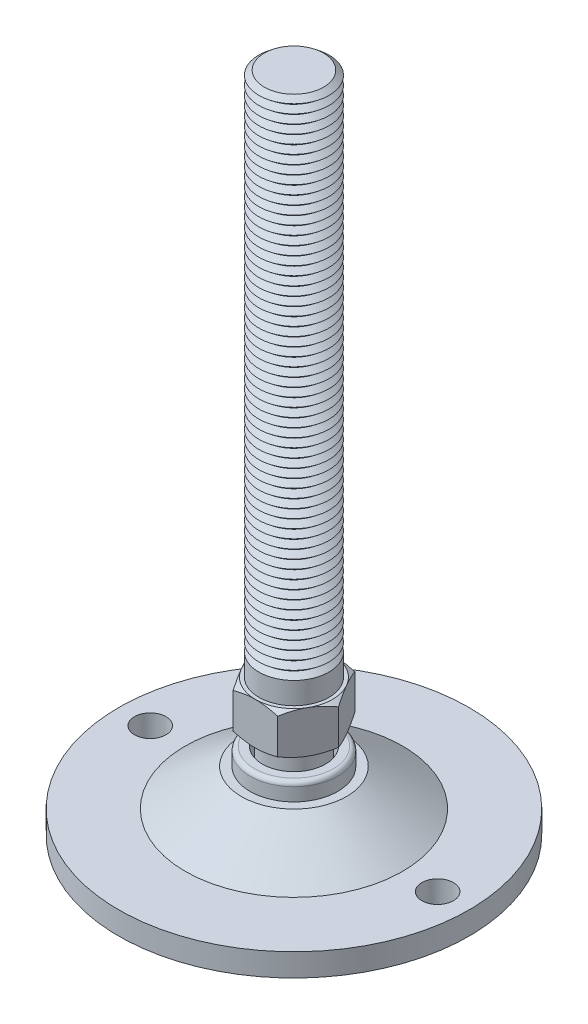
ISO-10303-21;
HEADER;
FILE_DESCRIPTION(('STEP AP214'),'2;1');
FILE_NAME('part.step','',(''),(''),'','','');
FILE_SCHEMA(('AUTOMOTIVE_DESIGN { 1 0 10303 214 1 1 1 1 }'));
ENDSEC;
DATA;
#1=APPLICATION_CONTEXT('core data for automotive mechanical design processes');
#2=APPLICATION_PROTOCOL_DEFINITION('international standard','automotive_design',2000,#1);
#3=PRODUCT_CONTEXT('',#1,'mechanical');
#4=PRODUCT('Part','Part','',(#3));
#5=PRODUCT_RELATED_PRODUCT_CATEGORY('part','',(#4));
#6=PRODUCT_DEFINITION_FORMATION('','',#4);
#7=PRODUCT_DEFINITION_CONTEXT('part definition',#1,'design');
#8=PRODUCT_DEFINITION('design','',#6,#7);
#9=PRODUCT_DEFINITION_SHAPE('','',#8);
#10=(LENGTH_UNIT() NAMED_UNIT(*) SI_UNIT(.MILLI.,.METRE.));
#11=(NAMED_UNIT(*) PLANE_ANGLE_UNIT() SI_UNIT($,.RADIAN.));
#12=(NAMED_UNIT(*) SI_UNIT($,.STERADIAN.) SOLID_ANGLE_UNIT());
#13=UNCERTAINTY_MEASURE_WITH_UNIT(LENGTH_MEASURE(1.E-05),#10,'distance_accuracy_value','');
#14=(GEOMETRIC_REPRESENTATION_CONTEXT(3) GLOBAL_UNCERTAINTY_ASSIGNED_CONTEXT((#13)) GLOBAL_UNIT_ASSIGNED_CONTEXT((#10,
#11,#12)) REPRESENTATION_CONTEXT('',''));
#15=CARTESIAN_POINT('',(0.,0.,0.));
#16=DIRECTION('',(0.,0.,1.));
#17=DIRECTION('',(1.,0.,0.));
#18=AXIS2_PLACEMENT_3D('',#15,#16,#17);
#19=CARTESIAN_POINT('',(0.,179.,0.));
#20=DIRECTION('',(0.,-1.,0.));
#21=DIRECTION('',(0.,0.,-1.));
#22=AXIS2_PLACEMENT_3D('',#19,#20,#21);
#23=CONICAL_SURFACE('',#22,8.4387505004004,0.895664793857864);
#24=CARTESIAN_POINT('',(0.,177.75,0.));
#25=DIRECTION('',(0.,-1.,0.));
#26=DIRECTION('',(0.,0.,-1.));
#27=AXIS2_PLACEMENT_3D('',#24,#25,#26);
#28=CIRCLE('',#27,10.);
#29=CARTESIAN_POINT('',(0.,177.75,-10.));
#30=VERTEX_POINT('',#29);
#31=EDGE_CURVE('P0_E1976',#30,#30,#28,.T.);
#32=ORIENTED_EDGE('',*,*,#31,.F.);
#33=EDGE_LOOP('',(#32));
#34=FACE_BOUND('',#33,.T.);
#35=CARTESIAN_POINT('',(0.,179.,0.));
#36=DIRECTION('',(0.,-1.,0.));
#37=DIRECTION('',(0.,0.,-1.));
#38=AXIS2_PLACEMENT_3D('',#35,#36,#37);
#39=CIRCLE('',#38,8.4387505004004);
#40=CARTESIAN_POINT('',(0.,179.,-8.4387505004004));
#41=VERTEX_POINT('',#40);
#42=EDGE_CURVE('P0_E1985',#41,#41,#39,.T.);
#43=ORIENTED_EDGE('',*,*,#42,.T.);
#44=EDGE_LOOP('',(#43));
#45=FACE_BOUND('',#44,.T.);
#46=ADVANCED_FACE('P0_F16',(#34,#45),#23,.T.);
#47=CARTESIAN_POINT('',(0.,180.25,0.));
#48=DIRECTION('',(0.,1.,0.));
#49=DIRECTION('',(0.,0.,1.));
#50=AXIS2_PLACEMENT_3D('',#47,#48,#49);
#51=CONICAL_SURFACE('',#50,10.,0.895664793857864);
#52=ORIENTED_EDGE('',*,*,#42,.F.);
#53=EDGE_LOOP('',(#52));
#54=FACE_BOUND('',#53,.T.);
#55=CARTESIAN_POINT('',(0.,180.25,0.));
#56=DIRECTION('',(0.,-1.,0.));
#57=DIRECTION('',(0.,0.,-1.));
#58=AXIS2_PLACEMENT_3D('',#55,#56,#57);
#59=CIRCLE('',#58,10.);
#60=CARTESIAN_POINT('',(0.,180.25,-10.));
#61=VERTEX_POINT('',#60);
#62=EDGE_CURVE('P0_E1982',#61,#61,#59,.T.);
#63=ORIENTED_EDGE('',*,*,#62,.T.);
#64=EDGE_LOOP('',(#63));
#65=FACE_BOUND('',#64,.T.);
#66=ADVANCED_FACE('P0_F308',(#54,#65),#51,.T.);
#67=CARTESIAN_POINT('',(0.,189.,0.));
#68=DIRECTION('',(0.,1.,0.));
#69=DIRECTION('',(0.,0.,1.));
#70=AXIS2_PLACEMENT_3D('',#67,#68,#69);
#71=PLANE('',#70);
#72=CARTESIAN_POINT('',(0.,189.,0.));
#73=DIRECTION('',(0.,-1.,0.));
#74=DIRECTION('',(0.,0.,-1.));
#75=AXIS2_PLACEMENT_3D('',#72,#73,#74);
#76=CIRCLE('',#75,8.4387505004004);
#77=CARTESIAN_POINT('',(0.,189.,-8.4387505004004));
#78=VERTEX_POINT('',#77);
#79=EDGE_CURVE('P0_E143',#78,#78,#76,.T.);
#80=ORIENTED_EDGE('',*,*,#79,.F.);
#81=EDGE_LOOP('',(#80));
#82=FACE_BOUND('',#81,.T.);
#83=ADVANCED_FACE('P0_F314',(#82),#71,.T.);
#84=CARTESIAN_POINT('',(0.,189.,0.));
#85=DIRECTION('',(0.,-1.,0.));
#86=DIRECTION('',(0.,0.,-1.));
#87=AXIS2_PLACEMENT_3D('',#84,#85,#86);
#88=CONICAL_SURFACE('',#87,8.4387505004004,0.895664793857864);
#89=CARTESIAN_POINT('',(0.,187.75,0.));
#90=DIRECTION('',(0.,-1.,0.));
#91=DIRECTION('',(0.,0.,-1.));
#92=AXIS2_PLACEMENT_3D('',#89,#90,#91);
#93=CIRCLE('',#92,10.);
#94=CARTESIAN_POINT('',(0.,187.75,-10.));
#95=VERTEX_POINT('',#94);
#96=EDGE_CURVE('P0_E353',#95,#95,#93,.T.);
#97=ORIENTED_EDGE('',*,*,#96,.F.);
#98=EDGE_LOOP('',(#97));
#99=FACE_BOUND('',#98,.T.);
#100=ORIENTED_EDGE('',*,*,#79,.T.);
#101=EDGE_LOOP('',(#100));
#102=FACE_BOUND('',#101,.T.);
#103=ADVANCED_FACE('P0_F211',(#99,#102),#88,.T.);
#104=CARTESIAN_POINT('',(0.,187.75,0.));
#105=DIRECTION('',(0.,1.,0.));
#106=DIRECTION('',(0.,0.,1.));
#107=AXIS2_PLACEMENT_3D('',#104,#105,#106);
#108=CONICAL_SURFACE('',#107,10.,0.895664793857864);
#109=CARTESIAN_POINT('',(0.,186.5,0.));
#110=DIRECTION('',(0.,-1.,0.));
#111=DIRECTION('',(0.,0.,-1.));
#112=AXIS2_PLACEMENT_3D('',#109,#110,#111);
#113=CIRCLE('',#112,8.4387505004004);
#114=CARTESIAN_POINT('',(0.,186.5,-8.4387505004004));
#115=VERTEX_POINT('',#114);
#116=EDGE_CURVE('P0_E352',#115,#115,#113,.T.);
#117=ORIENTED_EDGE('',*,*,#116,.F.);
#118=EDGE_LOOP('',(#117));
#119=FACE_BOUND('',#118,.T.);
#120=ORIENTED_EDGE('',*,*,#96,.T.);
#121=EDGE_LOOP('',(#120));
#122=FACE_BOUND('',#121,.T.);
#123=ADVANCED_FACE('P0_F339',(#119,#122),#108,.T.);
#124=CARTESIAN_POINT('',(0.,186.5,0.));
#125=DIRECTION('',(0.,-1.,0.));
#126=DIRECTION('',(0.,0.,-1.));
#127=AXIS2_PLACEMENT_3D('',#124,#125,#126);
#128=CONICAL_SURFACE('',#127,8.4387505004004,0.895664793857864);
#129=CARTESIAN_POINT('',(0.,185.25,0.));
#130=DIRECTION('',(0.,-1.,0.));
#131=DIRECTION('',(0.,0.,-1.));
#132=AXIS2_PLACEMENT_3D('',#129,#130,#131);
#133=CIRCLE('',#132,10.);
#134=CARTESIAN_POINT('',(0.,185.25,-10.));
#135=VERTEX_POINT('',#134);
#136=EDGE_CURVE('P0_E349',#135,#135,#133,.T.);
#137=ORIENTED_EDGE('',*,*,#136,.F.);
#138=EDGE_LOOP('',(#137));
#139=FACE_BOUND('',#138,.T.);
#140=ORIENTED_EDGE('',*,*,#116,.T.);
#141=EDGE_LOOP('',(#140));
#142=FACE_BOUND('',#141,.T.);
#143=ADVANCED_FACE('P0_F334',(#139,#142),#128,.T.);
#144=CARTESIAN_POINT('',(0.,185.25,0.));
#145=DIRECTION('',(0.,1.,0.));
#146=DIRECTION('',(0.,0.,1.));
#147=AXIS2_PLACEMENT_3D('',#144,#145,#146);
#148=CONICAL_SURFACE('',#147,10.,0.895664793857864);
#149=CARTESIAN_POINT('',(0.,184.,0.));
#150=DIRECTION('',(0.,-1.,0.));
#151=DIRECTION('',(0.,0.,-1.));
#152=AXIS2_PLACEMENT_3D('',#149,#150,#151);
#153=CIRCLE('',#152,8.4387505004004);
#154=CARTESIAN_POINT('',(0.,184.,-8.4387505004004));
#155=VERTEX_POINT('',#154);
#156=EDGE_CURVE('P0_E358',#155,#155,#153,.T.);
#157=ORIENTED_EDGE('',*,*,#156,.F.);
#158=EDGE_LOOP('',(#157));
#159=FACE_BOUND('',#158,.T.);
#160=ORIENTED_EDGE('',*,*,#136,.T.);
#161=EDGE_LOOP('',(#160));
#162=FACE_BOUND('',#161,.T.);
#163=ADVANCED_FACE('P0_F331',(#159,#162),#148,.T.);
#164=CARTESIAN_POINT('',(0.,184.,0.));
#165=DIRECTION('',(0.,-1.,0.));
#166=DIRECTION('',(0.,0.,-1.));
#167=AXIS2_PLACEMENT_3D('',#164,#165,#166);
#168=CONICAL_SURFACE('',#167,8.4387505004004,0.895664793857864);
#169=CARTESIAN_POINT('',(0.,182.75,0.));
#170=DIRECTION('',(0.,-1.,0.));
#171=DIRECTION('',(0.,0.,-1.));
#172=AXIS2_PLACEMENT_3D('',#169,#170,#171);
#173=CIRCLE('',#172,10.);
#174=CARTESIAN_POINT('',(0.,182.75,-10.));
#175=VERTEX_POINT('',#174);
#176=EDGE_CURVE('P0_E1988',#175,#175,#173,.T.);
#177=ORIENTED_EDGE('',*,*,#176,.F.);
#178=EDGE_LOOP('',(#177));
#179=FACE_BOUND('',#178,.T.);
#180=ORIENTED_EDGE('',*,*,#156,.T.);
#181=EDGE_LOOP('',(#180));
#182=FACE_BOUND('',#181,.T.);
#183=ADVANCED_FACE('P0_F325',(#179,#182),#168,.T.);
#184=CARTESIAN_POINT('',(0.,182.75,0.));
#185=DIRECTION('',(0.,1.,0.));
#186=DIRECTION('',(0.,0.,1.));
#187=AXIS2_PLACEMENT_3D('',#184,#185,#186);
#188=CONICAL_SURFACE('',#187,10.,0.895664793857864);
#189=CARTESIAN_POINT('',(0.,181.5,0.));
#190=DIRECTION('',(0.,-1.,0.));
#191=DIRECTION('',(0.,0.,-1.));
#192=AXIS2_PLACEMENT_3D('',#189,#190,#191);
#193=CIRCLE('',#192,8.4387505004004);
#194=CARTESIAN_POINT('',(0.,181.5,-8.4387505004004));
#195=VERTEX_POINT('',#194);
#196=EDGE_CURVE('P0_E1991',#195,#195,#193,.T.);
#197=ORIENTED_EDGE('',*,*,#196,.F.);
#198=EDGE_LOOP('',(#197));
#199=FACE_BOUND('',#198,.T.);
#200=ORIENTED_EDGE('',*,*,#176,.T.);
#201=EDGE_LOOP('',(#200));
#202=FACE_BOUND('',#201,.T.);
#203=ADVANCED_FACE('P0_F321',(#199,#202),#188,.T.);
#204=CARTESIAN_POINT('',(0.,181.5,0.));
#205=DIRECTION('',(0.,-1.,0.));
#206=DIRECTION('',(0.,0.,-1.));
#207=AXIS2_PLACEMENT_3D('',#204,#205,#206);
#208=CONICAL_SURFACE('',#207,8.4387505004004,0.895664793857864);
#209=ORIENTED_EDGE('',*,*,#62,.F.);
#210=EDGE_LOOP('',(#209));
#211=FACE_BOUND('',#210,.T.);
#212=ORIENTED_EDGE('',*,*,#196,.T.);
#213=EDGE_LOOP('',(#212));
#214=FACE_BOUND('',#213,.T.);
#215=ADVANCED_FACE('P0_F324',(#211,#214),#208,.T.);
#216=CARTESIAN_POINT('',(0.,176.5,0.));
#217=DIRECTION('',(0.,-1.,0.));
#218=DIRECTION('',(0.,0.,-1.));
#219=AXIS2_PLACEMENT_3D('',#216,#217,#218);
#220=CONICAL_SURFACE('',#219,8.4387505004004,0.895664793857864);
#221=CARTESIAN_POINT('',(0.,175.25,0.));
#222=DIRECTION('',(0.,-1.,0.));
#223=DIRECTION('',(0.,0.,-1.));
#224=AXIS2_PLACEMENT_3D('',#221,#222,#223);
#225=CIRCLE('',#224,10.);
#226=CARTESIAN_POINT('',(0.,175.25,-10.));
#227=VERTEX_POINT('',#226);
#228=EDGE_CURVE('P0_E1970',#227,#227,#225,.T.);
#229=ORIENTED_EDGE('',*,*,#228,.F.);
#230=EDGE_LOOP('',(#229));
#231=FACE_BOUND('',#230,.T.);
#232=CARTESIAN_POINT('',(0.,176.5,0.));
#233=DIRECTION('',(0.,-1.,0.));
#234=DIRECTION('',(0.,0.,-1.));
#235=AXIS2_PLACEMENT_3D('',#232,#233,#234);
#236=CIRCLE('',#235,8.4387505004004);
#237=CARTESIAN_POINT('',(0.,176.5,-8.4387505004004));
#238=VERTEX_POINT('',#237);
#239=EDGE_CURVE('P0_E1979',#238,#238,#236,.T.);
#240=ORIENTED_EDGE('',*,*,#239,.T.);
#241=EDGE_LOOP('',(#240));
#242=FACE_BOUND('',#241,.T.);
#243=ADVANCED_FACE('P0_F329',(#231,#242),#220,.T.);
#244=CARTESIAN_POINT('',(0.,177.75,0.));
#245=DIRECTION('',(0.,1.,0.));
#246=DIRECTION('',(0.,0.,1.));
#247=AXIS2_PLACEMENT_3D('',#244,#245,#246);
#248=CONICAL_SURFACE('',#247,10.,0.895664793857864);
#249=ORIENTED_EDGE('',*,*,#239,.F.);
#250=EDGE_LOOP('',(#249));
#251=FACE_BOUND('',#250,.T.);
#252=ORIENTED_EDGE('',*,*,#31,.T.);
#253=EDGE_LOOP('',(#252));
#254=FACE_BOUND('',#253,.T.);
#255=ADVANCED_FACE('P0_F1564',(#251,#254),#248,.T.);
#256=CARTESIAN_POINT('',(0.,174.,0.));
#257=DIRECTION('',(0.,-1.,0.));
#258=DIRECTION('',(0.,0.,-1.));
#259=AXIS2_PLACEMENT_3D('',#256,#257,#258);
#260=CONICAL_SURFACE('',#259,8.4387505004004,0.895664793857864);
#261=CARTESIAN_POINT('',(0.,172.75,0.));
#262=DIRECTION('',(0.,-1.,0.));
#263=DIRECTION('',(0.,0.,-1.));
#264=AXIS2_PLACEMENT_3D('',#261,#262,#263);
#265=CIRCLE('',#264,10.);
#266=CARTESIAN_POINT('',(0.,172.75,-10.));
#267=VERTEX_POINT('',#266);
#268=EDGE_CURVE('P0_E1964',#267,#267,#265,.T.);
#269=ORIENTED_EDGE('',*,*,#268,.F.);
#270=EDGE_LOOP('',(#269));
#271=FACE_BOUND('',#270,.T.);
#272=CARTESIAN_POINT('',(0.,174.,0.));
#273=DIRECTION('',(0.,-1.,0.));
#274=DIRECTION('',(0.,0.,-1.));
#275=AXIS2_PLACEMENT_3D('',#272,#273,#274);
#276=CIRCLE('',#275,8.4387505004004);
#277=CARTESIAN_POINT('',(0.,174.,-8.4387505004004));
#278=VERTEX_POINT('',#277);
#279=EDGE_CURVE('P0_E1973',#278,#278,#276,.T.);
#280=ORIENTED_EDGE('',*,*,#279,.T.);
#281=EDGE_LOOP('',(#280));
#282=FACE_BOUND('',#281,.T.);
#283=ADVANCED_FACE('P0_F1554',(#271,#282),#260,.T.);
#284=CARTESIAN_POINT('',(0.,175.25,0.));
#285=DIRECTION('',(0.,1.,0.));
#286=DIRECTION('',(0.,0.,1.));
#287=AXIS2_PLACEMENT_3D('',#284,#285,#286);
#288=CONICAL_SURFACE('',#287,10.,0.895664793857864);
#289=ORIENTED_EDGE('',*,*,#279,.F.);
#290=EDGE_LOOP('',(#289));
#291=FACE_BOUND('',#290,.T.);
#292=ORIENTED_EDGE('',*,*,#228,.T.);
#293=EDGE_LOOP('',(#292));
#294=FACE_BOUND('',#293,.T.);
#295=ADVANCED_FACE('P0_F1544',(#291,#294),#288,.T.);
#296=CARTESIAN_POINT('',(0.,171.5,0.));
#297=DIRECTION('',(0.,-1.,0.));
#298=DIRECTION('',(0.,0.,-1.));
#299=AXIS2_PLACEMENT_3D('',#296,#297,#298);
#300=CONICAL_SURFACE('',#299,8.4387505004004,0.895664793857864);
#301=CARTESIAN_POINT('',(0.,170.25,0.));
#302=DIRECTION('',(0.,-1.,0.));
#303=DIRECTION('',(0.,0.,-1.));
#304=AXIS2_PLACEMENT_3D('',#301,#302,#303);
#305=CIRCLE('',#304,10.);
#306=CARTESIAN_POINT('',(0.,170.25,-10.));
#307=VERTEX_POINT('',#306);
#308=EDGE_CURVE('P0_E1958',#307,#307,#305,.T.);
#309=ORIENTED_EDGE('',*,*,#308,.F.);
#310=EDGE_LOOP('',(#309));
#311=FACE_BOUND('',#310,.T.);
#312=CARTESIAN_POINT('',(0.,171.5,0.));
#313=DIRECTION('',(0.,-1.,0.));
#314=DIRECTION('',(0.,0.,-1.));
#315=AXIS2_PLACEMENT_3D('',#312,#313,#314);
#316=CIRCLE('',#315,8.4387505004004);
#317=CARTESIAN_POINT('',(0.,171.5,-8.4387505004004));
#318=VERTEX_POINT('',#317);
#319=EDGE_CURVE('P0_E1967',#318,#318,#316,.T.);
#320=ORIENTED_EDGE('',*,*,#319,.T.);
#321=EDGE_LOOP('',(#320));
#322=FACE_BOUND('',#321,.T.);
#323=ADVANCED_FACE('P0_F1534',(#311,#322),#300,.T.);
#324=CARTESIAN_POINT('',(0.,172.75,0.));
#325=DIRECTION('',(0.,1.,0.));
#326=DIRECTION('',(0.,0.,1.));
#327=AXIS2_PLACEMENT_3D('',#324,#325,#326);
#328=CONICAL_SURFACE('',#327,10.,0.895664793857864);
#329=ORIENTED_EDGE('',*,*,#319,.F.);
#330=EDGE_LOOP('',(#329));
#331=FACE_BOUND('',#330,.T.);
#332=ORIENTED_EDGE('',*,*,#268,.T.);
#333=EDGE_LOOP('',(#332));
#334=FACE_BOUND('',#333,.T.);
#335=ADVANCED_FACE('P0_F1524',(#331,#334),#328,.T.);
#336=CARTESIAN_POINT('',(0.,169.,0.));
#337=DIRECTION('',(0.,-1.,0.));
#338=DIRECTION('',(0.,0.,-1.));
#339=AXIS2_PLACEMENT_3D('',#336,#337,#338);
#340=CONICAL_SURFACE('',#339,8.4387505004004,0.895664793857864);
#341=CARTESIAN_POINT('',(0.,167.75,0.));
#342=DIRECTION('',(0.,-1.,0.));
#343=DIRECTION('',(0.,0.,-1.));
#344=AXIS2_PLACEMENT_3D('',#341,#342,#343);
#345=CIRCLE('',#344,10.);
#346=CARTESIAN_POINT('',(0.,167.75,-10.));
#347=VERTEX_POINT('',#346);
#348=EDGE_CURVE('P0_E1952',#347,#347,#345,.T.);
#349=ORIENTED_EDGE('',*,*,#348,.F.);
#350=EDGE_LOOP('',(#349));
#351=FACE_BOUND('',#350,.T.);
#352=CARTESIAN_POINT('',(0.,169.,0.));
#353=DIRECTION('',(0.,-1.,0.));
#354=DIRECTION('',(0.,0.,-1.));
#355=AXIS2_PLACEMENT_3D('',#352,#353,#354);
#356=CIRCLE('',#355,8.4387505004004);
#357=CARTESIAN_POINT('',(0.,169.,-8.4387505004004));
#358=VERTEX_POINT('',#357);
#359=EDGE_CURVE('P0_E1961',#358,#358,#356,.T.);
#360=ORIENTED_EDGE('',*,*,#359,.T.);
#361=EDGE_LOOP('',(#360));
#362=FACE_BOUND('',#361,.T.);
#363=ADVANCED_FACE('P0_F1514',(#351,#362),#340,.T.);
#364=CARTESIAN_POINT('',(0.,170.25,0.));
#365=DIRECTION('',(0.,1.,0.));
#366=DIRECTION('',(0.,0.,1.));
#367=AXIS2_PLACEMENT_3D('',#364,#365,#366);
#368=CONICAL_SURFACE('',#367,10.,0.895664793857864);
#369=ORIENTED_EDGE('',*,*,#359,.F.);
#370=EDGE_LOOP('',(#369));
#371=FACE_BOUND('',#370,.T.);
#372=ORIENTED_EDGE('',*,*,#308,.T.);
#373=EDGE_LOOP('',(#372));
#374=FACE_BOUND('',#373,.T.);
#375=ADVANCED_FACE('P0_F1504',(#371,#374),#368,.T.);
#376=CARTESIAN_POINT('',(0.,166.5,0.));
#377=DIRECTION('',(0.,-1.,0.));
#378=DIRECTION('',(0.,0.,-1.));
#379=AXIS2_PLACEMENT_3D('',#376,#377,#378);
#380=CONICAL_SURFACE('',#379,8.4387505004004,0.895664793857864);
#381=CARTESIAN_POINT('',(0.,165.25,0.));
#382=DIRECTION('',(0.,-1.,0.));
#383=DIRECTION('',(0.,0.,-1.));
#384=AXIS2_PLACEMENT_3D('',#381,#382,#383);
#385=CIRCLE('',#384,10.);
#386=CARTESIAN_POINT('',(0.,165.25,-10.));
#387=VERTEX_POINT('',#386);
#388=EDGE_CURVE('P0_E1946',#387,#387,#385,.T.);
#389=ORIENTED_EDGE('',*,*,#388,.F.);
#390=EDGE_LOOP('',(#389));
#391=FACE_BOUND('',#390,.T.);
#392=CARTESIAN_POINT('',(0.,166.5,0.));
#393=DIRECTION('',(0.,-1.,0.));
#394=DIRECTION('',(0.,0.,-1.));
#395=AXIS2_PLACEMENT_3D('',#392,#393,#394);
#396=CIRCLE('',#395,8.4387505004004);
#397=CARTESIAN_POINT('',(0.,166.5,-8.4387505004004));
#398=VERTEX_POINT('',#397);
#399=EDGE_CURVE('P0_E1955',#398,#398,#396,.T.);
#400=ORIENTED_EDGE('',*,*,#399,.T.);
#401=EDGE_LOOP('',(#400));
#402=FACE_BOUND('',#401,.T.);
#403=ADVANCED_FACE('P0_F1494',(#391,#402),#380,.T.);
#404=CARTESIAN_POINT('',(0.,167.75,0.));
#405=DIRECTION('',(0.,1.,0.));
#406=DIRECTION('',(0.,0.,1.));
#407=AXIS2_PLACEMENT_3D('',#404,#405,#406);
#408=CONICAL_SURFACE('',#407,10.,0.895664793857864);
#409=ORIENTED_EDGE('',*,*,#399,.F.);
#410=EDGE_LOOP('',(#409));
#411=FACE_BOUND('',#410,.T.);
#412=ORIENTED_EDGE('',*,*,#348,.T.);
#413=EDGE_LOOP('',(#412));
#414=FACE_BOUND('',#413,.T.);
#415=ADVANCED_FACE('P0_F1484',(#411,#414),#408,.T.);
#416=CARTESIAN_POINT('',(0.,164.,0.));
#417=DIRECTION('',(0.,-1.,0.));
#418=DIRECTION('',(0.,0.,-1.));
#419=AXIS2_PLACEMENT_3D('',#416,#417,#418);
#420=CONICAL_SURFACE('',#419,8.4387505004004,0.895664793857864);
#421=CARTESIAN_POINT('',(0.,162.75,0.));
#422=DIRECTION('',(0.,-1.,0.));
#423=DIRECTION('',(0.,0.,-1.));
#424=AXIS2_PLACEMENT_3D('',#421,#422,#423);
#425=CIRCLE('',#424,10.);
#426=CARTESIAN_POINT('',(0.,162.75,-10.));
#427=VERTEX_POINT('',#426);
#428=EDGE_CURVE('P0_E1940',#427,#427,#425,.T.);
#429=ORIENTED_EDGE('',*,*,#428,.F.);
#430=EDGE_LOOP('',(#429));
#431=FACE_BOUND('',#430,.T.);
#432=CARTESIAN_POINT('',(0.,164.,0.));
#433=DIRECTION('',(0.,-1.,0.));
#434=DIRECTION('',(0.,0.,-1.));
#435=AXIS2_PLACEMENT_3D('',#432,#433,#434);
#436=CIRCLE('',#435,8.4387505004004);
#437=CARTESIAN_POINT('',(0.,164.,-8.4387505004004));
#438=VERTEX_POINT('',#437);
#439=EDGE_CURVE('P0_E1949',#438,#438,#436,.T.);
#440=ORIENTED_EDGE('',*,*,#439,.T.);
#441=EDGE_LOOP('',(#440));
#442=FACE_BOUND('',#441,.T.);
#443=ADVANCED_FACE('P0_F1474',(#431,#442),#420,.T.);
#444=CARTESIAN_POINT('',(0.,165.25,0.));
#445=DIRECTION('',(0.,1.,0.));
#446=DIRECTION('',(0.,0.,1.));
#447=AXIS2_PLACEMENT_3D('',#444,#445,#446);
#448=CONICAL_SURFACE('',#447,10.,0.895664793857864);
#449=ORIENTED_EDGE('',*,*,#439,.F.);
#450=EDGE_LOOP('',(#449));
#451=FACE_BOUND('',#450,.T.);
#452=ORIENTED_EDGE('',*,*,#388,.T.);
#453=EDGE_LOOP('',(#452));
#454=FACE_BOUND('',#453,.T.);
#455=ADVANCED_FACE('P0_F1464',(#451,#454),#448,.T.);
#456=CARTESIAN_POINT('',(0.,161.5,0.));
#457=DIRECTION('',(0.,-1.,0.));
#458=DIRECTION('',(0.,0.,-1.));
#459=AXIS2_PLACEMENT_3D('',#456,#457,#458);
#460=CONICAL_SURFACE('',#459,8.4387505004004,0.895664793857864);
#461=CARTESIAN_POINT('',(0.,160.25,0.));
#462=DIRECTION('',(0.,-1.,0.));
#463=DIRECTION('',(0.,0.,-1.));
#464=AXIS2_PLACEMENT_3D('',#461,#462,#463);
#465=CIRCLE('',#464,10.);
#466=CARTESIAN_POINT('',(0.,160.25,-10.));
#467=VERTEX_POINT('',#466);
#468=EDGE_CURVE('P0_E1934',#467,#467,#465,.T.);
#469=ORIENTED_EDGE('',*,*,#468,.F.);
#470=EDGE_LOOP('',(#469));
#471=FACE_BOUND('',#470,.T.);
#472=CARTESIAN_POINT('',(0.,161.5,0.));
#473=DIRECTION('',(0.,-1.,0.));
#474=DIRECTION('',(0.,0.,-1.));
#475=AXIS2_PLACEMENT_3D('',#472,#473,#474);
#476=CIRCLE('',#475,8.4387505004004);
#477=CARTESIAN_POINT('',(0.,161.5,-8.4387505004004));
#478=VERTEX_POINT('',#477);
#479=EDGE_CURVE('P0_E1943',#478,#478,#476,.T.);
#480=ORIENTED_EDGE('',*,*,#479,.T.);
#481=EDGE_LOOP('',(#480));
#482=FACE_BOUND('',#481,.T.);
#483=ADVANCED_FACE('P0_F1454',(#471,#482),#460,.T.);
#484=CARTESIAN_POINT('',(0.,162.75,0.));
#485=DIRECTION('',(0.,1.,0.));
#486=DIRECTION('',(0.,0.,1.));
#487=AXIS2_PLACEMENT_3D('',#484,#485,#486);
#488=CONICAL_SURFACE('',#487,10.,0.895664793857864);
#489=ORIENTED_EDGE('',*,*,#479,.F.);
#490=EDGE_LOOP('',(#489));
#491=FACE_BOUND('',#490,.T.);
#492=ORIENTED_EDGE('',*,*,#428,.T.);
#493=EDGE_LOOP('',(#492));
#494=FACE_BOUND('',#493,.T.);
#495=ADVANCED_FACE('P0_F1444',(#491,#494),#488,.T.);
#496=CARTESIAN_POINT('',(0.,159.,0.));
#497=DIRECTION('',(0.,-1.,0.));
#498=DIRECTION('',(0.,0.,-1.));
#499=AXIS2_PLACEMENT_3D('',#496,#497,#498);
#500=CONICAL_SURFACE('',#499,8.4387505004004,0.895664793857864);
#501=CARTESIAN_POINT('',(0.,157.75,0.));
#502=DIRECTION('',(0.,-1.,0.));
#503=DIRECTION('',(0.,0.,-1.));
#504=AXIS2_PLACEMENT_3D('',#501,#502,#503);
#505=CIRCLE('',#504,10.);
#506=CARTESIAN_POINT('',(0.,157.75,-10.));
#507=VERTEX_POINT('',#506);
#508=EDGE_CURVE('P0_E1928',#507,#507,#505,.T.);
#509=ORIENTED_EDGE('',*,*,#508,.F.);
#510=EDGE_LOOP('',(#509));
#511=FACE_BOUND('',#510,.T.);
#512=CARTESIAN_POINT('',(0.,159.,0.));
#513=DIRECTION('',(0.,-1.,0.));
#514=DIRECTION('',(0.,0.,-1.));
#515=AXIS2_PLACEMENT_3D('',#512,#513,#514);
#516=CIRCLE('',#515,8.4387505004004);
#517=CARTESIAN_POINT('',(0.,159.,-8.4387505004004));
#518=VERTEX_POINT('',#517);
#519=EDGE_CURVE('P0_E1937',#518,#518,#516,.T.);
#520=ORIENTED_EDGE('',*,*,#519,.T.);
#521=EDGE_LOOP('',(#520));
#522=FACE_BOUND('',#521,.T.);
#523=ADVANCED_FACE('P0_F1434',(#511,#522),#500,.T.);
#524=CARTESIAN_POINT('',(0.,160.25,0.));
#525=DIRECTION('',(0.,1.,0.));
#526=DIRECTION('',(0.,0.,1.));
#527=AXIS2_PLACEMENT_3D('',#524,#525,#526);
#528=CONICAL_SURFACE('',#527,10.,0.895664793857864);
#529=ORIENTED_EDGE('',*,*,#519,.F.);
#530=EDGE_LOOP('',(#529));
#531=FACE_BOUND('',#530,.T.);
#532=ORIENTED_EDGE('',*,*,#468,.T.);
#533=EDGE_LOOP('',(#532));
#534=FACE_BOUND('',#533,.T.);
#535=ADVANCED_FACE('P0_F1424',(#531,#534),#528,.T.);
#536=CARTESIAN_POINT('',(0.,156.5,0.));
#537=DIRECTION('',(0.,-1.,0.));
#538=DIRECTION('',(0.,0.,-1.));
#539=AXIS2_PLACEMENT_3D('',#536,#537,#538);
#540=CONICAL_SURFACE('',#539,8.4387505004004,0.895664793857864);
#541=CARTESIAN_POINT('',(0.,155.25,0.));
#542=DIRECTION('',(0.,-1.,0.));
#543=DIRECTION('',(0.,0.,-1.));
#544=AXIS2_PLACEMENT_3D('',#541,#542,#543);
#545=CIRCLE('',#544,10.);
#546=CARTESIAN_POINT('',(0.,155.25,-10.));
#547=VERTEX_POINT('',#546);
#548=EDGE_CURVE('P0_E1922',#547,#547,#545,.T.);
#549=ORIENTED_EDGE('',*,*,#548,.F.);
#550=EDGE_LOOP('',(#549));
#551=FACE_BOUND('',#550,.T.);
#552=CARTESIAN_POINT('',(0.,156.5,0.));
#553=DIRECTION('',(0.,-1.,0.));
#554=DIRECTION('',(0.,0.,-1.));
#555=AXIS2_PLACEMENT_3D('',#552,#553,#554);
#556=CIRCLE('',#555,8.4387505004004);
#557=CARTESIAN_POINT('',(0.,156.5,-8.4387505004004));
#558=VERTEX_POINT('',#557);
#559=EDGE_CURVE('P0_E1931',#558,#558,#556,.T.);
#560=ORIENTED_EDGE('',*,*,#559,.T.);
#561=EDGE_LOOP('',(#560));
#562=FACE_BOUND('',#561,.T.);
#563=ADVANCED_FACE('P0_F1414',(#551,#562),#540,.T.);
#564=CARTESIAN_POINT('',(0.,157.75,0.));
#565=DIRECTION('',(0.,1.,0.));
#566=DIRECTION('',(0.,0.,1.));
#567=AXIS2_PLACEMENT_3D('',#564,#565,#566);
#568=CONICAL_SURFACE('',#567,10.,0.895664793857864);
#569=ORIENTED_EDGE('',*,*,#559,.F.);
#570=EDGE_LOOP('',(#569));
#571=FACE_BOUND('',#570,.T.);
#572=ORIENTED_EDGE('',*,*,#508,.T.);
#573=EDGE_LOOP('',(#572));
#574=FACE_BOUND('',#573,.T.);
#575=ADVANCED_FACE('P0_F1404',(#571,#574),#568,.T.);
#576=CARTESIAN_POINT('',(0.,154.,0.));
#577=DIRECTION('',(0.,-1.,0.));
#578=DIRECTION('',(0.,0.,-1.));
#579=AXIS2_PLACEMENT_3D('',#576,#577,#578);
#580=CONICAL_SURFACE('',#579,8.4387505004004,0.895664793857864);
#581=CARTESIAN_POINT('',(0.,152.75,0.));
#582=DIRECTION('',(0.,-1.,0.));
#583=DIRECTION('',(0.,0.,-1.));
#584=AXIS2_PLACEMENT_3D('',#581,#582,#583);
#585=CIRCLE('',#584,10.);
#586=CARTESIAN_POINT('',(0.,152.75,-10.));
#587=VERTEX_POINT('',#586);
#588=EDGE_CURVE('P0_E1916',#587,#587,#585,.T.);
#589=ORIENTED_EDGE('',*,*,#588,.F.);
#590=EDGE_LOOP('',(#589));
#591=FACE_BOUND('',#590,.T.);
#592=CARTESIAN_POINT('',(0.,154.,0.));
#593=DIRECTION('',(0.,-1.,0.));
#594=DIRECTION('',(0.,0.,-1.));
#595=AXIS2_PLACEMENT_3D('',#592,#593,#594);
#596=CIRCLE('',#595,8.4387505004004);
#597=CARTESIAN_POINT('',(0.,154.,-8.4387505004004));
#598=VERTEX_POINT('',#597);
#599=EDGE_CURVE('P0_E1925',#598,#598,#596,.T.);
#600=ORIENTED_EDGE('',*,*,#599,.T.);
#601=EDGE_LOOP('',(#600));
#602=FACE_BOUND('',#601,.T.);
#603=ADVANCED_FACE('P0_F1394',(#591,#602),#580,.T.);
#604=CARTESIAN_POINT('',(0.,155.25,0.));
#605=DIRECTION('',(0.,1.,0.));
#606=DIRECTION('',(0.,0.,1.));
#607=AXIS2_PLACEMENT_3D('',#604,#605,#606);
#608=CONICAL_SURFACE('',#607,10.,0.895664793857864);
#609=ORIENTED_EDGE('',*,*,#599,.F.);
#610=EDGE_LOOP('',(#609));
#611=FACE_BOUND('',#610,.T.);
#612=ORIENTED_EDGE('',*,*,#548,.T.);
#613=EDGE_LOOP('',(#612));
#614=FACE_BOUND('',#613,.T.);
#615=ADVANCED_FACE('P0_F1384',(#611,#614),#608,.T.);
#616=CARTESIAN_POINT('',(0.,151.5,0.));
#617=DIRECTION('',(0.,-1.,0.));
#618=DIRECTION('',(0.,0.,-1.));
#619=AXIS2_PLACEMENT_3D('',#616,#617,#618);
#620=CONICAL_SURFACE('',#619,8.4387505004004,0.895664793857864);
#621=CARTESIAN_POINT('',(0.,150.25,0.));
#622=DIRECTION('',(0.,-1.,0.));
#623=DIRECTION('',(0.,0.,-1.));
#624=AXIS2_PLACEMENT_3D('',#621,#622,#623);
#625=CIRCLE('',#624,10.);
#626=CARTESIAN_POINT('',(0.,150.25,-10.));
#627=VERTEX_POINT('',#626);
#628=EDGE_CURVE('P0_E1910',#627,#627,#625,.T.);
#629=ORIENTED_EDGE('',*,*,#628,.F.);
#630=EDGE_LOOP('',(#629));
#631=FACE_BOUND('',#630,.T.);
#632=CARTESIAN_POINT('',(0.,151.5,0.));
#633=DIRECTION('',(0.,-1.,0.));
#634=DIRECTION('',(0.,0.,-1.));
#635=AXIS2_PLACEMENT_3D('',#632,#633,#634);
#636=CIRCLE('',#635,8.4387505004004);
#637=CARTESIAN_POINT('',(0.,151.5,-8.4387505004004));
#638=VERTEX_POINT('',#637);
#639=EDGE_CURVE('P0_E1919',#638,#638,#636,.T.);
#640=ORIENTED_EDGE('',*,*,#639,.T.);
#641=EDGE_LOOP('',(#640));
#642=FACE_BOUND('',#641,.T.);
#643=ADVANCED_FACE('P0_F1374',(#631,#642),#620,.T.);
#644=CARTESIAN_POINT('',(0.,152.75,0.));
#645=DIRECTION('',(0.,1.,0.));
#646=DIRECTION('',(0.,0.,1.));
#647=AXIS2_PLACEMENT_3D('',#644,#645,#646);
#648=CONICAL_SURFACE('',#647,10.,0.895664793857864);
#649=ORIENTED_EDGE('',*,*,#639,.F.);
#650=EDGE_LOOP('',(#649));
#651=FACE_BOUND('',#650,.T.);
#652=ORIENTED_EDGE('',*,*,#588,.T.);
#653=EDGE_LOOP('',(#652));
#654=FACE_BOUND('',#653,.T.);
#655=ADVANCED_FACE('P0_F1364',(#651,#654),#648,.T.);
#656=CARTESIAN_POINT('',(0.,149.,0.));
#657=DIRECTION('',(0.,-1.,0.));
#658=DIRECTION('',(0.,0.,-1.));
#659=AXIS2_PLACEMENT_3D('',#656,#657,#658);
#660=CONICAL_SURFACE('',#659,8.4387505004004,0.895664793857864);
#661=CARTESIAN_POINT('',(0.,147.75,0.));
#662=DIRECTION('',(0.,-1.,0.));
#663=DIRECTION('',(0.,0.,-1.));
#664=AXIS2_PLACEMENT_3D('',#661,#662,#663);
#665=CIRCLE('',#664,10.);
#666=CARTESIAN_POINT('',(0.,147.75,-10.));
#667=VERTEX_POINT('',#666);
#668=EDGE_CURVE('P0_E1904',#667,#667,#665,.T.);
#669=ORIENTED_EDGE('',*,*,#668,.F.);
#670=EDGE_LOOP('',(#669));
#671=FACE_BOUND('',#670,.T.);
#672=CARTESIAN_POINT('',(0.,149.,0.));
#673=DIRECTION('',(0.,-1.,0.));
#674=DIRECTION('',(0.,0.,-1.));
#675=AXIS2_PLACEMENT_3D('',#672,#673,#674);
#676=CIRCLE('',#675,8.4387505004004);
#677=CARTESIAN_POINT('',(0.,149.,-8.4387505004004));
#678=VERTEX_POINT('',#677);
#679=EDGE_CURVE('P0_E1913',#678,#678,#676,.T.);
#680=ORIENTED_EDGE('',*,*,#679,.T.);
#681=EDGE_LOOP('',(#680));
#682=FACE_BOUND('',#681,.T.);
#683=ADVANCED_FACE('P0_F1354',(#671,#682),#660,.T.);
#684=CARTESIAN_POINT('',(0.,150.25,0.));
#685=DIRECTION('',(0.,1.,0.));
#686=DIRECTION('',(0.,0.,1.));
#687=AXIS2_PLACEMENT_3D('',#684,#685,#686);
#688=CONICAL_SURFACE('',#687,10.,0.895664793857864);
#689=ORIENTED_EDGE('',*,*,#679,.F.);
#690=EDGE_LOOP('',(#689));
#691=FACE_BOUND('',#690,.T.);
#692=ORIENTED_EDGE('',*,*,#628,.T.);
#693=EDGE_LOOP('',(#692));
#694=FACE_BOUND('',#693,.T.);
#695=ADVANCED_FACE('P0_F1344',(#691,#694),#688,.T.);
#696=CARTESIAN_POINT('',(0.,146.5,0.));
#697=DIRECTION('',(0.,-1.,0.));
#698=DIRECTION('',(0.,0.,-1.));
#699=AXIS2_PLACEMENT_3D('',#696,#697,#698);
#700=CONICAL_SURFACE('',#699,8.4387505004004,0.895664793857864);
#701=CARTESIAN_POINT('',(0.,145.25,0.));
#702=DIRECTION('',(0.,-1.,0.));
#703=DIRECTION('',(0.,0.,-1.));
#704=AXIS2_PLACEMENT_3D('',#701,#702,#703);
#705=CIRCLE('',#704,10.);
#706=CARTESIAN_POINT('',(0.,145.25,-10.));
#707=VERTEX_POINT('',#706);
#708=EDGE_CURVE('P0_E1898',#707,#707,#705,.T.);
#709=ORIENTED_EDGE('',*,*,#708,.F.);
#710=EDGE_LOOP('',(#709));
#711=FACE_BOUND('',#710,.T.);
#712=CARTESIAN_POINT('',(0.,146.5,0.));
#713=DIRECTION('',(0.,-1.,0.));
#714=DIRECTION('',(0.,0.,-1.));
#715=AXIS2_PLACEMENT_3D('',#712,#713,#714);
#716=CIRCLE('',#715,8.4387505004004);
#717=CARTESIAN_POINT('',(0.,146.5,-8.4387505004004));
#718=VERTEX_POINT('',#717);
#719=EDGE_CURVE('P0_E1907',#718,#718,#716,.T.);
#720=ORIENTED_EDGE('',*,*,#719,.T.);
#721=EDGE_LOOP('',(#720));
#722=FACE_BOUND('',#721,.T.);
#723=ADVANCED_FACE('P0_F1334',(#711,#722),#700,.T.);
#724=CARTESIAN_POINT('',(0.,147.75,0.));
#725=DIRECTION('',(0.,1.,0.));
#726=DIRECTION('',(0.,0.,1.));
#727=AXIS2_PLACEMENT_3D('',#724,#725,#726);
#728=CONICAL_SURFACE('',#727,10.,0.895664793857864);
#729=ORIENTED_EDGE('',*,*,#719,.F.);
#730=EDGE_LOOP('',(#729));
#731=FACE_BOUND('',#730,.T.);
#732=ORIENTED_EDGE('',*,*,#668,.T.);
#733=EDGE_LOOP('',(#732));
#734=FACE_BOUND('',#733,.T.);
#735=ADVANCED_FACE('P0_F1324',(#731,#734),#728,.T.);
#736=CARTESIAN_POINT('',(0.,144.,0.));
#737=DIRECTION('',(0.,-1.,0.));
#738=DIRECTION('',(0.,0.,-1.));
#739=AXIS2_PLACEMENT_3D('',#736,#737,#738);
#740=CONICAL_SURFACE('',#739,8.4387505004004,0.895664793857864);
#741=CARTESIAN_POINT('',(0.,142.75,0.));
#742=DIRECTION('',(0.,-1.,0.));
#743=DIRECTION('',(0.,0.,-1.));
#744=AXIS2_PLACEMENT_3D('',#741,#742,#743);
#745=CIRCLE('',#744,10.);
#746=CARTESIAN_POINT('',(0.,142.75,-10.));
#747=VERTEX_POINT('',#746);
#748=EDGE_CURVE('P0_E1892',#747,#747,#745,.T.);
#749=ORIENTED_EDGE('',*,*,#748,.F.);
#750=EDGE_LOOP('',(#749));
#751=FACE_BOUND('',#750,.T.);
#752=CARTESIAN_POINT('',(0.,144.,0.));
#753=DIRECTION('',(0.,-1.,0.));
#754=DIRECTION('',(0.,0.,-1.));
#755=AXIS2_PLACEMENT_3D('',#752,#753,#754);
#756=CIRCLE('',#755,8.4387505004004);
#757=CARTESIAN_POINT('',(0.,144.,-8.4387505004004));
#758=VERTEX_POINT('',#757);
#759=EDGE_CURVE('P0_E1901',#758,#758,#756,.T.);
#760=ORIENTED_EDGE('',*,*,#759,.T.);
#761=EDGE_LOOP('',(#760));
#762=FACE_BOUND('',#761,.T.);
#763=ADVANCED_FACE('P0_F1314',(#751,#762),#740,.T.);
#764=CARTESIAN_POINT('',(0.,145.25,0.));
#765=DIRECTION('',(0.,1.,0.));
#766=DIRECTION('',(0.,0.,1.));
#767=AXIS2_PLACEMENT_3D('',#764,#765,#766);
#768=CONICAL_SURFACE('',#767,10.,0.895664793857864);
#769=ORIENTED_EDGE('',*,*,#759,.F.);
#770=EDGE_LOOP('',(#769));
#771=FACE_BOUND('',#770,.T.);
#772=ORIENTED_EDGE('',*,*,#708,.T.);
#773=EDGE_LOOP('',(#772));
#774=FACE_BOUND('',#773,.T.);
#775=ADVANCED_FACE('P0_F1304',(#771,#774),#768,.T.);
#776=CARTESIAN_POINT('',(0.,141.5,0.));
#777=DIRECTION('',(0.,-1.,0.));
#778=DIRECTION('',(0.,0.,-1.));
#779=AXIS2_PLACEMENT_3D('',#776,#777,#778);
#780=CONICAL_SURFACE('',#779,8.4387505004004,0.895664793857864);
#781=CARTESIAN_POINT('',(0.,140.25,0.));
#782=DIRECTION('',(0.,-1.,0.));
#783=DIRECTION('',(0.,0.,-1.));
#784=AXIS2_PLACEMENT_3D('',#781,#782,#783);
#785=CIRCLE('',#784,10.);
#786=CARTESIAN_POINT('',(0.,140.25,-10.));
#787=VERTEX_POINT('',#786);
#788=EDGE_CURVE('P0_E1886',#787,#787,#785,.T.);
#789=ORIENTED_EDGE('',*,*,#788,.F.);
#790=EDGE_LOOP('',(#789));
#791=FACE_BOUND('',#790,.T.);
#792=CARTESIAN_POINT('',(0.,141.5,0.));
#793=DIRECTION('',(0.,-1.,0.));
#794=DIRECTION('',(0.,0.,-1.));
#795=AXIS2_PLACEMENT_3D('',#792,#793,#794);
#796=CIRCLE('',#795,8.4387505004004);
#797=CARTESIAN_POINT('',(0.,141.5,-8.4387505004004));
#798=VERTEX_POINT('',#797);
#799=EDGE_CURVE('P0_E1895',#798,#798,#796,.T.);
#800=ORIENTED_EDGE('',*,*,#799,.T.);
#801=EDGE_LOOP('',(#800));
#802=FACE_BOUND('',#801,.T.);
#803=ADVANCED_FACE('P0_F1294',(#791,#802),#780,.T.);
#804=CARTESIAN_POINT('',(0.,142.75,0.));
#805=DIRECTION('',(0.,1.,0.));
#806=DIRECTION('',(0.,0.,1.));
#807=AXIS2_PLACEMENT_3D('',#804,#805,#806);
#808=CONICAL_SURFACE('',#807,10.,0.895664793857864);
#809=ORIENTED_EDGE('',*,*,#799,.F.);
#810=EDGE_LOOP('',(#809));
#811=FACE_BOUND('',#810,.T.);
#812=ORIENTED_EDGE('',*,*,#748,.T.);
#813=EDGE_LOOP('',(#812));
#814=FACE_BOUND('',#813,.T.);
#815=ADVANCED_FACE('P0_F1284',(#811,#814),#808,.T.);
#816=CARTESIAN_POINT('',(0.,139.,0.));
#817=DIRECTION('',(0.,-1.,0.));
#818=DIRECTION('',(0.,0.,-1.));
#819=AXIS2_PLACEMENT_3D('',#816,#817,#818);
#820=CONICAL_SURFACE('',#819,8.4387505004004,0.895664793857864);
#821=CARTESIAN_POINT('',(0.,137.75,0.));
#822=DIRECTION('',(0.,-1.,0.));
#823=DIRECTION('',(0.,0.,-1.));
#824=AXIS2_PLACEMENT_3D('',#821,#822,#823);
#825=CIRCLE('',#824,10.);
#826=CARTESIAN_POINT('',(0.,137.75,-10.));
#827=VERTEX_POINT('',#826);
#828=EDGE_CURVE('P0_E1880',#827,#827,#825,.T.);
#829=ORIENTED_EDGE('',*,*,#828,.F.);
#830=EDGE_LOOP('',(#829));
#831=FACE_BOUND('',#830,.T.);
#832=CARTESIAN_POINT('',(0.,139.,0.));
#833=DIRECTION('',(0.,-1.,0.));
#834=DIRECTION('',(0.,0.,-1.));
#835=AXIS2_PLACEMENT_3D('',#832,#833,#834);
#836=CIRCLE('',#835,8.4387505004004);
#837=CARTESIAN_POINT('',(0.,139.,-8.4387505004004));
#838=VERTEX_POINT('',#837);
#839=EDGE_CURVE('P0_E1889',#838,#838,#836,.T.);
#840=ORIENTED_EDGE('',*,*,#839,.T.);
#841=EDGE_LOOP('',(#840));
#842=FACE_BOUND('',#841,.T.);
#843=ADVANCED_FACE('P0_F1274',(#831,#842),#820,.T.);
#844=CARTESIAN_POINT('',(0.,140.25,0.));
#845=DIRECTION('',(0.,1.,0.));
#846=DIRECTION('',(0.,0.,1.));
#847=AXIS2_PLACEMENT_3D('',#844,#845,#846);
#848=CONICAL_SURFACE('',#847,10.,0.895664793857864);
#849=ORIENTED_EDGE('',*,*,#839,.F.);
#850=EDGE_LOOP('',(#849));
#851=FACE_BOUND('',#850,.T.);
#852=ORIENTED_EDGE('',*,*,#788,.T.);
#853=EDGE_LOOP('',(#852));
#854=FACE_BOUND('',#853,.T.);
#855=ADVANCED_FACE('P0_F1264',(#851,#854),#848,.T.);
#856=CARTESIAN_POINT('',(0.,136.5,0.));
#857=DIRECTION('',(0.,-1.,0.));
#858=DIRECTION('',(0.,0.,-1.));
#859=AXIS2_PLACEMENT_3D('',#856,#857,#858);
#860=CONICAL_SURFACE('',#859,8.4387505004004,0.895664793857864);
#861=CARTESIAN_POINT('',(0.,135.25,0.));
#862=DIRECTION('',(0.,-1.,0.));
#863=DIRECTION('',(0.,0.,-1.));
#864=AXIS2_PLACEMENT_3D('',#861,#862,#863);
#865=CIRCLE('',#864,10.);
#866=CARTESIAN_POINT('',(0.,135.25,-10.));
#867=VERTEX_POINT('',#866);
#868=EDGE_CURVE('P0_E1874',#867,#867,#865,.T.);
#869=ORIENTED_EDGE('',*,*,#868,.F.);
#870=EDGE_LOOP('',(#869));
#871=FACE_BOUND('',#870,.T.);
#872=CARTESIAN_POINT('',(0.,136.5,0.));
#873=DIRECTION('',(0.,-1.,0.));
#874=DIRECTION('',(0.,0.,-1.));
#875=AXIS2_PLACEMENT_3D('',#872,#873,#874);
#876=CIRCLE('',#875,8.4387505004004);
#877=CARTESIAN_POINT('',(0.,136.5,-8.4387505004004));
#878=VERTEX_POINT('',#877);
#879=EDGE_CURVE('P0_E1883',#878,#878,#876,.T.);
#880=ORIENTED_EDGE('',*,*,#879,.T.);
#881=EDGE_LOOP('',(#880));
#882=FACE_BOUND('',#881,.T.);
#883=ADVANCED_FACE('P0_F1254',(#871,#882),#860,.T.);
#884=CARTESIAN_POINT('',(0.,137.75,0.));
#885=DIRECTION('',(0.,1.,0.));
#886=DIRECTION('',(0.,0.,1.));
#887=AXIS2_PLACEMENT_3D('',#884,#885,#886);
#888=CONICAL_SURFACE('',#887,10.,0.895664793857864);
#889=ORIENTED_EDGE('',*,*,#879,.F.);
#890=EDGE_LOOP('',(#889));
#891=FACE_BOUND('',#890,.T.);
#892=ORIENTED_EDGE('',*,*,#828,.T.);
#893=EDGE_LOOP('',(#892));
#894=FACE_BOUND('',#893,.T.);
#895=ADVANCED_FACE('P0_F1244',(#891,#894),#888,.T.);
#896=CARTESIAN_POINT('',(0.,134.,0.));
#897=DIRECTION('',(0.,-1.,0.));
#898=DIRECTION('',(0.,0.,-1.));
#899=AXIS2_PLACEMENT_3D('',#896,#897,#898);
#900=CONICAL_SURFACE('',#899,8.4387505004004,0.895664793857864);
#901=CARTESIAN_POINT('',(0.,132.75,0.));
#902=DIRECTION('',(0.,-1.,0.));
#903=DIRECTION('',(0.,0.,-1.));
#904=AXIS2_PLACEMENT_3D('',#901,#902,#903);
#905=CIRCLE('',#904,10.);
#906=CARTESIAN_POINT('',(0.,132.75,-10.));
#907=VERTEX_POINT('',#906);
#908=EDGE_CURVE('P0_E1868',#907,#907,#905,.T.);
#909=ORIENTED_EDGE('',*,*,#908,.F.);
#910=EDGE_LOOP('',(#909));
#911=FACE_BOUND('',#910,.T.);
#912=CARTESIAN_POINT('',(0.,134.,0.));
#913=DIRECTION('',(0.,-1.,0.));
#914=DIRECTION('',(0.,0.,-1.));
#915=AXIS2_PLACEMENT_3D('',#912,#913,#914);
#916=CIRCLE('',#915,8.4387505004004);
#917=CARTESIAN_POINT('',(0.,134.,-8.4387505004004));
#918=VERTEX_POINT('',#917);
#919=EDGE_CURVE('P0_E1877',#918,#918,#916,.T.);
#920=ORIENTED_EDGE('',*,*,#919,.T.);
#921=EDGE_LOOP('',(#920));
#922=FACE_BOUND('',#921,.T.);
#923=ADVANCED_FACE('P0_F1234',(#911,#922),#900,.T.);
#924=CARTESIAN_POINT('',(0.,135.25,0.));
#925=DIRECTION('',(0.,1.,0.));
#926=DIRECTION('',(0.,0.,1.));
#927=AXIS2_PLACEMENT_3D('',#924,#925,#926);
#928=CONICAL_SURFACE('',#927,10.,0.895664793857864);
#929=ORIENTED_EDGE('',*,*,#919,.F.);
#930=EDGE_LOOP('',(#929));
#931=FACE_BOUND('',#930,.T.);
#932=ORIENTED_EDGE('',*,*,#868,.T.);
#933=EDGE_LOOP('',(#932));
#934=FACE_BOUND('',#933,.T.);
#935=ADVANCED_FACE('P0_F1224',(#931,#934),#928,.T.);
#936=CARTESIAN_POINT('',(0.,131.5,0.));
#937=DIRECTION('',(0.,-1.,0.));
#938=DIRECTION('',(0.,0.,-1.));
#939=AXIS2_PLACEMENT_3D('',#936,#937,#938);
#940=CONICAL_SURFACE('',#939,8.4387505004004,0.895664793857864);
#941=CARTESIAN_POINT('',(0.,130.25,0.));
#942=DIRECTION('',(0.,-1.,0.));
#943=DIRECTION('',(0.,0.,-1.));
#944=AXIS2_PLACEMENT_3D('',#941,#942,#943);
#945=CIRCLE('',#944,10.);
#946=CARTESIAN_POINT('',(0.,130.25,-10.));
#947=VERTEX_POINT('',#946);
#948=EDGE_CURVE('P0_E1862',#947,#947,#945,.T.);
#949=ORIENTED_EDGE('',*,*,#948,.F.);
#950=EDGE_LOOP('',(#949));
#951=FACE_BOUND('',#950,.T.);
#952=CARTESIAN_POINT('',(0.,131.5,0.));
#953=DIRECTION('',(0.,-1.,0.));
#954=DIRECTION('',(0.,0.,-1.));
#955=AXIS2_PLACEMENT_3D('',#952,#953,#954);
#956=CIRCLE('',#955,8.4387505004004);
#957=CARTESIAN_POINT('',(0.,131.5,-8.4387505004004));
#958=VERTEX_POINT('',#957);
#959=EDGE_CURVE('P0_E1871',#958,#958,#956,.T.);
#960=ORIENTED_EDGE('',*,*,#959,.T.);
#961=EDGE_LOOP('',(#960));
#962=FACE_BOUND('',#961,.T.);
#963=ADVANCED_FACE('P0_F1214',(#951,#962),#940,.T.);
#964=CARTESIAN_POINT('',(0.,132.75,0.));
#965=DIRECTION('',(0.,1.,0.));
#966=DIRECTION('',(0.,0.,1.));
#967=AXIS2_PLACEMENT_3D('',#964,#965,#966);
#968=CONICAL_SURFACE('',#967,10.,0.895664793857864);
#969=ORIENTED_EDGE('',*,*,#959,.F.);
#970=EDGE_LOOP('',(#969));
#971=FACE_BOUND('',#970,.T.);
#972=ORIENTED_EDGE('',*,*,#908,.T.);
#973=EDGE_LOOP('',(#972));
#974=FACE_BOUND('',#973,.T.);
#975=ADVANCED_FACE('P0_F1204',(#971,#974),#968,.T.);
#976=CARTESIAN_POINT('',(0.,129.,0.));
#977=DIRECTION('',(0.,-1.,0.));
#978=DIRECTION('',(0.,0.,-1.));
#979=AXIS2_PLACEMENT_3D('',#976,#977,#978);
#980=CONICAL_SURFACE('',#979,8.4387505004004,0.895664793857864);
#981=CARTESIAN_POINT('',(0.,127.75,0.));
#982=DIRECTION('',(0.,-1.,0.));
#983=DIRECTION('',(0.,0.,-1.));
#984=AXIS2_PLACEMENT_3D('',#981,#982,#983);
#985=CIRCLE('',#984,10.);
#986=CARTESIAN_POINT('',(0.,127.75,-10.));
#987=VERTEX_POINT('',#986);
#988=EDGE_CURVE('P0_E1856',#987,#987,#985,.T.);
#989=ORIENTED_EDGE('',*,*,#988,.F.);
#990=EDGE_LOOP('',(#989));
#991=FACE_BOUND('',#990,.T.);
#992=CARTESIAN_POINT('',(0.,129.,0.));
#993=DIRECTION('',(0.,-1.,0.));
#994=DIRECTION('',(0.,0.,-1.));
#995=AXIS2_PLACEMENT_3D('',#992,#993,#994);
#996=CIRCLE('',#995,8.4387505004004);
#997=CARTESIAN_POINT('',(0.,129.,-8.4387505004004));
#998=VERTEX_POINT('',#997);
#999=EDGE_CURVE('P0_E1865',#998,#998,#996,.T.);
#1000=ORIENTED_EDGE('',*,*,#999,.T.);
#1001=EDGE_LOOP('',(#1000));
#1002=FACE_BOUND('',#1001,.T.);
#1003=ADVANCED_FACE('P0_F1194',(#991,#1002),#980,.T.);
#1004=CARTESIAN_POINT('',(0.,130.25,0.));
#1005=DIRECTION('',(0.,1.,0.));
#1006=DIRECTION('',(0.,0.,1.));
#1007=AXIS2_PLACEMENT_3D('',#1004,#1005,#1006);
#1008=CONICAL_SURFACE('',#1007,10.,0.895664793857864);
#1009=ORIENTED_EDGE('',*,*,#999,.F.);
#1010=EDGE_LOOP('',(#1009));
#1011=FACE_BOUND('',#1010,.T.);
#1012=ORIENTED_EDGE('',*,*,#948,.T.);
#1013=EDGE_LOOP('',(#1012));
#1014=FACE_BOUND('',#1013,.T.);
#1015=ADVANCED_FACE('P0_F1184',(#1011,#1014),#1008,.T.);
#1016=CARTESIAN_POINT('',(0.,126.5,0.));
#1017=DIRECTION('',(0.,-1.,0.));
#1018=DIRECTION('',(0.,0.,-1.));
#1019=AXIS2_PLACEMENT_3D('',#1016,#1017,#1018);
#1020=CONICAL_SURFACE('',#1019,8.4387505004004,0.895664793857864);
#1021=CARTESIAN_POINT('',(0.,125.25,0.));
#1022=DIRECTION('',(0.,-1.,0.));
#1023=DIRECTION('',(0.,0.,-1.));
#1024=AXIS2_PLACEMENT_3D('',#1021,#1022,#1023);
#1025=CIRCLE('',#1024,10.);
#1026=CARTESIAN_POINT('',(0.,125.25,-10.));
#1027=VERTEX_POINT('',#1026);
#1028=EDGE_CURVE('P0_E1850',#1027,#1027,#1025,.T.);
#1029=ORIENTED_EDGE('',*,*,#1028,.F.);
#1030=EDGE_LOOP('',(#1029));
#1031=FACE_BOUND('',#1030,.T.);
#1032=CARTESIAN_POINT('',(0.,126.5,0.));
#1033=DIRECTION('',(0.,-1.,0.));
#1034=DIRECTION('',(0.,0.,-1.));
#1035=AXIS2_PLACEMENT_3D('',#1032,#1033,#1034);
#1036=CIRCLE('',#1035,8.4387505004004);
#1037=CARTESIAN_POINT('',(0.,126.5,-8.4387505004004));
#1038=VERTEX_POINT('',#1037);
#1039=EDGE_CURVE('P0_E1859',#1038,#1038,#1036,.T.);
#1040=ORIENTED_EDGE('',*,*,#1039,.T.);
#1041=EDGE_LOOP('',(#1040));
#1042=FACE_BOUND('',#1041,.T.);
#1043=ADVANCED_FACE('P0_F1174',(#1031,#1042),#1020,.T.);
#1044=CARTESIAN_POINT('',(0.,127.75,0.));
#1045=DIRECTION('',(0.,1.,0.));
#1046=DIRECTION('',(0.,0.,1.));
#1047=AXIS2_PLACEMENT_3D('',#1044,#1045,#1046);
#1048=CONICAL_SURFACE('',#1047,10.,0.895664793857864);
#1049=ORIENTED_EDGE('',*,*,#1039,.F.);
#1050=EDGE_LOOP('',(#1049));
#1051=FACE_BOUND('',#1050,.T.);
#1052=ORIENTED_EDGE('',*,*,#988,.T.);
#1053=EDGE_LOOP('',(#1052));
#1054=FACE_BOUND('',#1053,.T.);
#1055=ADVANCED_FACE('P0_F1164',(#1051,#1054),#1048,.T.);
#1056=CARTESIAN_POINT('',(0.,124.,0.));
#1057=DIRECTION('',(0.,-1.,0.));
#1058=DIRECTION('',(0.,0.,-1.));
#1059=AXIS2_PLACEMENT_3D('',#1056,#1057,#1058);
#1060=CONICAL_SURFACE('',#1059,8.4387505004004,0.895664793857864);
#1061=CARTESIAN_POINT('',(0.,122.75,0.));
#1062=DIRECTION('',(0.,-1.,0.));
#1063=DIRECTION('',(0.,0.,-1.));
#1064=AXIS2_PLACEMENT_3D('',#1061,#1062,#1063);
#1065=CIRCLE('',#1064,10.);
#1066=CARTESIAN_POINT('',(0.,122.75,-10.));
#1067=VERTEX_POINT('',#1066);
#1068=EDGE_CURVE('P0_E1844',#1067,#1067,#1065,.T.);
#1069=ORIENTED_EDGE('',*,*,#1068,.F.);
#1070=EDGE_LOOP('',(#1069));
#1071=FACE_BOUND('',#1070,.T.);
#1072=CARTESIAN_POINT('',(0.,124.,0.));
#1073=DIRECTION('',(0.,-1.,0.));
#1074=DIRECTION('',(0.,0.,-1.));
#1075=AXIS2_PLACEMENT_3D('',#1072,#1073,#1074);
#1076=CIRCLE('',#1075,8.4387505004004);
#1077=CARTESIAN_POINT('',(0.,124.,-8.4387505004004));
#1078=VERTEX_POINT('',#1077);
#1079=EDGE_CURVE('P0_E1853',#1078,#1078,#1076,.T.);
#1080=ORIENTED_EDGE('',*,*,#1079,.T.);
#1081=EDGE_LOOP('',(#1080));
#1082=FACE_BOUND('',#1081,.T.);
#1083=ADVANCED_FACE('P0_F1154',(#1071,#1082),#1060,.T.);
#1084=CARTESIAN_POINT('',(0.,125.25,0.));
#1085=DIRECTION('',(0.,1.,0.));
#1086=DIRECTION('',(0.,0.,1.));
#1087=AXIS2_PLACEMENT_3D('',#1084,#1085,#1086);
#1088=CONICAL_SURFACE('',#1087,10.,0.895664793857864);
#1089=ORIENTED_EDGE('',*,*,#1079,.F.);
#1090=EDGE_LOOP('',(#1089));
#1091=FACE_BOUND('',#1090,.T.);
#1092=ORIENTED_EDGE('',*,*,#1028,.T.);
#1093=EDGE_LOOP('',(#1092));
#1094=FACE_BOUND('',#1093,.T.);
#1095=ADVANCED_FACE('P0_F1144',(#1091,#1094),#1088,.T.);
#1096=CARTESIAN_POINT('',(0.,121.5,0.));
#1097=DIRECTION('',(0.,-1.,0.));
#1098=DIRECTION('',(0.,0.,-1.));
#1099=AXIS2_PLACEMENT_3D('',#1096,#1097,#1098);
#1100=CONICAL_SURFACE('',#1099,8.4387505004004,0.895664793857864);
#1101=CARTESIAN_POINT('',(0.,120.25,0.));
#1102=DIRECTION('',(0.,-1.,0.));
#1103=DIRECTION('',(0.,0.,-1.));
#1104=AXIS2_PLACEMENT_3D('',#1101,#1102,#1103);
#1105=CIRCLE('',#1104,10.);
#1106=CARTESIAN_POINT('',(0.,120.25,-10.));
#1107=VERTEX_POINT('',#1106);
#1108=EDGE_CURVE('P0_E1838',#1107,#1107,#1105,.T.);
#1109=ORIENTED_EDGE('',*,*,#1108,.F.);
#1110=EDGE_LOOP('',(#1109));
#1111=FACE_BOUND('',#1110,.T.);
#1112=CARTESIAN_POINT('',(0.,121.5,0.));
#1113=DIRECTION('',(0.,-1.,0.));
#1114=DIRECTION('',(0.,0.,-1.));
#1115=AXIS2_PLACEMENT_3D('',#1112,#1113,#1114);
#1116=CIRCLE('',#1115,8.4387505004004);
#1117=CARTESIAN_POINT('',(0.,121.5,-8.4387505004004));
#1118=VERTEX_POINT('',#1117);
#1119=EDGE_CURVE('P0_E1847',#1118,#1118,#1116,.T.);
#1120=ORIENTED_EDGE('',*,*,#1119,.T.);
#1121=EDGE_LOOP('',(#1120));
#1122=FACE_BOUND('',#1121,.T.);
#1123=ADVANCED_FACE('P0_F1134',(#1111,#1122),#1100,.T.);
#1124=CARTESIAN_POINT('',(0.,122.75,0.));
#1125=DIRECTION('',(0.,1.,0.));
#1126=DIRECTION('',(0.,0.,1.));
#1127=AXIS2_PLACEMENT_3D('',#1124,#1125,#1126);
#1128=CONICAL_SURFACE('',#1127,10.,0.895664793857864);
#1129=ORIENTED_EDGE('',*,*,#1119,.F.);
#1130=EDGE_LOOP('',(#1129));
#1131=FACE_BOUND('',#1130,.T.);
#1132=ORIENTED_EDGE('',*,*,#1068,.T.);
#1133=EDGE_LOOP('',(#1132));
#1134=FACE_BOUND('',#1133,.T.);
#1135=ADVANCED_FACE('P0_F1124',(#1131,#1134),#1128,.T.);
#1136=CARTESIAN_POINT('',(0.,119.,0.));
#1137=DIRECTION('',(0.,-1.,0.));
#1138=DIRECTION('',(0.,0.,-1.));
#1139=AXIS2_PLACEMENT_3D('',#1136,#1137,#1138);
#1140=CONICAL_SURFACE('',#1139,8.4387505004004,0.895664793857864);
#1141=CARTESIAN_POINT('',(0.,117.75,0.));
#1142=DIRECTION('',(0.,-1.,0.));
#1143=DIRECTION('',(0.,0.,-1.));
#1144=AXIS2_PLACEMENT_3D('',#1141,#1142,#1143);
#1145=CIRCLE('',#1144,10.);
#1146=CARTESIAN_POINT('',(0.,117.75,-10.));
#1147=VERTEX_POINT('',#1146);
#1148=EDGE_CURVE('P0_E1832',#1147,#1147,#1145,.T.);
#1149=ORIENTED_EDGE('',*,*,#1148,.F.);
#1150=EDGE_LOOP('',(#1149));
#1151=FACE_BOUND('',#1150,.T.);
#1152=CARTESIAN_POINT('',(0.,119.,0.));
#1153=DIRECTION('',(0.,-1.,0.));
#1154=DIRECTION('',(0.,0.,-1.));
#1155=AXIS2_PLACEMENT_3D('',#1152,#1153,#1154);
#1156=CIRCLE('',#1155,8.4387505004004);
#1157=CARTESIAN_POINT('',(0.,119.,-8.4387505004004));
#1158=VERTEX_POINT('',#1157);
#1159=EDGE_CURVE('P0_E1841',#1158,#1158,#1156,.T.);
#1160=ORIENTED_EDGE('',*,*,#1159,.T.);
#1161=EDGE_LOOP('',(#1160));
#1162=FACE_BOUND('',#1161,.T.);
#1163=ADVANCED_FACE('P0_F1114',(#1151,#1162),#1140,.T.);
#1164=CARTESIAN_POINT('',(0.,120.25,0.));
#1165=DIRECTION('',(0.,1.,0.));
#1166=DIRECTION('',(0.,0.,1.));
#1167=AXIS2_PLACEMENT_3D('',#1164,#1165,#1166);
#1168=CONICAL_SURFACE('',#1167,10.,0.895664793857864);
#1169=ORIENTED_EDGE('',*,*,#1159,.F.);
#1170=EDGE_LOOP('',(#1169));
#1171=FACE_BOUND('',#1170,.T.);
#1172=ORIENTED_EDGE('',*,*,#1108,.T.);
#1173=EDGE_LOOP('',(#1172));
#1174=FACE_BOUND('',#1173,.T.);
#1175=ADVANCED_FACE('P0_F1104',(#1171,#1174),#1168,.T.);
#1176=CARTESIAN_POINT('',(0.,116.5,0.));
#1177=DIRECTION('',(0.,-1.,0.));
#1178=DIRECTION('',(0.,0.,-1.));
#1179=AXIS2_PLACEMENT_3D('',#1176,#1177,#1178);
#1180=CONICAL_SURFACE('',#1179,8.4387505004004,0.895664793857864);
#1181=CARTESIAN_POINT('',(0.,115.25,0.));
#1182=DIRECTION('',(0.,-1.,0.));
#1183=DIRECTION('',(0.,0.,-1.));
#1184=AXIS2_PLACEMENT_3D('',#1181,#1182,#1183);
#1185=CIRCLE('',#1184,10.);
#1186=CARTESIAN_POINT('',(0.,115.25,-10.));
#1187=VERTEX_POINT('',#1186);
#1188=EDGE_CURVE('P0_E1826',#1187,#1187,#1185,.T.);
#1189=ORIENTED_EDGE('',*,*,#1188,.F.);
#1190=EDGE_LOOP('',(#1189));
#1191=FACE_BOUND('',#1190,.T.);
#1192=CARTESIAN_POINT('',(0.,116.5,0.));
#1193=DIRECTION('',(0.,-1.,0.));
#1194=DIRECTION('',(0.,0.,-1.));
#1195=AXIS2_PLACEMENT_3D('',#1192,#1193,#1194);
#1196=CIRCLE('',#1195,8.4387505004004);
#1197=CARTESIAN_POINT('',(0.,116.5,-8.4387505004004));
#1198=VERTEX_POINT('',#1197);
#1199=EDGE_CURVE('P0_E1835',#1198,#1198,#1196,.T.);
#1200=ORIENTED_EDGE('',*,*,#1199,.T.);
#1201=EDGE_LOOP('',(#1200));
#1202=FACE_BOUND('',#1201,.T.);
#1203=ADVANCED_FACE('P0_F1094',(#1191,#1202),#1180,.T.);
#1204=CARTESIAN_POINT('',(0.,117.75,0.));
#1205=DIRECTION('',(0.,1.,0.));
#1206=DIRECTION('',(0.,0.,1.));
#1207=AXIS2_PLACEMENT_3D('',#1204,#1205,#1206);
#1208=CONICAL_SURFACE('',#1207,10.,0.895664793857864);
#1209=ORIENTED_EDGE('',*,*,#1199,.F.);
#1210=EDGE_LOOP('',(#1209));
#1211=FACE_BOUND('',#1210,.T.);
#1212=ORIENTED_EDGE('',*,*,#1148,.T.);
#1213=EDGE_LOOP('',(#1212));
#1214=FACE_BOUND('',#1213,.T.);
#1215=ADVANCED_FACE('P0_F1084',(#1211,#1214),#1208,.T.);
#1216=CARTESIAN_POINT('',(0.,114.,0.));
#1217=DIRECTION('',(0.,-1.,0.));
#1218=DIRECTION('',(0.,0.,-1.));
#1219=AXIS2_PLACEMENT_3D('',#1216,#1217,#1218);
#1220=CONICAL_SURFACE('',#1219,8.4387505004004,0.895664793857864);
#1221=CARTESIAN_POINT('',(0.,112.75,0.));
#1222=DIRECTION('',(0.,-1.,0.));
#1223=DIRECTION('',(0.,0.,-1.));
#1224=AXIS2_PLACEMENT_3D('',#1221,#1222,#1223);
#1225=CIRCLE('',#1224,10.);
#1226=CARTESIAN_POINT('',(0.,112.75,-10.));
#1227=VERTEX_POINT('',#1226);
#1228=EDGE_CURVE('P0_E1820',#1227,#1227,#1225,.T.);
#1229=ORIENTED_EDGE('',*,*,#1228,.F.);
#1230=EDGE_LOOP('',(#1229));
#1231=FACE_BOUND('',#1230,.T.);
#1232=CARTESIAN_POINT('',(0.,114.,0.));
#1233=DIRECTION('',(0.,-1.,0.));
#1234=DIRECTION('',(0.,0.,-1.));
#1235=AXIS2_PLACEMENT_3D('',#1232,#1233,#1234);
#1236=CIRCLE('',#1235,8.4387505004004);
#1237=CARTESIAN_POINT('',(0.,114.,-8.4387505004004));
#1238=VERTEX_POINT('',#1237);
#1239=EDGE_CURVE('P0_E1829',#1238,#1238,#1236,.T.);
#1240=ORIENTED_EDGE('',*,*,#1239,.T.);
#1241=EDGE_LOOP('',(#1240));
#1242=FACE_BOUND('',#1241,.T.);
#1243=ADVANCED_FACE('P0_F1074',(#1231,#1242),#1220,.T.);
#1244=CARTESIAN_POINT('',(0.,115.25,0.));
#1245=DIRECTION('',(0.,1.,0.));
#1246=DIRECTION('',(0.,0.,1.));
#1247=AXIS2_PLACEMENT_3D('',#1244,#1245,#1246);
#1248=CONICAL_SURFACE('',#1247,10.,0.895664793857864);
#1249=ORIENTED_EDGE('',*,*,#1239,.F.);
#1250=EDGE_LOOP('',(#1249));
#1251=FACE_BOUND('',#1250,.T.);
#1252=ORIENTED_EDGE('',*,*,#1188,.T.);
#1253=EDGE_LOOP('',(#1252));
#1254=FACE_BOUND('',#1253,.T.);
#1255=ADVANCED_FACE('P0_F1064',(#1251,#1254),#1248,.T.);
#1256=CARTESIAN_POINT('',(0.,111.5,0.));
#1257=DIRECTION('',(0.,-1.,0.));
#1258=DIRECTION('',(0.,0.,-1.));
#1259=AXIS2_PLACEMENT_3D('',#1256,#1257,#1258);
#1260=CONICAL_SURFACE('',#1259,8.4387505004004,0.895664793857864);
#1261=CARTESIAN_POINT('',(0.,110.25,0.));
#1262=DIRECTION('',(0.,-1.,0.));
#1263=DIRECTION('',(0.,0.,-1.));
#1264=AXIS2_PLACEMENT_3D('',#1261,#1262,#1263);
#1265=CIRCLE('',#1264,10.);
#1266=CARTESIAN_POINT('',(0.,110.25,-10.));
#1267=VERTEX_POINT('',#1266);
#1268=EDGE_CURVE('P0_E1814',#1267,#1267,#1265,.T.);
#1269=ORIENTED_EDGE('',*,*,#1268,.F.);
#1270=EDGE_LOOP('',(#1269));
#1271=FACE_BOUND('',#1270,.T.);
#1272=CARTESIAN_POINT('',(0.,111.5,0.));
#1273=DIRECTION('',(0.,-1.,0.));
#1274=DIRECTION('',(0.,0.,-1.));
#1275=AXIS2_PLACEMENT_3D('',#1272,#1273,#1274);
#1276=CIRCLE('',#1275,8.4387505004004);
#1277=CARTESIAN_POINT('',(0.,111.5,-8.4387505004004));
#1278=VERTEX_POINT('',#1277);
#1279=EDGE_CURVE('P0_E1823',#1278,#1278,#1276,.T.);
#1280=ORIENTED_EDGE('',*,*,#1279,.T.);
#1281=EDGE_LOOP('',(#1280));
#1282=FACE_BOUND('',#1281,.T.);
#1283=ADVANCED_FACE('P0_F1054',(#1271,#1282),#1260,.T.);
#1284=CARTESIAN_POINT('',(0.,112.75,0.));
#1285=DIRECTION('',(0.,1.,0.));
#1286=DIRECTION('',(0.,0.,1.));
#1287=AXIS2_PLACEMENT_3D('',#1284,#1285,#1286);
#1288=CONICAL_SURFACE('',#1287,10.,0.895664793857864);
#1289=ORIENTED_EDGE('',*,*,#1279,.F.);
#1290=EDGE_LOOP('',(#1289));
#1291=FACE_BOUND('',#1290,.T.);
#1292=ORIENTED_EDGE('',*,*,#1228,.T.);
#1293=EDGE_LOOP('',(#1292));
#1294=FACE_BOUND('',#1293,.T.);
#1295=ADVANCED_FACE('P0_F1044',(#1291,#1294),#1288,.T.);
#1296=CARTESIAN_POINT('',(0.,109.,0.));
#1297=DIRECTION('',(0.,-1.,0.));
#1298=DIRECTION('',(0.,0.,-1.));
#1299=AXIS2_PLACEMENT_3D('',#1296,#1297,#1298);
#1300=CONICAL_SURFACE('',#1299,8.4387505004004,0.895664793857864);
#1301=CARTESIAN_POINT('',(0.,107.75,0.));
#1302=DIRECTION('',(0.,-1.,0.));
#1303=DIRECTION('',(0.,0.,-1.));
#1304=AXIS2_PLACEMENT_3D('',#1301,#1302,#1303);
#1305=CIRCLE('',#1304,10.);
#1306=CARTESIAN_POINT('',(0.,107.75,-10.));
#1307=VERTEX_POINT('',#1306);
#1308=EDGE_CURVE('P0_E1808',#1307,#1307,#1305,.T.);
#1309=ORIENTED_EDGE('',*,*,#1308,.F.);
#1310=EDGE_LOOP('',(#1309));
#1311=FACE_BOUND('',#1310,.T.);
#1312=CARTESIAN_POINT('',(0.,109.,0.));
#1313=DIRECTION('',(0.,-1.,0.));
#1314=DIRECTION('',(0.,0.,-1.));
#1315=AXIS2_PLACEMENT_3D('',#1312,#1313,#1314);
#1316=CIRCLE('',#1315,8.4387505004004);
#1317=CARTESIAN_POINT('',(0.,109.,-8.4387505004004));
#1318=VERTEX_POINT('',#1317);
#1319=EDGE_CURVE('P0_E1817',#1318,#1318,#1316,.T.);
#1320=ORIENTED_EDGE('',*,*,#1319,.T.);
#1321=EDGE_LOOP('',(#1320));
#1322=FACE_BOUND('',#1321,.T.);
#1323=ADVANCED_FACE('P0_F1034',(#1311,#1322),#1300,.T.);
#1324=CARTESIAN_POINT('',(0.,110.25,0.));
#1325=DIRECTION('',(0.,1.,0.));
#1326=DIRECTION('',(0.,0.,1.));
#1327=AXIS2_PLACEMENT_3D('',#1324,#1325,#1326);
#1328=CONICAL_SURFACE('',#1327,10.,0.895664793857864);
#1329=ORIENTED_EDGE('',*,*,#1319,.F.);
#1330=EDGE_LOOP('',(#1329));
#1331=FACE_BOUND('',#1330,.T.);
#1332=ORIENTED_EDGE('',*,*,#1268,.T.);
#1333=EDGE_LOOP('',(#1332));
#1334=FACE_BOUND('',#1333,.T.);
#1335=ADVANCED_FACE('P0_F1024',(#1331,#1334),#1328,.T.);
#1336=CARTESIAN_POINT('',(0.,106.5,0.));
#1337=DIRECTION('',(0.,-1.,0.));
#1338=DIRECTION('',(0.,0.,-1.));
#1339=AXIS2_PLACEMENT_3D('',#1336,#1337,#1338);
#1340=CONICAL_SURFACE('',#1339,8.4387505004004,0.895664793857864);
#1341=CARTESIAN_POINT('',(0.,105.25,0.));
#1342=DIRECTION('',(0.,-1.,0.));
#1343=DIRECTION('',(0.,0.,-1.));
#1344=AXIS2_PLACEMENT_3D('',#1341,#1342,#1343);
#1345=CIRCLE('',#1344,10.);
#1346=CARTESIAN_POINT('',(0.,105.25,-10.));
#1347=VERTEX_POINT('',#1346);
#1348=EDGE_CURVE('P0_E1802',#1347,#1347,#1345,.T.);
#1349=ORIENTED_EDGE('',*,*,#1348,.F.);
#1350=EDGE_LOOP('',(#1349));
#1351=FACE_BOUND('',#1350,.T.);
#1352=CARTESIAN_POINT('',(0.,106.5,0.));
#1353=DIRECTION('',(0.,-1.,0.));
#1354=DIRECTION('',(0.,0.,-1.));
#1355=AXIS2_PLACEMENT_3D('',#1352,#1353,#1354);
#1356=CIRCLE('',#1355,8.4387505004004);
#1357=CARTESIAN_POINT('',(0.,106.5,-8.4387505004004));
#1358=VERTEX_POINT('',#1357);
#1359=EDGE_CURVE('P0_E1811',#1358,#1358,#1356,.T.);
#1360=ORIENTED_EDGE('',*,*,#1359,.T.);
#1361=EDGE_LOOP('',(#1360));
#1362=FACE_BOUND('',#1361,.T.);
#1363=ADVANCED_FACE('P0_F1014',(#1351,#1362),#1340,.T.);
#1364=CARTESIAN_POINT('',(0.,107.75,0.));
#1365=DIRECTION('',(0.,1.,0.));
#1366=DIRECTION('',(0.,0.,1.));
#1367=AXIS2_PLACEMENT_3D('',#1364,#1365,#1366);
#1368=CONICAL_SURFACE('',#1367,10.,0.895664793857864);
#1369=ORIENTED_EDGE('',*,*,#1359,.F.);
#1370=EDGE_LOOP('',(#1369));
#1371=FACE_BOUND('',#1370,.T.);
#1372=ORIENTED_EDGE('',*,*,#1308,.T.);
#1373=EDGE_LOOP('',(#1372));
#1374=FACE_BOUND('',#1373,.T.);
#1375=ADVANCED_FACE('P0_F1004',(#1371,#1374),#1368,.T.);
#1376=CARTESIAN_POINT('',(0.,104.,0.));
#1377=DIRECTION('',(0.,-1.,0.));
#1378=DIRECTION('',(0.,0.,-1.));
#1379=AXIS2_PLACEMENT_3D('',#1376,#1377,#1378);
#1380=CONICAL_SURFACE('',#1379,8.4387505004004,0.895664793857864);
#1381=CARTESIAN_POINT('',(0.,102.75,0.));
#1382=DIRECTION('',(0.,-1.,0.));
#1383=DIRECTION('',(0.,0.,-1.));
#1384=AXIS2_PLACEMENT_3D('',#1381,#1382,#1383);
#1385=CIRCLE('',#1384,10.);
#1386=CARTESIAN_POINT('',(0.,102.75,-10.));
#1387=VERTEX_POINT('',#1386);
#1388=EDGE_CURVE('P0_E1796',#1387,#1387,#1385,.T.);
#1389=ORIENTED_EDGE('',*,*,#1388,.F.);
#1390=EDGE_LOOP('',(#1389));
#1391=FACE_BOUND('',#1390,.T.);
#1392=CARTESIAN_POINT('',(0.,104.,0.));
#1393=DIRECTION('',(0.,-1.,0.));
#1394=DIRECTION('',(0.,0.,-1.));
#1395=AXIS2_PLACEMENT_3D('',#1392,#1393,#1394);
#1396=CIRCLE('',#1395,8.4387505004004);
#1397=CARTESIAN_POINT('',(0.,104.,-8.4387505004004));
#1398=VERTEX_POINT('',#1397);
#1399=EDGE_CURVE('P0_E1805',#1398,#1398,#1396,.T.);
#1400=ORIENTED_EDGE('',*,*,#1399,.T.);
#1401=EDGE_LOOP('',(#1400));
#1402=FACE_BOUND('',#1401,.T.);
#1403=ADVANCED_FACE('P0_F994',(#1391,#1402),#1380,.T.);
#1404=CARTESIAN_POINT('',(0.,105.25,0.));
#1405=DIRECTION('',(0.,1.,0.));
#1406=DIRECTION('',(0.,0.,1.));
#1407=AXIS2_PLACEMENT_3D('',#1404,#1405,#1406);
#1408=CONICAL_SURFACE('',#1407,10.,0.895664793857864);
#1409=ORIENTED_EDGE('',*,*,#1399,.F.);
#1410=EDGE_LOOP('',(#1409));
#1411=FACE_BOUND('',#1410,.T.);
#1412=ORIENTED_EDGE('',*,*,#1348,.T.);
#1413=EDGE_LOOP('',(#1412));
#1414=FACE_BOUND('',#1413,.T.);
#1415=ADVANCED_FACE('P0_F984',(#1411,#1414),#1408,.T.);
#1416=CARTESIAN_POINT('',(0.,101.5,0.));
#1417=DIRECTION('',(0.,-1.,0.));
#1418=DIRECTION('',(0.,0.,-1.));
#1419=AXIS2_PLACEMENT_3D('',#1416,#1417,#1418);
#1420=CONICAL_SURFACE('',#1419,8.4387505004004,0.895664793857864);
#1421=CARTESIAN_POINT('',(0.,100.25,0.));
#1422=DIRECTION('',(0.,-1.,0.));
#1423=DIRECTION('',(0.,0.,-1.));
#1424=AXIS2_PLACEMENT_3D('',#1421,#1422,#1423);
#1425=CIRCLE('',#1424,10.);
#1426=CARTESIAN_POINT('',(0.,100.25,-10.));
#1427=VERTEX_POINT('',#1426);
#1428=EDGE_CURVE('P0_E1790',#1427,#1427,#1425,.T.);
#1429=ORIENTED_EDGE('',*,*,#1428,.F.);
#1430=EDGE_LOOP('',(#1429));
#1431=FACE_BOUND('',#1430,.T.);
#1432=CARTESIAN_POINT('',(0.,101.5,0.));
#1433=DIRECTION('',(0.,-1.,0.));
#1434=DIRECTION('',(0.,0.,-1.));
#1435=AXIS2_PLACEMENT_3D('',#1432,#1433,#1434);
#1436=CIRCLE('',#1435,8.4387505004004);
#1437=CARTESIAN_POINT('',(0.,101.5,-8.4387505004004));
#1438=VERTEX_POINT('',#1437);
#1439=EDGE_CURVE('P0_E1799',#1438,#1438,#1436,.T.);
#1440=ORIENTED_EDGE('',*,*,#1439,.T.);
#1441=EDGE_LOOP('',(#1440));
#1442=FACE_BOUND('',#1441,.T.);
#1443=ADVANCED_FACE('P0_F974',(#1431,#1442),#1420,.T.);
#1444=CARTESIAN_POINT('',(0.,102.75,0.));
#1445=DIRECTION('',(0.,1.,0.));
#1446=DIRECTION('',(0.,0.,1.));
#1447=AXIS2_PLACEMENT_3D('',#1444,#1445,#1446);
#1448=CONICAL_SURFACE('',#1447,10.,0.895664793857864);
#1449=ORIENTED_EDGE('',*,*,#1439,.F.);
#1450=EDGE_LOOP('',(#1449));
#1451=FACE_BOUND('',#1450,.T.);
#1452=ORIENTED_EDGE('',*,*,#1388,.T.);
#1453=EDGE_LOOP('',(#1452));
#1454=FACE_BOUND('',#1453,.T.);
#1455=ADVANCED_FACE('P0_F964',(#1451,#1454),#1448,.T.);
#1456=CARTESIAN_POINT('',(0.,99.,0.));
#1457=DIRECTION('',(0.,-1.,0.));
#1458=DIRECTION('',(0.,0.,-1.));
#1459=AXIS2_PLACEMENT_3D('',#1456,#1457,#1458);
#1460=CONICAL_SURFACE('',#1459,8.4387505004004,0.895664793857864);
#1461=CARTESIAN_POINT('',(0.,97.75,0.));
#1462=DIRECTION('',(0.,-1.,0.));
#1463=DIRECTION('',(0.,0.,-1.));
#1464=AXIS2_PLACEMENT_3D('',#1461,#1462,#1463);
#1465=CIRCLE('',#1464,10.);
#1466=CARTESIAN_POINT('',(0.,97.75,-10.));
#1467=VERTEX_POINT('',#1466);
#1468=EDGE_CURVE('P0_E1784',#1467,#1467,#1465,.T.);
#1469=ORIENTED_EDGE('',*,*,#1468,.F.);
#1470=EDGE_LOOP('',(#1469));
#1471=FACE_BOUND('',#1470,.T.);
#1472=CARTESIAN_POINT('',(0.,99.,0.));
#1473=DIRECTION('',(0.,-1.,0.));
#1474=DIRECTION('',(0.,0.,-1.));
#1475=AXIS2_PLACEMENT_3D('',#1472,#1473,#1474);
#1476=CIRCLE('',#1475,8.4387505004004);
#1477=CARTESIAN_POINT('',(0.,99.,-8.4387505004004));
#1478=VERTEX_POINT('',#1477);
#1479=EDGE_CURVE('P0_E1793',#1478,#1478,#1476,.T.);
#1480=ORIENTED_EDGE('',*,*,#1479,.T.);
#1481=EDGE_LOOP('',(#1480));
#1482=FACE_BOUND('',#1481,.T.);
#1483=ADVANCED_FACE('P0_F954',(#1471,#1482),#1460,.T.);
#1484=CARTESIAN_POINT('',(0.,100.25,0.));
#1485=DIRECTION('',(0.,1.,0.));
#1486=DIRECTION('',(0.,0.,1.));
#1487=AXIS2_PLACEMENT_3D('',#1484,#1485,#1486);
#1488=CONICAL_SURFACE('',#1487,10.,0.895664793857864);
#1489=ORIENTED_EDGE('',*,*,#1479,.F.);
#1490=EDGE_LOOP('',(#1489));
#1491=FACE_BOUND('',#1490,.T.);
#1492=ORIENTED_EDGE('',*,*,#1428,.T.);
#1493=EDGE_LOOP('',(#1492));
#1494=FACE_BOUND('',#1493,.T.);
#1495=ADVANCED_FACE('P0_F944',(#1491,#1494),#1488,.T.);
#1496=CARTESIAN_POINT('',(0.,96.5,0.));
#1497=DIRECTION('',(0.,-1.,0.));
#1498=DIRECTION('',(0.,0.,-1.));
#1499=AXIS2_PLACEMENT_3D('',#1496,#1497,#1498);
#1500=CONICAL_SURFACE('',#1499,8.4387505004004,0.895664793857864);
#1501=CARTESIAN_POINT('',(0.,95.25,0.));
#1502=DIRECTION('',(0.,-1.,0.));
#1503=DIRECTION('',(0.,0.,-1.));
#1504=AXIS2_PLACEMENT_3D('',#1501,#1502,#1503);
#1505=CIRCLE('',#1504,10.);
#1506=CARTESIAN_POINT('',(0.,95.25,-10.));
#1507=VERTEX_POINT('',#1506);
#1508=EDGE_CURVE('P0_E1778',#1507,#1507,#1505,.T.);
#1509=ORIENTED_EDGE('',*,*,#1508,.F.);
#1510=EDGE_LOOP('',(#1509));
#1511=FACE_BOUND('',#1510,.T.);
#1512=CARTESIAN_POINT('',(0.,96.5,0.));
#1513=DIRECTION('',(0.,-1.,0.));
#1514=DIRECTION('',(0.,0.,-1.));
#1515=AXIS2_PLACEMENT_3D('',#1512,#1513,#1514);
#1516=CIRCLE('',#1515,8.4387505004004);
#1517=CARTESIAN_POINT('',(0.,96.5,-8.4387505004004));
#1518=VERTEX_POINT('',#1517);
#1519=EDGE_CURVE('P0_E1787',#1518,#1518,#1516,.T.);
#1520=ORIENTED_EDGE('',*,*,#1519,.T.);
#1521=EDGE_LOOP('',(#1520));
#1522=FACE_BOUND('',#1521,.T.);
#1523=ADVANCED_FACE('P0_F934',(#1511,#1522),#1500,.T.);
#1524=CARTESIAN_POINT('',(0.,97.75,0.));
#1525=DIRECTION('',(0.,1.,0.));
#1526=DIRECTION('',(0.,0.,1.));
#1527=AXIS2_PLACEMENT_3D('',#1524,#1525,#1526);
#1528=CONICAL_SURFACE('',#1527,10.,0.895664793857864);
#1529=ORIENTED_EDGE('',*,*,#1519,.F.);
#1530=EDGE_LOOP('',(#1529));
#1531=FACE_BOUND('',#1530,.T.);
#1532=ORIENTED_EDGE('',*,*,#1468,.T.);
#1533=EDGE_LOOP('',(#1532));
#1534=FACE_BOUND('',#1533,.T.);
#1535=ADVANCED_FACE('P0_F924',(#1531,#1534),#1528,.T.);
#1536=CARTESIAN_POINT('',(0.,94.,0.));
#1537=DIRECTION('',(0.,-1.,0.));
#1538=DIRECTION('',(0.,0.,-1.));
#1539=AXIS2_PLACEMENT_3D('',#1536,#1537,#1538);
#1540=CONICAL_SURFACE('',#1539,8.4387505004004,0.895664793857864);
#1541=CARTESIAN_POINT('',(0.,92.75,0.));
#1542=DIRECTION('',(0.,-1.,0.));
#1543=DIRECTION('',(0.,0.,-1.));
#1544=AXIS2_PLACEMENT_3D('',#1541,#1542,#1543);
#1545=CIRCLE('',#1544,10.);
#1546=CARTESIAN_POINT('',(0.,92.75,-10.));
#1547=VERTEX_POINT('',#1546);
#1548=EDGE_CURVE('P0_E1772',#1547,#1547,#1545,.T.);
#1549=ORIENTED_EDGE('',*,*,#1548,.F.);
#1550=EDGE_LOOP('',(#1549));
#1551=FACE_BOUND('',#1550,.T.);
#1552=CARTESIAN_POINT('',(0.,94.,0.));
#1553=DIRECTION('',(0.,-1.,0.));
#1554=DIRECTION('',(0.,0.,-1.));
#1555=AXIS2_PLACEMENT_3D('',#1552,#1553,#1554);
#1556=CIRCLE('',#1555,8.4387505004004);
#1557=CARTESIAN_POINT('',(0.,94.,-8.4387505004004));
#1558=VERTEX_POINT('',#1557);
#1559=EDGE_CURVE('P0_E1781',#1558,#1558,#1556,.T.);
#1560=ORIENTED_EDGE('',*,*,#1559,.T.);
#1561=EDGE_LOOP('',(#1560));
#1562=FACE_BOUND('',#1561,.T.);
#1563=ADVANCED_FACE('P0_F914',(#1551,#1562),#1540,.T.);
#1564=CARTESIAN_POINT('',(0.,95.25,0.));
#1565=DIRECTION('',(0.,1.,0.));
#1566=DIRECTION('',(0.,0.,1.));
#1567=AXIS2_PLACEMENT_3D('',#1564,#1565,#1566);
#1568=CONICAL_SURFACE('',#1567,10.,0.895664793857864);
#1569=ORIENTED_EDGE('',*,*,#1559,.F.);
#1570=EDGE_LOOP('',(#1569));
#1571=FACE_BOUND('',#1570,.T.);
#1572=ORIENTED_EDGE('',*,*,#1508,.T.);
#1573=EDGE_LOOP('',(#1572));
#1574=FACE_BOUND('',#1573,.T.);
#1575=ADVANCED_FACE('P0_F904',(#1571,#1574),#1568,.T.);
#1576=CARTESIAN_POINT('',(0.,91.5,0.));
#1577=DIRECTION('',(0.,-1.,0.));
#1578=DIRECTION('',(0.,0.,-1.));
#1579=AXIS2_PLACEMENT_3D('',#1576,#1577,#1578);
#1580=CONICAL_SURFACE('',#1579,8.4387505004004,0.895664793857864);
#1581=CARTESIAN_POINT('',(0.,90.25,0.));
#1582=DIRECTION('',(0.,-1.,0.));
#1583=DIRECTION('',(0.,0.,-1.));
#1584=AXIS2_PLACEMENT_3D('',#1581,#1582,#1583);
#1585=CIRCLE('',#1584,10.);
#1586=CARTESIAN_POINT('',(0.,90.25,-10.));
#1587=VERTEX_POINT('',#1586);
#1588=EDGE_CURVE('P0_E1766',#1587,#1587,#1585,.T.);
#1589=ORIENTED_EDGE('',*,*,#1588,.F.);
#1590=EDGE_LOOP('',(#1589));
#1591=FACE_BOUND('',#1590,.T.);
#1592=CARTESIAN_POINT('',(0.,91.5,0.));
#1593=DIRECTION('',(0.,-1.,0.));
#1594=DIRECTION('',(0.,0.,-1.));
#1595=AXIS2_PLACEMENT_3D('',#1592,#1593,#1594);
#1596=CIRCLE('',#1595,8.4387505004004);
#1597=CARTESIAN_POINT('',(0.,91.5,-8.4387505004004));
#1598=VERTEX_POINT('',#1597);
#1599=EDGE_CURVE('P0_E1775',#1598,#1598,#1596,.T.);
#1600=ORIENTED_EDGE('',*,*,#1599,.T.);
#1601=EDGE_LOOP('',(#1600));
#1602=FACE_BOUND('',#1601,.T.);
#1603=ADVANCED_FACE('P0_F894',(#1591,#1602),#1580,.T.);
#1604=CARTESIAN_POINT('',(0.,92.75,0.));
#1605=DIRECTION('',(0.,1.,0.));
#1606=DIRECTION('',(0.,0.,1.));
#1607=AXIS2_PLACEMENT_3D('',#1604,#1605,#1606);
#1608=CONICAL_SURFACE('',#1607,10.,0.895664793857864);
#1609=ORIENTED_EDGE('',*,*,#1599,.F.);
#1610=EDGE_LOOP('',(#1609));
#1611=FACE_BOUND('',#1610,.T.);
#1612=ORIENTED_EDGE('',*,*,#1548,.T.);
#1613=EDGE_LOOP('',(#1612));
#1614=FACE_BOUND('',#1613,.T.);
#1615=ADVANCED_FACE('P0_F884',(#1611,#1614),#1608,.T.);
#1616=CARTESIAN_POINT('',(0.,89.,0.));
#1617=DIRECTION('',(0.,-1.,0.));
#1618=DIRECTION('',(0.,0.,-1.));
#1619=AXIS2_PLACEMENT_3D('',#1616,#1617,#1618);
#1620=CONICAL_SURFACE('',#1619,8.4387505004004,0.895664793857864);
#1621=CARTESIAN_POINT('',(0.,87.75,0.));
#1622=DIRECTION('',(0.,-1.,0.));
#1623=DIRECTION('',(0.,0.,-1.));
#1624=AXIS2_PLACEMENT_3D('',#1621,#1622,#1623);
#1625=CIRCLE('',#1624,10.);
#1626=CARTESIAN_POINT('',(0.,87.75,-10.));
#1627=VERTEX_POINT('',#1626);
#1628=EDGE_CURVE('P0_E1760',#1627,#1627,#1625,.T.);
#1629=ORIENTED_EDGE('',*,*,#1628,.F.);
#1630=EDGE_LOOP('',(#1629));
#1631=FACE_BOUND('',#1630,.T.);
#1632=CARTESIAN_POINT('',(0.,89.,0.));
#1633=DIRECTION('',(0.,-1.,0.));
#1634=DIRECTION('',(0.,0.,-1.));
#1635=AXIS2_PLACEMENT_3D('',#1632,#1633,#1634);
#1636=CIRCLE('',#1635,8.4387505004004);
#1637=CARTESIAN_POINT('',(0.,89.,-8.4387505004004));
#1638=VERTEX_POINT('',#1637);
#1639=EDGE_CURVE('P0_E1769',#1638,#1638,#1636,.T.);
#1640=ORIENTED_EDGE('',*,*,#1639,.T.);
#1641=EDGE_LOOP('',(#1640));
#1642=FACE_BOUND('',#1641,.T.);
#1643=ADVANCED_FACE('P0_F874',(#1631,#1642),#1620,.T.);
#1644=CARTESIAN_POINT('',(0.,90.25,0.));
#1645=DIRECTION('',(0.,1.,0.));
#1646=DIRECTION('',(0.,0.,1.));
#1647=AXIS2_PLACEMENT_3D('',#1644,#1645,#1646);
#1648=CONICAL_SURFACE('',#1647,10.,0.895664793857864);
#1649=ORIENTED_EDGE('',*,*,#1639,.F.);
#1650=EDGE_LOOP('',(#1649));
#1651=FACE_BOUND('',#1650,.T.);
#1652=ORIENTED_EDGE('',*,*,#1588,.T.);
#1653=EDGE_LOOP('',(#1652));
#1654=FACE_BOUND('',#1653,.T.);
#1655=ADVANCED_FACE('P0_F864',(#1651,#1654),#1648,.T.);
#1656=CARTESIAN_POINT('',(0.,86.5,0.));
#1657=DIRECTION('',(0.,-1.,0.));
#1658=DIRECTION('',(0.,0.,-1.));
#1659=AXIS2_PLACEMENT_3D('',#1656,#1657,#1658);
#1660=CONICAL_SURFACE('',#1659,8.4387505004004,0.895664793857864);
#1661=CARTESIAN_POINT('',(0.,85.25,0.));
#1662=DIRECTION('',(0.,-1.,0.));
#1663=DIRECTION('',(0.,0.,-1.));
#1664=AXIS2_PLACEMENT_3D('',#1661,#1662,#1663);
#1665=CIRCLE('',#1664,10.);
#1666=CARTESIAN_POINT('',(0.,85.25,-10.));
#1667=VERTEX_POINT('',#1666);
#1668=EDGE_CURVE('P0_E1754',#1667,#1667,#1665,.T.);
#1669=ORIENTED_EDGE('',*,*,#1668,.F.);
#1670=EDGE_LOOP('',(#1669));
#1671=FACE_BOUND('',#1670,.T.);
#1672=CARTESIAN_POINT('',(0.,86.5,0.));
#1673=DIRECTION('',(0.,-1.,0.));
#1674=DIRECTION('',(0.,0.,-1.));
#1675=AXIS2_PLACEMENT_3D('',#1672,#1673,#1674);
#1676=CIRCLE('',#1675,8.4387505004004);
#1677=CARTESIAN_POINT('',(0.,86.5,-8.4387505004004));
#1678=VERTEX_POINT('',#1677);
#1679=EDGE_CURVE('P0_E1763',#1678,#1678,#1676,.T.);
#1680=ORIENTED_EDGE('',*,*,#1679,.T.);
#1681=EDGE_LOOP('',(#1680));
#1682=FACE_BOUND('',#1681,.T.);
#1683=ADVANCED_FACE('P0_F854',(#1671,#1682),#1660,.T.);
#1684=CARTESIAN_POINT('',(0.,87.75,0.));
#1685=DIRECTION('',(0.,1.,0.));
#1686=DIRECTION('',(0.,0.,1.));
#1687=AXIS2_PLACEMENT_3D('',#1684,#1685,#1686);
#1688=CONICAL_SURFACE('',#1687,10.,0.895664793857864);
#1689=ORIENTED_EDGE('',*,*,#1679,.F.);
#1690=EDGE_LOOP('',(#1689));
#1691=FACE_BOUND('',#1690,.T.);
#1692=ORIENTED_EDGE('',*,*,#1628,.T.);
#1693=EDGE_LOOP('',(#1692));
#1694=FACE_BOUND('',#1693,.T.);
#1695=ADVANCED_FACE('P0_F844',(#1691,#1694),#1688,.T.);
#1696=CARTESIAN_POINT('',(0.,84.,0.));
#1697=DIRECTION('',(0.,-1.,0.));
#1698=DIRECTION('',(0.,0.,-1.));
#1699=AXIS2_PLACEMENT_3D('',#1696,#1697,#1698);
#1700=CONICAL_SURFACE('',#1699,8.4387505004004,0.895664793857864);
#1701=CARTESIAN_POINT('',(0.,82.75,0.));
#1702=DIRECTION('',(0.,-1.,0.));
#1703=DIRECTION('',(0.,0.,-1.));
#1704=AXIS2_PLACEMENT_3D('',#1701,#1702,#1703);
#1705=CIRCLE('',#1704,10.);
#1706=CARTESIAN_POINT('',(0.,82.75,-10.));
#1707=VERTEX_POINT('',#1706);
#1708=EDGE_CURVE('P0_E1748',#1707,#1707,#1705,.T.);
#1709=ORIENTED_EDGE('',*,*,#1708,.F.);
#1710=EDGE_LOOP('',(#1709));
#1711=FACE_BOUND('',#1710,.T.);
#1712=CARTESIAN_POINT('',(0.,84.,0.));
#1713=DIRECTION('',(0.,-1.,0.));
#1714=DIRECTION('',(0.,0.,-1.));
#1715=AXIS2_PLACEMENT_3D('',#1712,#1713,#1714);
#1716=CIRCLE('',#1715,8.4387505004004);
#1717=CARTESIAN_POINT('',(0.,84.,-8.4387505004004));
#1718=VERTEX_POINT('',#1717);
#1719=EDGE_CURVE('P0_E1757',#1718,#1718,#1716,.T.);
#1720=ORIENTED_EDGE('',*,*,#1719,.T.);
#1721=EDGE_LOOP('',(#1720));
#1722=FACE_BOUND('',#1721,.T.);
#1723=ADVANCED_FACE('P0_F834',(#1711,#1722),#1700,.T.);
#1724=CARTESIAN_POINT('',(0.,85.25,0.));
#1725=DIRECTION('',(0.,1.,0.));
#1726=DIRECTION('',(0.,0.,1.));
#1727=AXIS2_PLACEMENT_3D('',#1724,#1725,#1726);
#1728=CONICAL_SURFACE('',#1727,10.,0.895664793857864);
#1729=ORIENTED_EDGE('',*,*,#1719,.F.);
#1730=EDGE_LOOP('',(#1729));
#1731=FACE_BOUND('',#1730,.T.);
#1732=ORIENTED_EDGE('',*,*,#1668,.T.);
#1733=EDGE_LOOP('',(#1732));
#1734=FACE_BOUND('',#1733,.T.);
#1735=ADVANCED_FACE('P0_F824',(#1731,#1734),#1728,.T.);
#1736=CARTESIAN_POINT('',(0.,81.5,0.));
#1737=DIRECTION('',(0.,-1.,0.));
#1738=DIRECTION('',(0.,0.,-1.));
#1739=AXIS2_PLACEMENT_3D('',#1736,#1737,#1738);
#1740=CONICAL_SURFACE('',#1739,8.4387505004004,0.895664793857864);
#1741=CARTESIAN_POINT('',(0.,80.25,0.));
#1742=DIRECTION('',(0.,-1.,0.));
#1743=DIRECTION('',(0.,0.,-1.));
#1744=AXIS2_PLACEMENT_3D('',#1741,#1742,#1743);
#1745=CIRCLE('',#1744,10.);
#1746=CARTESIAN_POINT('',(0.,80.25,-10.));
#1747=VERTEX_POINT('',#1746);
#1748=EDGE_CURVE('P0_E1742',#1747,#1747,#1745,.T.);
#1749=ORIENTED_EDGE('',*,*,#1748,.F.);
#1750=EDGE_LOOP('',(#1749));
#1751=FACE_BOUND('',#1750,.T.);
#1752=CARTESIAN_POINT('',(0.,81.5,0.));
#1753=DIRECTION('',(0.,-1.,0.));
#1754=DIRECTION('',(0.,0.,-1.));
#1755=AXIS2_PLACEMENT_3D('',#1752,#1753,#1754);
#1756=CIRCLE('',#1755,8.4387505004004);
#1757=CARTESIAN_POINT('',(0.,81.5,-8.4387505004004));
#1758=VERTEX_POINT('',#1757);
#1759=EDGE_CURVE('P0_E1751',#1758,#1758,#1756,.T.);
#1760=ORIENTED_EDGE('',*,*,#1759,.T.);
#1761=EDGE_LOOP('',(#1760));
#1762=FACE_BOUND('',#1761,.T.);
#1763=ADVANCED_FACE('P0_F814',(#1751,#1762),#1740,.T.);
#1764=CARTESIAN_POINT('',(0.,82.75,0.));
#1765=DIRECTION('',(0.,1.,0.));
#1766=DIRECTION('',(0.,0.,1.));
#1767=AXIS2_PLACEMENT_3D('',#1764,#1765,#1766);
#1768=CONICAL_SURFACE('',#1767,10.,0.895664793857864);
#1769=ORIENTED_EDGE('',*,*,#1759,.F.);
#1770=EDGE_LOOP('',(#1769));
#1771=FACE_BOUND('',#1770,.T.);
#1772=ORIENTED_EDGE('',*,*,#1708,.T.);
#1773=EDGE_LOOP('',(#1772));
#1774=FACE_BOUND('',#1773,.T.);
#1775=ADVANCED_FACE('P0_F804',(#1771,#1774),#1768,.T.);
#1776=CARTESIAN_POINT('',(0.,79.,0.));
#1777=DIRECTION('',(0.,-1.,0.));
#1778=DIRECTION('',(0.,0.,-1.));
#1779=AXIS2_PLACEMENT_3D('',#1776,#1777,#1778);
#1780=CONICAL_SURFACE('',#1779,8.4387505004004,0.895664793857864);
#1781=CARTESIAN_POINT('',(0.,77.75,0.));
#1782=DIRECTION('',(0.,-1.,0.));
#1783=DIRECTION('',(0.,0.,-1.));
#1784=AXIS2_PLACEMENT_3D('',#1781,#1782,#1783);
#1785=CIRCLE('',#1784,10.);
#1786=CARTESIAN_POINT('',(0.,77.75,-10.));
#1787=VERTEX_POINT('',#1786);
#1788=EDGE_CURVE('P0_E1736',#1787,#1787,#1785,.T.);
#1789=ORIENTED_EDGE('',*,*,#1788,.F.);
#1790=EDGE_LOOP('',(#1789));
#1791=FACE_BOUND('',#1790,.T.);
#1792=CARTESIAN_POINT('',(0.,79.,0.));
#1793=DIRECTION('',(0.,-1.,0.));
#1794=DIRECTION('',(0.,0.,-1.));
#1795=AXIS2_PLACEMENT_3D('',#1792,#1793,#1794);
#1796=CIRCLE('',#1795,8.4387505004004);
#1797=CARTESIAN_POINT('',(0.,79.,-8.4387505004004));
#1798=VERTEX_POINT('',#1797);
#1799=EDGE_CURVE('P0_E1745',#1798,#1798,#1796,.T.);
#1800=ORIENTED_EDGE('',*,*,#1799,.T.);
#1801=EDGE_LOOP('',(#1800));
#1802=FACE_BOUND('',#1801,.T.);
#1803=ADVANCED_FACE('P0_F794',(#1791,#1802),#1780,.T.);
#1804=CARTESIAN_POINT('',(0.,80.25,0.));
#1805=DIRECTION('',(0.,1.,0.));
#1806=DIRECTION('',(0.,0.,1.));
#1807=AXIS2_PLACEMENT_3D('',#1804,#1805,#1806);
#1808=CONICAL_SURFACE('',#1807,10.,0.895664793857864);
#1809=ORIENTED_EDGE('',*,*,#1799,.F.);
#1810=EDGE_LOOP('',(#1809));
#1811=FACE_BOUND('',#1810,.T.);
#1812=ORIENTED_EDGE('',*,*,#1748,.T.);
#1813=EDGE_LOOP('',(#1812));
#1814=FACE_BOUND('',#1813,.T.);
#1815=ADVANCED_FACE('P0_F784',(#1811,#1814),#1808,.T.);
#1816=CARTESIAN_POINT('',(0.,76.5,0.));
#1817=DIRECTION('',(0.,-1.,0.));
#1818=DIRECTION('',(0.,0.,-1.));
#1819=AXIS2_PLACEMENT_3D('',#1816,#1817,#1818);
#1820=CONICAL_SURFACE('',#1819,8.4387505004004,0.895664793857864);
#1821=CARTESIAN_POINT('',(0.,75.25,0.));
#1822=DIRECTION('',(0.,-1.,0.));
#1823=DIRECTION('',(0.,0.,-1.));
#1824=AXIS2_PLACEMENT_3D('',#1821,#1822,#1823);
#1825=CIRCLE('',#1824,10.);
#1826=CARTESIAN_POINT('',(0.,75.25,-10.));
#1827=VERTEX_POINT('',#1826);
#1828=EDGE_CURVE('P0_E1730',#1827,#1827,#1825,.T.);
#1829=ORIENTED_EDGE('',*,*,#1828,.F.);
#1830=EDGE_LOOP('',(#1829));
#1831=FACE_BOUND('',#1830,.T.);
#1832=CARTESIAN_POINT('',(0.,76.5,0.));
#1833=DIRECTION('',(0.,-1.,0.));
#1834=DIRECTION('',(0.,0.,-1.));
#1835=AXIS2_PLACEMENT_3D('',#1832,#1833,#1834);
#1836=CIRCLE('',#1835,8.4387505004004);
#1837=CARTESIAN_POINT('',(0.,76.5,-8.4387505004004));
#1838=VERTEX_POINT('',#1837);
#1839=EDGE_CURVE('P0_E1739',#1838,#1838,#1836,.T.);
#1840=ORIENTED_EDGE('',*,*,#1839,.T.);
#1841=EDGE_LOOP('',(#1840));
#1842=FACE_BOUND('',#1841,.T.);
#1843=ADVANCED_FACE('P0_F774',(#1831,#1842),#1820,.T.);
#1844=CARTESIAN_POINT('',(0.,77.75,0.));
#1845=DIRECTION('',(0.,1.,0.));
#1846=DIRECTION('',(0.,0.,1.));
#1847=AXIS2_PLACEMENT_3D('',#1844,#1845,#1846);
#1848=CONICAL_SURFACE('',#1847,10.,0.895664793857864);
#1849=ORIENTED_EDGE('',*,*,#1839,.F.);
#1850=EDGE_LOOP('',(#1849));
#1851=FACE_BOUND('',#1850,.T.);
#1852=ORIENTED_EDGE('',*,*,#1788,.T.);
#1853=EDGE_LOOP('',(#1852));
#1854=FACE_BOUND('',#1853,.T.);
#1855=ADVANCED_FACE('P0_F764',(#1851,#1854),#1848,.T.);
#1856=CARTESIAN_POINT('',(0.,74.,0.));
#1857=DIRECTION('',(0.,-1.,0.));
#1858=DIRECTION('',(0.,0.,-1.));
#1859=AXIS2_PLACEMENT_3D('',#1856,#1857,#1858);
#1860=CONICAL_SURFACE('',#1859,8.4387505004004,0.895664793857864);
#1861=CARTESIAN_POINT('',(0.,72.75,0.));
#1862=DIRECTION('',(0.,-1.,0.));
#1863=DIRECTION('',(0.,0.,-1.));
#1864=AXIS2_PLACEMENT_3D('',#1861,#1862,#1863);
#1865=CIRCLE('',#1864,10.);
#1866=CARTESIAN_POINT('',(0.,72.75,-10.));
#1867=VERTEX_POINT('',#1866);
#1868=EDGE_CURVE('P0_E1724',#1867,#1867,#1865,.T.);
#1869=ORIENTED_EDGE('',*,*,#1868,.F.);
#1870=EDGE_LOOP('',(#1869));
#1871=FACE_BOUND('',#1870,.T.);
#1872=CARTESIAN_POINT('',(0.,74.,0.));
#1873=DIRECTION('',(0.,-1.,0.));
#1874=DIRECTION('',(0.,0.,-1.));
#1875=AXIS2_PLACEMENT_3D('',#1872,#1873,#1874);
#1876=CIRCLE('',#1875,8.4387505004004);
#1877=CARTESIAN_POINT('',(0.,74.,-8.4387505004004));
#1878=VERTEX_POINT('',#1877);
#1879=EDGE_CURVE('P0_E1733',#1878,#1878,#1876,.T.);
#1880=ORIENTED_EDGE('',*,*,#1879,.T.);
#1881=EDGE_LOOP('',(#1880));
#1882=FACE_BOUND('',#1881,.T.);
#1883=ADVANCED_FACE('P0_F754',(#1871,#1882),#1860,.T.);
#1884=CARTESIAN_POINT('',(0.,75.25,0.));
#1885=DIRECTION('',(0.,1.,0.));
#1886=DIRECTION('',(0.,0.,1.));
#1887=AXIS2_PLACEMENT_3D('',#1884,#1885,#1886);
#1888=CONICAL_SURFACE('',#1887,10.,0.895664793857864);
#1889=ORIENTED_EDGE('',*,*,#1879,.F.);
#1890=EDGE_LOOP('',(#1889));
#1891=FACE_BOUND('',#1890,.T.);
#1892=ORIENTED_EDGE('',*,*,#1828,.T.);
#1893=EDGE_LOOP('',(#1892));
#1894=FACE_BOUND('',#1893,.T.);
#1895=ADVANCED_FACE('P0_F744',(#1891,#1894),#1888,.T.);
#1896=CARTESIAN_POINT('',(0.,71.5,0.));
#1897=DIRECTION('',(0.,-1.,0.));
#1898=DIRECTION('',(0.,0.,-1.));
#1899=AXIS2_PLACEMENT_3D('',#1896,#1897,#1898);
#1900=CONICAL_SURFACE('',#1899,8.4387505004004,0.895664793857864);
#1901=CARTESIAN_POINT('',(0.,70.25,0.));
#1902=DIRECTION('',(0.,-1.,0.));
#1903=DIRECTION('',(0.,0.,-1.));
#1904=AXIS2_PLACEMENT_3D('',#1901,#1902,#1903);
#1905=CIRCLE('',#1904,10.);
#1906=CARTESIAN_POINT('',(0.,70.25,-10.));
#1907=VERTEX_POINT('',#1906);
#1908=EDGE_CURVE('P0_E1718',#1907,#1907,#1905,.T.);
#1909=ORIENTED_EDGE('',*,*,#1908,.F.);
#1910=EDGE_LOOP('',(#1909));
#1911=FACE_BOUND('',#1910,.T.);
#1912=CARTESIAN_POINT('',(0.,71.5,0.));
#1913=DIRECTION('',(0.,-1.,0.));
#1914=DIRECTION('',(0.,0.,-1.));
#1915=AXIS2_PLACEMENT_3D('',#1912,#1913,#1914);
#1916=CIRCLE('',#1915,8.4387505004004);
#1917=CARTESIAN_POINT('',(0.,71.5,-8.4387505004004));
#1918=VERTEX_POINT('',#1917);
#1919=EDGE_CURVE('P0_E1727',#1918,#1918,#1916,.T.);
#1920=ORIENTED_EDGE('',*,*,#1919,.T.);
#1921=EDGE_LOOP('',(#1920));
#1922=FACE_BOUND('',#1921,.T.);
#1923=ADVANCED_FACE('P0_F734',(#1911,#1922),#1900,.T.);
#1924=CARTESIAN_POINT('',(0.,72.75,0.));
#1925=DIRECTION('',(0.,1.,0.));
#1926=DIRECTION('',(0.,0.,1.));
#1927=AXIS2_PLACEMENT_3D('',#1924,#1925,#1926);
#1928=CONICAL_SURFACE('',#1927,10.,0.895664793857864);
#1929=ORIENTED_EDGE('',*,*,#1919,.F.);
#1930=EDGE_LOOP('',(#1929));
#1931=FACE_BOUND('',#1930,.T.);
#1932=ORIENTED_EDGE('',*,*,#1868,.T.);
#1933=EDGE_LOOP('',(#1932));
#1934=FACE_BOUND('',#1933,.T.);
#1935=ADVANCED_FACE('P0_F724',(#1931,#1934),#1928,.T.);
#1936=CARTESIAN_POINT('',(0.,69.,0.));
#1937=DIRECTION('',(0.,-1.,0.));
#1938=DIRECTION('',(0.,0.,-1.));
#1939=AXIS2_PLACEMENT_3D('',#1936,#1937,#1938);
#1940=CONICAL_SURFACE('',#1939,8.4387505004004,0.895664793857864);
#1941=CARTESIAN_POINT('',(0.,67.75,0.));
#1942=DIRECTION('',(0.,-1.,0.));
#1943=DIRECTION('',(0.,0.,-1.));
#1944=AXIS2_PLACEMENT_3D('',#1941,#1942,#1943);
#1945=CIRCLE('',#1944,10.);
#1946=CARTESIAN_POINT('',(0.,67.75,-10.));
#1947=VERTEX_POINT('',#1946);
#1948=EDGE_CURVE('P0_E1712',#1947,#1947,#1945,.T.);
#1949=ORIENTED_EDGE('',*,*,#1948,.F.);
#1950=EDGE_LOOP('',(#1949));
#1951=FACE_BOUND('',#1950,.T.);
#1952=CARTESIAN_POINT('',(0.,69.,0.));
#1953=DIRECTION('',(0.,-1.,0.));
#1954=DIRECTION('',(0.,0.,-1.));
#1955=AXIS2_PLACEMENT_3D('',#1952,#1953,#1954);
#1956=CIRCLE('',#1955,8.4387505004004);
#1957=CARTESIAN_POINT('',(0.,69.,-8.4387505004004));
#1958=VERTEX_POINT('',#1957);
#1959=EDGE_CURVE('P0_E1721',#1958,#1958,#1956,.T.);
#1960=ORIENTED_EDGE('',*,*,#1959,.T.);
#1961=EDGE_LOOP('',(#1960));
#1962=FACE_BOUND('',#1961,.T.);
#1963=ADVANCED_FACE('P0_F714',(#1951,#1962),#1940,.T.);
#1964=CARTESIAN_POINT('',(0.,70.25,0.));
#1965=DIRECTION('',(0.,1.,0.));
#1966=DIRECTION('',(0.,0.,1.));
#1967=AXIS2_PLACEMENT_3D('',#1964,#1965,#1966);
#1968=CONICAL_SURFACE('',#1967,10.,0.895664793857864);
#1969=ORIENTED_EDGE('',*,*,#1959,.F.);
#1970=EDGE_LOOP('',(#1969));
#1971=FACE_BOUND('',#1970,.T.);
#1972=ORIENTED_EDGE('',*,*,#1908,.T.);
#1973=EDGE_LOOP('',(#1972));
#1974=FACE_BOUND('',#1973,.T.);
#1975=ADVANCED_FACE('P0_F704',(#1971,#1974),#1968,.T.);
#1976=CARTESIAN_POINT('',(0.,66.5,0.));
#1977=DIRECTION('',(0.,-1.,0.));
#1978=DIRECTION('',(0.,0.,-1.));
#1979=AXIS2_PLACEMENT_3D('',#1976,#1977,#1978);
#1980=CONICAL_SURFACE('',#1979,8.4387505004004,0.895664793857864);
#1981=CARTESIAN_POINT('',(0.,65.25,0.));
#1982=DIRECTION('',(0.,-1.,0.));
#1983=DIRECTION('',(0.,0.,-1.));
#1984=AXIS2_PLACEMENT_3D('',#1981,#1982,#1983);
#1985=CIRCLE('',#1984,10.);
#1986=CARTESIAN_POINT('',(0.,65.25,-10.));
#1987=VERTEX_POINT('',#1986);
#1988=EDGE_CURVE('P0_E1706',#1987,#1987,#1985,.T.);
#1989=ORIENTED_EDGE('',*,*,#1988,.F.);
#1990=EDGE_LOOP('',(#1989));
#1991=FACE_BOUND('',#1990,.T.);
#1992=CARTESIAN_POINT('',(0.,66.5,0.));
#1993=DIRECTION('',(0.,-1.,0.));
#1994=DIRECTION('',(0.,0.,-1.));
#1995=AXIS2_PLACEMENT_3D('',#1992,#1993,#1994);
#1996=CIRCLE('',#1995,8.4387505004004);
#1997=CARTESIAN_POINT('',(0.,66.5,-8.4387505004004));
#1998=VERTEX_POINT('',#1997);
#1999=EDGE_CURVE('P0_E1715',#1998,#1998,#1996,.T.);
#2000=ORIENTED_EDGE('',*,*,#1999,.T.);
#2001=EDGE_LOOP('',(#2000));
#2002=FACE_BOUND('',#2001,.T.);
#2003=ADVANCED_FACE('P0_F694',(#1991,#2002),#1980,.T.);
#2004=CARTESIAN_POINT('',(0.,67.75,0.));
#2005=DIRECTION('',(0.,1.,0.));
#2006=DIRECTION('',(0.,0.,1.));
#2007=AXIS2_PLACEMENT_3D('',#2004,#2005,#2006);
#2008=CONICAL_SURFACE('',#2007,10.,0.895664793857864);
#2009=ORIENTED_EDGE('',*,*,#1999,.F.);
#2010=EDGE_LOOP('',(#2009));
#2011=FACE_BOUND('',#2010,.T.);
#2012=ORIENTED_EDGE('',*,*,#1948,.T.);
#2013=EDGE_LOOP('',(#2012));
#2014=FACE_BOUND('',#2013,.T.);
#2015=ADVANCED_FACE('P0_F684',(#2011,#2014),#2008,.T.);
#2016=CARTESIAN_POINT('',(0.,64.,0.));
#2017=DIRECTION('',(0.,-1.,0.));
#2018=DIRECTION('',(0.,0.,-1.));
#2019=AXIS2_PLACEMENT_3D('',#2016,#2017,#2018);
#2020=CONICAL_SURFACE('',#2019,8.4387505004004,0.895664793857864);
#2021=CARTESIAN_POINT('',(0.,62.75,0.));
#2022=DIRECTION('',(0.,-1.,0.));
#2023=DIRECTION('',(0.,0.,-1.));
#2024=AXIS2_PLACEMENT_3D('',#2021,#2022,#2023);
#2025=CIRCLE('',#2024,10.);
#2026=CARTESIAN_POINT('',(0.,62.75,-10.));
#2027=VERTEX_POINT('',#2026);
#2028=EDGE_CURVE('P0_E1700',#2027,#2027,#2025,.T.);
#2029=ORIENTED_EDGE('',*,*,#2028,.F.);
#2030=EDGE_LOOP('',(#2029));
#2031=FACE_BOUND('',#2030,.T.);
#2032=CARTESIAN_POINT('',(0.,64.,0.));
#2033=DIRECTION('',(0.,-1.,0.));
#2034=DIRECTION('',(0.,0.,-1.));
#2035=AXIS2_PLACEMENT_3D('',#2032,#2033,#2034);
#2036=CIRCLE('',#2035,8.4387505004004);
#2037=CARTESIAN_POINT('',(0.,64.,-8.4387505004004));
#2038=VERTEX_POINT('',#2037);
#2039=EDGE_CURVE('P0_E1709',#2038,#2038,#2036,.T.);
#2040=ORIENTED_EDGE('',*,*,#2039,.T.);
#2041=EDGE_LOOP('',(#2040));
#2042=FACE_BOUND('',#2041,.T.);
#2043=ADVANCED_FACE('P0_F674',(#2031,#2042),#2020,.T.);
#2044=CARTESIAN_POINT('',(0.,65.25,0.));
#2045=DIRECTION('',(0.,1.,0.));
#2046=DIRECTION('',(0.,0.,1.));
#2047=AXIS2_PLACEMENT_3D('',#2044,#2045,#2046);
#2048=CONICAL_SURFACE('',#2047,10.,0.895664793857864);
#2049=ORIENTED_EDGE('',*,*,#2039,.F.);
#2050=EDGE_LOOP('',(#2049));
#2051=FACE_BOUND('',#2050,.T.);
#2052=ORIENTED_EDGE('',*,*,#1988,.T.);
#2053=EDGE_LOOP('',(#2052));
#2054=FACE_BOUND('',#2053,.T.);
#2055=ADVANCED_FACE('P0_F664',(#2051,#2054),#2048,.T.);
#2056=CARTESIAN_POINT('',(0.,61.5,0.));
#2057=DIRECTION('',(0.,-1.,0.));
#2058=DIRECTION('',(0.,0.,-1.));
#2059=AXIS2_PLACEMENT_3D('',#2056,#2057,#2058);
#2060=CONICAL_SURFACE('',#2059,8.4387505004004,0.895664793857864);
#2061=CARTESIAN_POINT('',(0.,60.25,0.));
#2062=DIRECTION('',(0.,-1.,0.));
#2063=DIRECTION('',(0.,0.,-1.));
#2064=AXIS2_PLACEMENT_3D('',#2061,#2062,#2063);
#2065=CIRCLE('',#2064,10.);
#2066=CARTESIAN_POINT('',(0.,60.25,-10.));
#2067=VERTEX_POINT('',#2066);
#2068=EDGE_CURVE('P0_E1694',#2067,#2067,#2065,.T.);
#2069=ORIENTED_EDGE('',*,*,#2068,.F.);
#2070=EDGE_LOOP('',(#2069));
#2071=FACE_BOUND('',#2070,.T.);
#2072=CARTESIAN_POINT('',(0.,61.5,0.));
#2073=DIRECTION('',(0.,-1.,0.));
#2074=DIRECTION('',(0.,0.,-1.));
#2075=AXIS2_PLACEMENT_3D('',#2072,#2073,#2074);
#2076=CIRCLE('',#2075,8.4387505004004);
#2077=CARTESIAN_POINT('',(0.,61.5,-8.4387505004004));
#2078=VERTEX_POINT('',#2077);
#2079=EDGE_CURVE('P0_E1703',#2078,#2078,#2076,.T.);
#2080=ORIENTED_EDGE('',*,*,#2079,.T.);
#2081=EDGE_LOOP('',(#2080));
#2082=FACE_BOUND('',#2081,.T.);
#2083=ADVANCED_FACE('P0_F654',(#2071,#2082),#2060,.T.);
#2084=CARTESIAN_POINT('',(0.,62.75,0.));
#2085=DIRECTION('',(0.,1.,0.));
#2086=DIRECTION('',(0.,0.,1.));
#2087=AXIS2_PLACEMENT_3D('',#2084,#2085,#2086);
#2088=CONICAL_SURFACE('',#2087,10.,0.895664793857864);
#2089=ORIENTED_EDGE('',*,*,#2079,.F.);
#2090=EDGE_LOOP('',(#2089));
#2091=FACE_BOUND('',#2090,.T.);
#2092=ORIENTED_EDGE('',*,*,#2028,.T.);
#2093=EDGE_LOOP('',(#2092));
#2094=FACE_BOUND('',#2093,.T.);
#2095=ADVANCED_FACE('P0_F644',(#2091,#2094),#2088,.T.);
#2096=CARTESIAN_POINT('',(0.,59.,0.));
#2097=DIRECTION('',(0.,-1.,0.));
#2098=DIRECTION('',(0.,0.,-1.));
#2099=AXIS2_PLACEMENT_3D('',#2096,#2097,#2098);
#2100=CONICAL_SURFACE('',#2099,8.4387505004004,0.895664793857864);
#2101=CARTESIAN_POINT('',(0.,57.75,0.));
#2102=DIRECTION('',(0.,-1.,0.));
#2103=DIRECTION('',(0.,0.,-1.));
#2104=AXIS2_PLACEMENT_3D('',#2101,#2102,#2103);
#2105=CIRCLE('',#2104,10.);
#2106=CARTESIAN_POINT('',(0.,57.75,-10.));
#2107=VERTEX_POINT('',#2106);
#2108=EDGE_CURVE('P0_E1688',#2107,#2107,#2105,.T.);
#2109=ORIENTED_EDGE('',*,*,#2108,.F.);
#2110=EDGE_LOOP('',(#2109));
#2111=FACE_BOUND('',#2110,.T.);
#2112=CARTESIAN_POINT('',(0.,59.,0.));
#2113=DIRECTION('',(0.,-1.,0.));
#2114=DIRECTION('',(0.,0.,-1.));
#2115=AXIS2_PLACEMENT_3D('',#2112,#2113,#2114);
#2116=CIRCLE('',#2115,8.4387505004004);
#2117=CARTESIAN_POINT('',(0.,59.,-8.4387505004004));
#2118=VERTEX_POINT('',#2117);
#2119=EDGE_CURVE('P0_E1697',#2118,#2118,#2116,.T.);
#2120=ORIENTED_EDGE('',*,*,#2119,.T.);
#2121=EDGE_LOOP('',(#2120));
#2122=FACE_BOUND('',#2121,.T.);
#2123=ADVANCED_FACE('P0_F634',(#2111,#2122),#2100,.T.);
#2124=CARTESIAN_POINT('',(0.,60.25,0.));
#2125=DIRECTION('',(0.,1.,0.));
#2126=DIRECTION('',(0.,0.,1.));
#2127=AXIS2_PLACEMENT_3D('',#2124,#2125,#2126);
#2128=CONICAL_SURFACE('',#2127,10.,0.895664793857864);
#2129=ORIENTED_EDGE('',*,*,#2119,.F.);
#2130=EDGE_LOOP('',(#2129));
#2131=FACE_BOUND('',#2130,.T.);
#2132=ORIENTED_EDGE('',*,*,#2068,.T.);
#2133=EDGE_LOOP('',(#2132));
#2134=FACE_BOUND('',#2133,.T.);
#2135=ADVANCED_FACE('P0_F624',(#2131,#2134),#2128,.T.);
#2136=CARTESIAN_POINT('',(0.,56.5,0.));
#2137=DIRECTION('',(0.,-1.,0.));
#2138=DIRECTION('',(0.,0.,-1.));
#2139=AXIS2_PLACEMENT_3D('',#2136,#2137,#2138);
#2140=CONICAL_SURFACE('',#2139,8.4387505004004,0.895664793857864);
#2141=CARTESIAN_POINT('',(0.,55.25,0.));
#2142=DIRECTION('',(0.,-1.,0.));
#2143=DIRECTION('',(0.,0.,-1.));
#2144=AXIS2_PLACEMENT_3D('',#2141,#2142,#2143);
#2145=CIRCLE('',#2144,10.);
#2146=CARTESIAN_POINT('',(0.,55.25,-10.));
#2147=VERTEX_POINT('',#2146);
#2148=EDGE_CURVE('P0_E1682',#2147,#2147,#2145,.T.);
#2149=ORIENTED_EDGE('',*,*,#2148,.F.);
#2150=EDGE_LOOP('',(#2149));
#2151=FACE_BOUND('',#2150,.T.);
#2152=CARTESIAN_POINT('',(0.,56.5,0.));
#2153=DIRECTION('',(0.,-1.,0.));
#2154=DIRECTION('',(0.,0.,-1.));
#2155=AXIS2_PLACEMENT_3D('',#2152,#2153,#2154);
#2156=CIRCLE('',#2155,8.4387505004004);
#2157=CARTESIAN_POINT('',(0.,56.5,-8.4387505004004));
#2158=VERTEX_POINT('',#2157);
#2159=EDGE_CURVE('P0_E1691',#2158,#2158,#2156,.T.);
#2160=ORIENTED_EDGE('',*,*,#2159,.T.);
#2161=EDGE_LOOP('',(#2160));
#2162=FACE_BOUND('',#2161,.T.);
#2163=ADVANCED_FACE('P0_F614',(#2151,#2162),#2140,.T.);
#2164=CARTESIAN_POINT('',(0.,57.75,0.));
#2165=DIRECTION('',(0.,1.,0.));
#2166=DIRECTION('',(0.,0.,1.));
#2167=AXIS2_PLACEMENT_3D('',#2164,#2165,#2166);
#2168=CONICAL_SURFACE('',#2167,10.,0.895664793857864);
#2169=ORIENTED_EDGE('',*,*,#2159,.F.);
#2170=EDGE_LOOP('',(#2169));
#2171=FACE_BOUND('',#2170,.T.);
#2172=ORIENTED_EDGE('',*,*,#2108,.T.);
#2173=EDGE_LOOP('',(#2172));
#2174=FACE_BOUND('',#2173,.T.);
#2175=ADVANCED_FACE('P0_F604',(#2171,#2174),#2168,.T.);
#2176=CARTESIAN_POINT('',(0.,54.,0.));
#2177=DIRECTION('',(0.,-1.,0.));
#2178=DIRECTION('',(0.,0.,-1.));
#2179=AXIS2_PLACEMENT_3D('',#2176,#2177,#2178);
#2180=CONICAL_SURFACE('',#2179,8.4387505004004,0.895664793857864);
#2181=CARTESIAN_POINT('',(0.,52.75,0.));
#2182=DIRECTION('',(0.,-1.,0.));
#2183=DIRECTION('',(0.,0.,-1.));
#2184=AXIS2_PLACEMENT_3D('',#2181,#2182,#2183);
#2185=CIRCLE('',#2184,10.);
#2186=CARTESIAN_POINT('',(0.,52.75,-10.));
#2187=VERTEX_POINT('',#2186);
#2188=EDGE_CURVE('P0_E1676',#2187,#2187,#2185,.T.);
#2189=ORIENTED_EDGE('',*,*,#2188,.F.);
#2190=EDGE_LOOP('',(#2189));
#2191=FACE_BOUND('',#2190,.T.);
#2192=CARTESIAN_POINT('',(0.,54.,0.));
#2193=DIRECTION('',(0.,-1.,0.));
#2194=DIRECTION('',(0.,0.,-1.));
#2195=AXIS2_PLACEMENT_3D('',#2192,#2193,#2194);
#2196=CIRCLE('',#2195,8.4387505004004);
#2197=CARTESIAN_POINT('',(0.,54.,-8.4387505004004));
#2198=VERTEX_POINT('',#2197);
#2199=EDGE_CURVE('P0_E1685',#2198,#2198,#2196,.T.);
#2200=ORIENTED_EDGE('',*,*,#2199,.T.);
#2201=EDGE_LOOP('',(#2200));
#2202=FACE_BOUND('',#2201,.T.);
#2203=ADVANCED_FACE('P0_F594',(#2191,#2202),#2180,.T.);
#2204=CARTESIAN_POINT('',(0.,55.25,0.));
#2205=DIRECTION('',(0.,1.,0.));
#2206=DIRECTION('',(0.,0.,1.));
#2207=AXIS2_PLACEMENT_3D('',#2204,#2205,#2206);
#2208=CONICAL_SURFACE('',#2207,10.,0.895664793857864);
#2209=ORIENTED_EDGE('',*,*,#2199,.F.);
#2210=EDGE_LOOP('',(#2209));
#2211=FACE_BOUND('',#2210,.T.);
#2212=ORIENTED_EDGE('',*,*,#2148,.T.);
#2213=EDGE_LOOP('',(#2212));
#2214=FACE_BOUND('',#2213,.T.);
#2215=ADVANCED_FACE('P0_F584',(#2211,#2214),#2208,.T.);
#2216=CARTESIAN_POINT('',(0.,51.5,0.));
#2217=DIRECTION('',(0.,-1.,0.));
#2218=DIRECTION('',(0.,0.,-1.));
#2219=AXIS2_PLACEMENT_3D('',#2216,#2217,#2218);
#2220=CONICAL_SURFACE('',#2219,8.4387505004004,0.895664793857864);
#2221=CARTESIAN_POINT('',(0.,50.25,0.));
#2222=DIRECTION('',(0.,-1.,0.));
#2223=DIRECTION('',(0.,0.,-1.));
#2224=AXIS2_PLACEMENT_3D('',#2221,#2222,#2223);
#2225=CIRCLE('',#2224,10.);
#2226=CARTESIAN_POINT('',(0.,50.25,-10.));
#2227=VERTEX_POINT('',#2226);
#2228=EDGE_CURVE('P0_E1670',#2227,#2227,#2225,.T.);
#2229=ORIENTED_EDGE('',*,*,#2228,.F.);
#2230=EDGE_LOOP('',(#2229));
#2231=FACE_BOUND('',#2230,.T.);
#2232=CARTESIAN_POINT('',(0.,51.5,0.));
#2233=DIRECTION('',(0.,-1.,0.));
#2234=DIRECTION('',(0.,0.,-1.));
#2235=AXIS2_PLACEMENT_3D('',#2232,#2233,#2234);
#2236=CIRCLE('',#2235,8.4387505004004);
#2237=CARTESIAN_POINT('',(0.,51.5,-8.4387505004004));
#2238=VERTEX_POINT('',#2237);
#2239=EDGE_CURVE('P0_E1679',#2238,#2238,#2236,.T.);
#2240=ORIENTED_EDGE('',*,*,#2239,.T.);
#2241=EDGE_LOOP('',(#2240));
#2242=FACE_BOUND('',#2241,.T.);
#2243=ADVANCED_FACE('P0_F574',(#2231,#2242),#2220,.T.);
#2244=CARTESIAN_POINT('',(0.,52.75,0.));
#2245=DIRECTION('',(0.,1.,0.));
#2246=DIRECTION('',(0.,0.,1.));
#2247=AXIS2_PLACEMENT_3D('',#2244,#2245,#2246);
#2248=CONICAL_SURFACE('',#2247,10.,0.895664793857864);
#2249=ORIENTED_EDGE('',*,*,#2239,.F.);
#2250=EDGE_LOOP('',(#2249));
#2251=FACE_BOUND('',#2250,.T.);
#2252=ORIENTED_EDGE('',*,*,#2188,.T.);
#2253=EDGE_LOOP('',(#2252));
#2254=FACE_BOUND('',#2253,.T.);
#2255=ADVANCED_FACE('P0_F564',(#2251,#2254),#2248,.T.);
#2256=CARTESIAN_POINT('',(0.,49.,0.));
#2257=DIRECTION('',(0.,-1.,0.));
#2258=DIRECTION('',(0.,0.,-1.));
#2259=AXIS2_PLACEMENT_3D('',#2256,#2257,#2258);
#2260=CONICAL_SURFACE('',#2259,8.4387505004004,0.895664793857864);
#2261=CARTESIAN_POINT('',(0.,47.75,0.));
#2262=DIRECTION('',(0.,-1.,0.));
#2263=DIRECTION('',(0.,0.,-1.));
#2264=AXIS2_PLACEMENT_3D('',#2261,#2262,#2263);
#2265=CIRCLE('',#2264,10.);
#2266=CARTESIAN_POINT('',(0.,47.75,-10.));
#2267=VERTEX_POINT('',#2266);
#2268=EDGE_CURVE('P0_E1662',#2267,#2267,#2265,.T.);
#2269=ORIENTED_EDGE('',*,*,#2268,.F.);
#2270=EDGE_LOOP('',(#2269));
#2271=FACE_BOUND('',#2270,.T.);
#2272=CARTESIAN_POINT('',(0.,49.,0.));
#2273=DIRECTION('',(0.,-1.,0.));
#2274=DIRECTION('',(0.,0.,-1.));
#2275=AXIS2_PLACEMENT_3D('',#2272,#2273,#2274);
#2276=CIRCLE('',#2275,8.4387505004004);
#2277=CARTESIAN_POINT('',(0.,49.,-8.4387505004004));
#2278=VERTEX_POINT('',#2277);
#2279=EDGE_CURVE('P0_E1673',#2278,#2278,#2276,.T.);
#2280=ORIENTED_EDGE('',*,*,#2279,.T.);
#2281=EDGE_LOOP('',(#2280));
#2282=FACE_BOUND('',#2281,.T.);
#2283=ADVANCED_FACE('P0_F554',(#2271,#2282),#2260,.T.);
#2284=CARTESIAN_POINT('',(0.,50.25,0.));
#2285=DIRECTION('',(0.,1.,0.));
#2286=DIRECTION('',(0.,0.,1.));
#2287=AXIS2_PLACEMENT_3D('',#2284,#2285,#2286);
#2288=CONICAL_SURFACE('',#2287,10.,0.895664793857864);
#2289=ORIENTED_EDGE('',*,*,#2279,.F.);
#2290=EDGE_LOOP('',(#2289));
#2291=FACE_BOUND('',#2290,.T.);
#2292=ORIENTED_EDGE('',*,*,#2228,.T.);
#2293=EDGE_LOOP('',(#2292));
#2294=FACE_BOUND('',#2293,.T.);
#2295=ADVANCED_FACE('P0_F544',(#2291,#2294),#2288,.T.);
#2296=CARTESIAN_POINT('',(0.,46.5,0.));
#2297=DIRECTION('',(0.,-1.,0.));
#2298=DIRECTION('',(0.,0.,-1.));
#2299=AXIS2_PLACEMENT_3D('',#2296,#2297,#2298);
#2300=CONICAL_SURFACE('',#2299,8.4387505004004,0.895664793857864);
#2301=CARTESIAN_POINT('',(0.,45.25,0.));
#2302=DIRECTION('',(0.,-1.,0.));
#2303=DIRECTION('',(0.,0.,-1.));
#2304=AXIS2_PLACEMENT_3D('',#2301,#2302,#2303);
#2305=CIRCLE('',#2304,10.);
#2306=CARTESIAN_POINT('',(0.,45.25,-10.));
#2307=VERTEX_POINT('',#2306);
#2308=EDGE_CURVE('P0_E1660',#2307,#2307,#2305,.T.);
#2309=ORIENTED_EDGE('',*,*,#2308,.F.);
#2310=EDGE_LOOP('',(#2309));
#2311=FACE_BOUND('',#2310,.T.);
#2312=CARTESIAN_POINT('',(0.,46.5,0.));
#2313=DIRECTION('',(0.,-1.,0.));
#2314=DIRECTION('',(0.,0.,-1.));
#2315=AXIS2_PLACEMENT_3D('',#2312,#2313,#2314);
#2316=CIRCLE('',#2315,8.4387505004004);
#2317=CARTESIAN_POINT('',(0.,46.5,-8.4387505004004));
#2318=VERTEX_POINT('',#2317);
#2319=EDGE_CURVE('P0_E1665',#2318,#2318,#2316,.T.);
#2320=ORIENTED_EDGE('',*,*,#2319,.T.);
#2321=EDGE_LOOP('',(#2320));
#2322=FACE_BOUND('',#2321,.T.);
#2323=ADVANCED_FACE('P0_F304',(#2311,#2322),#2300,.T.);
#2324=CARTESIAN_POINT('',(0.,47.75,0.));
#2325=DIRECTION('',(0.,1.,0.));
#2326=DIRECTION('',(0.,0.,1.));
#2327=AXIS2_PLACEMENT_3D('',#2324,#2325,#2326);
#2328=CONICAL_SURFACE('',#2327,10.,0.895664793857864);
#2329=ORIENTED_EDGE('',*,*,#2319,.F.);
#2330=EDGE_LOOP('',(#2329));
#2331=FACE_BOUND('',#2330,.T.);
#2332=ORIENTED_EDGE('',*,*,#2268,.T.);
#2333=EDGE_LOOP('',(#2332));
#2334=FACE_BOUND('',#2333,.T.);
#2335=ADVANCED_FACE('P0_F297',(#2331,#2334),#2328,.T.);
#2336=CARTESIAN_POINT('',(0.,11.,0.));
#2337=DIRECTION('',(-1.,0.,0.));
#2338=DIRECTION('',(0.,1.,0.));
#2339=AXIS2_PLACEMENT_3D('',#2336,#2337,#2338);
#2340=SPHERICAL_SURFACE('',#2339,10.);
#2341=CARTESIAN_POINT('',(0.,11.,0.));
#2342=DIRECTION('',(0.,-1.,0.));
#2343=DIRECTION('',(0.,0.,-1.));
#2344=AXIS2_PLACEMENT_3D('',#2341,#2342,#2343);
#2345=SPHERICAL_SURFACE('',#2344,10.);
#2346=CARTESIAN_POINT('',(0.,17.,0.));
#2347=DIRECTION('',(0.,-1.,0.));
#2348=DIRECTION('',(0.,0.,-1.));
#2349=AXIS2_PLACEMENT_3D('',#2346,#2347,#2348);
#2350=CIRCLE('',#2349,8.);
#2351=CARTESIAN_POINT('',(0.,17.,-8.));
#2352=VERTEX_POINT('',#2351);
#2353=EDGE_CURVE('P0_E137',#2352,#2352,#2350,.F.);
#2354=ORIENTED_EDGE('',*,*,#2353,.F.);
#2355=EDGE_LOOP('',(#2354));
#2356=FACE_BOUND('',#2355,.T.);
#2357=ADVANCED_FACE('P0_F18',(#2356),#2345,.T.);
#2358=CARTESIAN_POINT('',(0.,-499989.,0.));
#2359=DIRECTION('',(0.,1.,0.));
#2360=DIRECTION('',(0.,0.,1.));
#2361=AXIS2_PLACEMENT_3D('',#2358,#2359,#2360);
#2362=CYLINDRICAL_SURFACE('',#2361,8.);
#2363=ORIENTED_EDGE('',*,*,#2353,.T.);
#2364=EDGE_LOOP('',(#2363));
#2365=FACE_BOUND('',#2364,.T.);
#2366=CARTESIAN_POINT('',(0.,27.0000000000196,0.));
#2367=DIRECTION('',(0.,-1.,0.));
#2368=DIRECTION('',(0.,0.,-1.));
#2369=AXIS2_PLACEMENT_3D('',#2366,#2367,#2368);
#2370=CIRCLE('',#2369,8.);
#2371=CARTESIAN_POINT('',(0.,27.0000000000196,-8.));
#2372=VERTEX_POINT('',#2371);
#2373=EDGE_CURVE('P0_E287',#2372,#2372,#2370,.T.);
#2374=ORIENTED_EDGE('',*,*,#2373,.T.);
#2375=EDGE_LOOP('',(#2374));
#2376=FACE_BOUND('',#2375,.T.);
#2377=ADVANCED_FACE('P0_F293',(#2365,#2376),#2362,.T.);
#2378=CARTESIAN_POINT('',(6.35085296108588,27.,11.));
#2379=DIRECTION('',(0.,-1.,0.));
#2380=DIRECTION('',(0.,0.,-1.));
#2381=AXIS2_PLACEMENT_3D('',#2378,#2379,#2380);
#2382=PLANE('',#2381);
#2383=ORIENTED_EDGE('',*,*,#2373,.F.);
#2384=EDGE_LOOP('',(#2383));
#2385=FACE_BOUND('',#2384,.T.);
#2386=CARTESIAN_POINT('',(0.,27.,0.));
#2387=DIRECTION('',(0.,-1.,0.));
#2388=DIRECTION('',(0.,0.,-1.));
#2389=AXIS2_PLACEMENT_3D('',#2386,#2387,#2388);
#2390=CIRCLE('',#2389,11.);
#2391=CARTESIAN_POINT('',(-9.52627944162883,27.,-5.5));
#2392=VERTEX_POINT('',#2391);
#2393=CARTESIAN_POINT('',(0.,27.,-11.));
#2394=VERTEX_POINT('',#2393);
#2395=EDGE_CURVE('P0_E142',#2392,#2394,#2390,.T.);
#2396=ORIENTED_EDGE('',*,*,#2395,.T.);
#2397=CARTESIAN_POINT('',(9.52627944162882,27.,-5.5));
#2398=VERTEX_POINT('',#2397);
#2399=EDGE_CURVE('P0_E361',#2394,#2398,#2390,.T.);
#2400=ORIENTED_EDGE('',*,*,#2399,.T.);
#2401=CARTESIAN_POINT('',(9.52627944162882,27.,5.5));
#2402=VERTEX_POINT('',#2401);
#2403=EDGE_CURVE('P0_E363',#2398,#2402,#2390,.T.);
#2404=ORIENTED_EDGE('',*,*,#2403,.T.);
#2405=CARTESIAN_POINT('',(0.,27.,11.));
#2406=VERTEX_POINT('',#2405);
#2407=EDGE_CURVE('P0_E368',#2402,#2406,#2390,.T.);
#2408=ORIENTED_EDGE('',*,*,#2407,.T.);
#2409=CARTESIAN_POINT('',(-9.52627944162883,27.,5.5));
#2410=VERTEX_POINT('',#2409);
#2411=EDGE_CURVE('P0_E36',#2406,#2410,#2390,.T.);
#2412=ORIENTED_EDGE('',*,*,#2411,.T.);
#2413=EDGE_CURVE('P0_E44',#2410,#2392,#2390,.T.);
#2414=ORIENTED_EDGE('',*,*,#2413,.T.);
#2415=EDGE_LOOP('',(#2396,#2400,#2404,#2408,#2412,#2414));
#2416=FACE_BOUND('',#2415,.T.);
#2417=ADVANCED_FACE('P0_F303',(#2385,#2416),#2382,.T.);
#2418=CARTESIAN_POINT('',(0.,27.,0.));
#2419=DIRECTION('',(0.,1.,0.));
#2420=DIRECTION('',(0.,0.,1.));
#2421=AXIS2_PLACEMENT_3D('',#2418,#2419,#2420);
#2422=CONICAL_SURFACE('',#2421,11.,1.0471975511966);
#2423=CARTESIAN_POINT('',(12.7018213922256,27.9825470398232,-0.000199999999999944));
#2424=CARTESIAN_POINT('',(12.5622159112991,27.9019591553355,0.241603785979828));
#2425=CARTESIAN_POINT('',(12.4220899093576,27.8250289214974,0.484309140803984));
#2426=CARTESIAN_POINT('',(12.1407142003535,27.6794986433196,0.971666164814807));
#2427=CARTESIAN_POINT('',(11.999464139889,27.6109013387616,1.21631844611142));
#2428=CARTESIAN_POINT('',(11.5734380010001,27.4189363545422,1.9542173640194));
#2429=CARTESIAN_POINT('',(11.2869801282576,27.3097477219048,2.45037695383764));
#2430=CARTESIAN_POINT('',(10.8583090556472,27.1817141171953,3.19285703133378));
#2431=CARTESIAN_POINT('',(10.7173765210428,27.1452422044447,3.43695934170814));
#2432=CARTESIAN_POINT('',(10.4348589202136,27.084081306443,3.92629418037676));
#2433=CARTESIAN_POINT('',(10.2932738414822,27.0593925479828,4.17152673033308));
#2434=CARTESIAN_POINT('',(10.0098676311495,27.0224303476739,4.66240068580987));
#2435=CARTESIAN_POINT('',(9.86804698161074,27.0101421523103,4.9080412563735));
#2436=CARTESIAN_POINT('',(9.58427426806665,26.9982429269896,5.39955001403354));
#2437=CARTESIAN_POINT('',(9.44232220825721,26.9986315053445,5.64541819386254));
#2438=CARTESIAN_POINT('',(9.17694200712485,27.0112011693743,6.10507018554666));
#2439=CARTESIAN_POINT('',(9.05349494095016,27.0218490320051,6.31888677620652));
#2440=CARTESIAN_POINT('',(8.80688473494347,27.0525316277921,6.74602818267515));
#2441=CARTESIAN_POINT('',(8.68372161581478,27.0725670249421,6.95935296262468));
#2442=CARTESIAN_POINT('',(8.43774623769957,27.1216753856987,7.3853948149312));
#2443=CARTESIAN_POINT('',(8.31493435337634,27.150755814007,7.5981112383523));
#2444=CARTESIAN_POINT('',(8.06988635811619,27.2174439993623,8.02254681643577));
#2445=CARTESIAN_POINT('',(7.94765028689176,27.2550523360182,8.23426590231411));
#2446=CARTESIAN_POINT('',(7.57659579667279,27.3816199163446,8.87695113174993));
#2447=CARTESIAN_POINT('',(7.32885191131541,27.4831994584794,9.30605612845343));
#2448=CARTESIAN_POINT('',(6.8370583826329,27.7137436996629,10.1578675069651));
#2449=CARTESIAN_POINT('',(6.59300244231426,27.8426542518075,10.580584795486));
#2450=CARTESIAN_POINT('',(6.35073749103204,27.9825470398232,11.0002));
#2451=B_SPLINE_CURVE_WITH_KNOTS('',3,(#2423,#2424,#2425,#2426,#2427,#2428,#2429,#2430,#2431,
#2432,#2433,#2434,#2435,#2436,#2437,#2438,#2439,#2440,#2441,#2442,#2443,#2444,#2445,#2446,#2447,
#2448,#2449,#2450),.UNSPECIFIED.,.F.,.F.,(4,2,2,2,2,2,2,2,2,2,2,2,2,4),(0.,0.871755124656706,
1.74379610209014,3.49159027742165,4.34403665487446,5.19649943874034,6.04794680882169,
6.89936787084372,7.64056020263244,8.38180496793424,9.1236630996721,9.86557166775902,
11.3820155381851,12.8954827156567),.UNSPECIFIED.);
#2452=CARTESIAN_POINT('',(6.35085296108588,27.9824803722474,11.));
#2453=VERTEX_POINT('',#2452);
#2454=EDGE_CURVE('P0_E231',#2402,#2453,#2451,.T.);
#2455=ORIENTED_EDGE('',*,*,#2454,.T.);
#2456=CARTESIAN_POINT('',(-17.1248451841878,32.4001799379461,11.));
#2457=CARTESIAN_POINT('',(-16.8843214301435,32.2833433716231,11.));
#2458=CARTESIAN_POINT('',(-16.6435171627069,32.1670845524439,11.));
#2459=CARTESIAN_POINT('',(-16.1612890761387,31.9358531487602,11.));
#2460=CARTESIAN_POINT('',(-15.9198652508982,31.8208805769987,11.));
#2461=CARTESIAN_POINT('',(-15.1945132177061,31.4780584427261,11.));
#2462=CARTESIAN_POINT('',(-14.7095746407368,31.2523386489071,11.));
#2463=CARTESIAN_POINT('',(-13.7338665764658,30.8067305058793,11.));
#2464=CARTESIAN_POINT('',(-13.2430797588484,30.5868800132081,11.));
#2465=CARTESIAN_POINT('',(-12.2576252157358,30.156087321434,11.));
#2466=CARTESIAN_POINT('',(-11.7629576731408,29.9451447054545,11.));
#2467=CARTESIAN_POINT('',(-10.7528773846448,29.5278817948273,11.));
#2468=CARTESIAN_POINT('',(-10.2373110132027,29.3219314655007,11.));
#2469=CARTESIAN_POINT('',(-9.20016762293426,28.9254587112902,11.));
#2470=CARTESIAN_POINT('',(-8.67858994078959,28.7349380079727,11.));
#2471=CARTESIAN_POINT('',(-7.6295654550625,28.3742798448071,11.));
#2472=CARTESIAN_POINT('',(-7.10213274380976,28.204101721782,11.));
#2473=CARTESIAN_POINT('',(-6.03965284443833,27.8895354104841,11.));
#2474=CARTESIAN_POINT('',(-5.50460808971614,27.7451391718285,11.));
#2475=CARTESIAN_POINT('',(-4.69767921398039,27.5534593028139,11.));
#2476=CARTESIAN_POINT('',(-4.42870662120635,27.4938458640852,11.));
#2477=CARTESIAN_POINT('',(-3.88891140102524,27.3836328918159,11.));
#2478=CARTESIAN_POINT('',(-3.61808881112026,27.333033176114,11.));
#2479=CARTESIAN_POINT('',(-3.07477640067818,27.2417368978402,11.));
#2480=CARTESIAN_POINT('',(-2.80228661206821,27.2010401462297,11.));
#2481=CARTESIAN_POINT('',(-2.25592233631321,27.1303589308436,11.));
#2482=CARTESIAN_POINT('',(-1.98204790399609,27.1003740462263,11.));
#2483=CARTESIAN_POINT('',(-1.43690394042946,27.0520920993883,11.));
#2484=CARTESIAN_POINT('',(-1.16564767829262,27.0336461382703,11.));
#2485=CARTESIAN_POINT('',(-0.622598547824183,27.0082453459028,11.));
#2486=CARTESIAN_POINT('',(-0.350805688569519,27.0012903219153,11.));
#2487=CARTESIAN_POINT('',(0.192833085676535,26.9990371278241,11.));
#2488=CARTESIAN_POINT('',(0.464679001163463,27.0037390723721,11.));
#2489=CARTESIAN_POINT('',(1.00792889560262,27.0246842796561,11.));
#2490=CARTESIAN_POINT('',(1.27933285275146,27.0409280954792,11.));
#2491=CARTESIAN_POINT('',(1.92949320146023,27.0933202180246,11.));
#2492=CARTESIAN_POINT('',(2.30782704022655,27.1348274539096,11.));
#2493=CARTESIAN_POINT('',(3.06171302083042,27.2380215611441,11.));
#2494=CARTESIAN_POINT('',(3.43726478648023,27.29971111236,11.));
#2495=CARTESIAN_POINT('',(4.5592924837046,27.5117841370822,11.));
#2496=CARTESIAN_POINT('',(5.3007401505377,27.689135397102,11.));
#2497=CARTESIAN_POINT('',(6.40973600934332,27.9970791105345,11.));
#2498=CARTESIAN_POINT('',(6.78302189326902,28.1081991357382,11.));
#2499=CARTESIAN_POINT('',(7.5259676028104,28.3420714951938,11.));
#2500=CARTESIAN_POINT('',(7.89562740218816,28.4648239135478,11.));
#2501=CARTESIAN_POINT('',(8.63143889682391,28.7199835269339,11.));
#2502=CARTESIAN_POINT('',(8.99759165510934,28.8523876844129,11.));
#2503=CARTESIAN_POINT('',(9.72685375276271,29.1252834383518,11.));
#2504=CARTESIAN_POINT('',(10.0899631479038,29.26577488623,11.));
#2505=CARTESIAN_POINT('',(11.0239368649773,29.6371890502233,11.));
#2506=CARTESIAN_POINT('',(11.592784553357,29.8731766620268,11.));
#2507=CARTESIAN_POINT('',(12.7250218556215,30.3579434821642,11.));
#2508=CARTESIAN_POINT('',(13.2884109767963,30.6067238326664,11.));
#2509=CARTESIAN_POINT('',(14.4109039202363,31.114205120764,11.));
#2510=CARTESIAN_POINT('',(14.9700063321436,31.3729091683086,11.));
#2511=CARTESIAN_POINT('',(16.0845630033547,31.8979911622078,11.));
#2512=CARTESIAN_POINT('',(16.6400173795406,32.1643688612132,11.));
#2513=CARTESIAN_POINT('',(17.7487338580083,32.7035823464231,11.));
#2514=CARTESIAN_POINT('',(18.3019918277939,32.9764266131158,11.));
#2515=CARTESIAN_POINT('',(19.4060671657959,33.5270105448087,11.));
#2516=CARTESIAN_POINT('',(19.9568845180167,33.8047502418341,11.));
#2517=CARTESIAN_POINT('',(21.0563943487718,34.3641538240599,11.));
#2518=CARTESIAN_POINT('',(21.6050871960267,34.6458169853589,11.));
#2519=CARTESIAN_POINT('',(22.7007822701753,35.212414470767,11.));
#2520=CARTESIAN_POINT('',(23.2477844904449,35.4973488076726,11.));
#2521=CARTESIAN_POINT('',(24.7798938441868,36.3002528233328,11.));
#2522=CARTESIAN_POINT('',(25.763402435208,36.8212724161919,11.));
#2523=CARTESIAN_POINT('',(27.7270286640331,37.8697664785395,11.));
#2524=CARTESIAN_POINT('',(28.7071461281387,38.3972412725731,11.));
#2525=CARTESIAN_POINT('',(30.66182685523,39.455464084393,11.));
#2526=CARTESIAN_POINT('',(31.6363979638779,39.9861976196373,11.));
#2527=CARTESIAN_POINT('',(33.096690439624,40.7850755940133,11.));
#2528=CARTESIAN_POINT('',(33.5831775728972,41.0518221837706,11.));
#2529=CARTESIAN_POINT('',(34.5556947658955,41.5861458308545,11.));
#2530=CARTESIAN_POINT('',(35.0417248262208,41.8537228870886,11.));
#2531=CARTESIAN_POINT('',(35.527553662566,42.121664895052,11.));
#2532=B_SPLINE_CURVE_WITH_KNOTS('',3,(#2456,#2457,#2458,#2459,#2460,#2461,#2462,#2463,#2464,
#2465,#2466,#2467,#2468,#2469,#2470,#2471,#2472,#2473,#2474,#2475,#2476,#2477,#2478,#2479,#2480,
#2481,#2482,#2483,#2484,#2485,#2486,#2487,#2488,#2489,#2490,#2491,#2492,#2493,#2494,#2495,#2496,
#2497,#2498,#2499,#2500,#2501,#2502,#2503,#2504,#2505,#2506,#2507,#2508,#2509,#2510,#2511,#2512,
#2513,#2514,#2515,#2516,#2517,#2518,#2519,#2520,#2521,#2522,#2523,#2524,#2525,#2526,#2527,#2528,
#2529,#2530,#2531),.UNSPECIFIED.,.F.,.F.,(4,2,2,2,2,2,2,2,2,2,2,2,2,2,2,2,2,2,2,2,2,2,2,2,2,2,2,
2,2,2,2,2,2,2,2,2,2,4),(0.,0.802196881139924,1.6044017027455,3.20904554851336,4.82231267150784,
6.43550421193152,8.10085397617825,9.76638929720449,11.4285376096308,13.0901660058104,
13.9165381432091,14.7428935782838,15.5692332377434,16.3955404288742,17.2109521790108,
18.0263502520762,18.8417563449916,19.6572015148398,20.7983701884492,21.9396904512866,
24.2235325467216,25.391855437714,26.5601867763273,27.7281519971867,28.8960957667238,
30.7434355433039,32.5909405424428,34.4390293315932,36.2870586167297,38.1376626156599,
39.9882787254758,41.8385577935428,43.688844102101,47.0277821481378,50.3668887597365,
53.6960218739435,55.3604765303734,57.0249289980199),.UNSPECIFIED.);
#2533=EDGE_CURVE('P0_E229',#2453,#2406,#2532,.F.);
#2534=ORIENTED_EDGE('',*,*,#2533,.T.);
#2535=ORIENTED_EDGE('',*,*,#2407,.F.);
#2536=EDGE_LOOP('',(#2455,#2534,#2535));
#2537=FACE_BOUND('',#2536,.T.);
#2538=ADVANCED_FACE('P0_F209',(#2537),#2422,.T.);
#2539=CARTESIAN_POINT('',(-6.35085296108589,27.9824803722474,11.));
#2540=VERTEX_POINT('',#2539);
#2541=EDGE_CURVE('P0_E224',#2406,#2540,#2532,.F.);
#2542=ORIENTED_EDGE('',*,*,#2541,.T.);
#2543=CARTESIAN_POINT('',(-6.35073749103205,27.9825470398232,11.0002));
#2544=CARTESIAN_POINT('',(-6.49034297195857,27.9019591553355,10.7583962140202));
#2545=CARTESIAN_POINT('',(-6.63046897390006,27.8250289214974,10.515690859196));
#2546=CARTESIAN_POINT('',(-6.91184468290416,27.6794986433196,10.0283338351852));
#2547=CARTESIAN_POINT('',(-7.05309474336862,27.6109013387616,9.78368155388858));
#2548=CARTESIAN_POINT('',(-7.47912088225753,27.4189363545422,9.0457826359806));
#2549=CARTESIAN_POINT('',(-7.7655787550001,27.3097477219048,8.54962304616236));
#2550=CARTESIAN_POINT('',(-8.19424982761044,27.1817141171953,7.80714296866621));
#2551=CARTESIAN_POINT('',(-8.33518236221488,27.1452422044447,7.56304065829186));
#2552=CARTESIAN_POINT('',(-8.61769996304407,27.084081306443,7.07370581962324));
#2553=CARTESIAN_POINT('',(-8.75928504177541,27.0593925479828,6.82847326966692));
#2554=CARTESIAN_POINT('',(-9.04269125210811,27.0224303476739,6.33759931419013));
#2555=CARTESIAN_POINT('',(-9.18451190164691,27.0101421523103,6.0919587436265));
#2556=CARTESIAN_POINT('',(-9.468284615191,26.9982429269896,5.60044998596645));
#2557=CARTESIAN_POINT('',(-9.61023667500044,26.9986315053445,5.35458180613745));
#2558=CARTESIAN_POINT('',(-9.87561687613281,27.0112011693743,4.89492981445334));
#2559=CARTESIAN_POINT('',(-9.99906394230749,27.0218490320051,4.68111322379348));
#2560=CARTESIAN_POINT('',(-10.2456741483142,27.0525316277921,4.25397181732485));
#2561=CARTESIAN_POINT('',(-10.3688372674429,27.0725670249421,4.04064703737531));
#2562=CARTESIAN_POINT('',(-10.6148126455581,27.1216753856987,3.6146051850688));
#2563=CARTESIAN_POINT('',(-10.7376245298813,27.150755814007,3.4018887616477));
#2564=CARTESIAN_POINT('',(-10.9826725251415,27.2174439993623,2.97745318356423));
#2565=CARTESIAN_POINT('',(-11.1049085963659,27.2550523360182,2.76573409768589));
#2566=CARTESIAN_POINT('',(-11.4759630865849,27.3816199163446,2.12304886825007));
#2567=CARTESIAN_POINT('',(-11.7237069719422,27.4831994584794,1.69394387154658));
#2568=CARTESIAN_POINT('',(-12.2155005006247,27.7137436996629,0.842132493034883));
#2569=CARTESIAN_POINT('',(-12.4595564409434,27.8426542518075,0.419415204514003));
#2570=CARTESIAN_POINT('',(-12.7018213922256,27.9825470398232,-0.000199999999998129));
#2571=B_SPLINE_CURVE_WITH_KNOTS('',3,(#2543,#2544,#2545,#2546,#2547,#2548,#2549,#2550,#2551,
#2552,#2553,#2554,#2555,#2556,#2557,#2558,#2559,#2560,#2561,#2562,#2563,#2564,#2565,#2566,#2567,
#2568,#2569,#2570),.UNSPECIFIED.,.F.,.F.,(4,2,2,2,2,2,2,2,2,2,2,2,2,4),(0.,0.871755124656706,
1.74379610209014,3.49159027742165,4.34403665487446,5.19649943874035,6.04794680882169,
6.89936787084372,7.64056020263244,8.38180496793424,9.12366309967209,9.86557166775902,
11.3820155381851,12.8954827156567),.UNSPECIFIED.);
#2572=EDGE_CURVE('P0_E230',#2540,#2410,#2571,.T.);
#2573=ORIENTED_EDGE('',*,*,#2572,.T.);
#2574=ORIENTED_EDGE('',*,*,#2411,.F.);
#2575=EDGE_LOOP('',(#2542,#2573,#2574));
#2576=FACE_BOUND('',#2575,.T.);
#2577=ADVANCED_FACE('P0_F384',(#2576),#2422,.T.);
#2578=CARTESIAN_POINT('',(-12.7017059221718,27.9824803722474,0.));
#2579=VERTEX_POINT('',#2578);
#2580=EDGE_CURVE('P0_E219',#2410,#2579,#2571,.T.);
#2581=ORIENTED_EDGE('',*,*,#2580,.T.);
#2582=CARTESIAN_POINT('',(-12.7018213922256,27.9825470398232,0.000200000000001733));
#2583=CARTESIAN_POINT('',(-12.5622159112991,27.9019591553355,-0.241603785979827));
#2584=CARTESIAN_POINT('',(-12.4220899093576,27.8250289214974,-0.484309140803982));
#2585=CARTESIAN_POINT('',(-12.1407142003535,27.6794986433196,-0.971666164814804));
#2586=CARTESIAN_POINT('',(-11.999464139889,27.6109013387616,-1.21631844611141));
#2587=CARTESIAN_POINT('',(-11.5734380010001,27.4189363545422,-1.9542173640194));
#2588=CARTESIAN_POINT('',(-11.2869801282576,27.3097477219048,-2.45037695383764));
#2589=CARTESIAN_POINT('',(-10.8583090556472,27.1817141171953,-3.19285703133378));
#2590=CARTESIAN_POINT('',(-10.7173765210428,27.1452422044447,-3.43695934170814));
#2591=CARTESIAN_POINT('',(-10.4348589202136,27.084081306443,-3.92629418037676));
#2592=CARTESIAN_POINT('',(-10.2932738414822,27.0593925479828,-4.17152673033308));
#2593=CARTESIAN_POINT('',(-10.0098676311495,27.0224303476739,-4.66240068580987));
#2594=CARTESIAN_POINT('',(-9.86804698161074,27.0101421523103,-4.9080412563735));
#2595=CARTESIAN_POINT('',(-9.58427426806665,26.9982429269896,-5.39955001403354));
#2596=CARTESIAN_POINT('',(-9.44232220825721,26.9986315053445,-5.64541819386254));
#2597=CARTESIAN_POINT('',(-9.17694200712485,27.0112011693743,-6.10507018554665));
#2598=CARTESIAN_POINT('',(-9.05349494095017,27.0218490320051,-6.31888677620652));
#2599=CARTESIAN_POINT('',(-8.80688473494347,27.0525316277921,-6.74602818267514));
#2600=CARTESIAN_POINT('',(-8.68372161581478,27.0725670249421,-6.95935296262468));
#2601=CARTESIAN_POINT('',(-8.43774623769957,27.1216753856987,-7.3853948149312));
#2602=CARTESIAN_POINT('',(-8.31493435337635,27.150755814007,-7.5981112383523));
#2603=CARTESIAN_POINT('',(-8.0698863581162,27.2174439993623,-8.02254681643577));
#2604=CARTESIAN_POINT('',(-7.94765028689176,27.2550523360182,-8.23426590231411));
#2605=CARTESIAN_POINT('',(-7.57659579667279,27.3816199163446,-8.87695113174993));
#2606=CARTESIAN_POINT('',(-7.32885191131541,27.4831994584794,-9.30605612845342));
#2607=CARTESIAN_POINT('',(-6.8370583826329,27.7137436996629,-10.1578675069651));
#2608=CARTESIAN_POINT('',(-6.59300244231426,27.8426542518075,-10.580584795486));
#2609=CARTESIAN_POINT('',(-6.35073749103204,27.9825470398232,-11.0002));
#2610=B_SPLINE_CURVE_WITH_KNOTS('',3,(#2582,#2583,#2584,#2585,#2586,#2587,#2588,#2589,#2590,
#2591,#2592,#2593,#2594,#2595,#2596,#2597,#2598,#2599,#2600,#2601,#2602,#2603,#2604,#2605,#2606,
#2607,#2608,#2609),.UNSPECIFIED.,.F.,.F.,(4,2,2,2,2,2,2,2,2,2,2,2,2,4),(0.,0.871755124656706,
1.74379610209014,3.49159027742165,4.34403665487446,5.19649943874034,6.04794680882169,
6.89936787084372,7.64056020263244,8.38180496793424,9.12366309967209,9.86557166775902,
11.3820155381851,12.8954827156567),.UNSPECIFIED.);
#2611=EDGE_CURVE('P0_E386',#2579,#2392,#2610,.T.);
#2612=ORIENTED_EDGE('',*,*,#2611,.T.);
#2613=ORIENTED_EDGE('',*,*,#2413,.F.);
#2614=EDGE_LOOP('',(#2581,#2612,#2613));
#2615=FACE_BOUND('',#2614,.T.);
#2616=ADVANCED_FACE('P0_F207',(#2615),#2422,.T.);
#2617=CARTESIAN_POINT('',(12.7017059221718,27.9824803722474,0.));
#2618=VERTEX_POINT('',#2617);
#2619=EDGE_CURVE('P0_E376',#2618,#2402,#2451,.T.);
#2620=ORIENTED_EDGE('',*,*,#2619,.T.);
#2621=ORIENTED_EDGE('',*,*,#2403,.F.);
#2622=CARTESIAN_POINT('',(6.35073749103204,27.9825470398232,-11.0002));
#2623=CARTESIAN_POINT('',(6.49034297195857,27.9019591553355,-10.7583962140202));
#2624=CARTESIAN_POINT('',(6.63046897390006,27.8250289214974,-10.515690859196));
#2625=CARTESIAN_POINT('',(6.91184468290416,27.6794986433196,-10.0283338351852));
#2626=CARTESIAN_POINT('',(7.05309474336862,27.6109013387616,-9.78368155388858));
#2627=CARTESIAN_POINT('',(7.47912088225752,27.4189363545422,-9.0457826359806));
#2628=CARTESIAN_POINT('',(7.7655787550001,27.3097477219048,-8.54962304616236));
#2629=CARTESIAN_POINT('',(8.19424982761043,27.1817141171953,-7.80714296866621));
#2630=CARTESIAN_POINT('',(8.33518236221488,27.1452422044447,-7.56304065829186));
#2631=CARTESIAN_POINT('',(8.61769996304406,27.084081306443,-7.07370581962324));
#2632=CARTESIAN_POINT('',(8.7592850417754,27.0593925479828,-6.82847326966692));
#2633=CARTESIAN_POINT('',(9.0426912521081,27.0224303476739,-6.33759931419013));
#2634=CARTESIAN_POINT('',(9.18451190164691,27.0101421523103,-6.0919587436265));
#2635=CARTESIAN_POINT('',(9.468284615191,26.9982429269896,-5.60044998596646));
#2636=CARTESIAN_POINT('',(9.61023667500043,26.9986315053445,-5.35458180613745));
#2637=CARTESIAN_POINT('',(9.8756168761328,27.0112011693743,-4.89492981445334));
#2638=CARTESIAN_POINT('',(9.99906394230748,27.0218490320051,-4.68111322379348));
#2639=CARTESIAN_POINT('',(10.2456741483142,27.0525316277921,-4.25397181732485));
#2640=CARTESIAN_POINT('',(10.3688372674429,27.0725670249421,-4.04064703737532));
#2641=CARTESIAN_POINT('',(10.6148126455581,27.1216753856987,-3.6146051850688));
#2642=CARTESIAN_POINT('',(10.7376245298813,27.150755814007,-3.4018887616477));
#2643=CARTESIAN_POINT('',(10.9826725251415,27.2174439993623,-2.97745318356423));
#2644=CARTESIAN_POINT('',(11.1049085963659,27.2550523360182,-2.76573409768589));
#2645=CARTESIAN_POINT('',(11.4759630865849,27.3816199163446,-2.12304886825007));
#2646=CARTESIAN_POINT('',(11.7237069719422,27.4831994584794,-1.69394387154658));
#2647=CARTESIAN_POINT('',(12.2155005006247,27.7137436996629,-0.842132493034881));
#2648=CARTESIAN_POINT('',(12.4595564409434,27.8426542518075,-0.419415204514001));
#2649=CARTESIAN_POINT('',(12.7018213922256,27.9825470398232,0.000199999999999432));
#2650=B_SPLINE_CURVE_WITH_KNOTS('',3,(#2622,#2623,#2624,#2625,#2626,#2627,#2628,#2629,#2630,
#2631,#2632,#2633,#2634,#2635,#2636,#2637,#2638,#2639,#2640,#2641,#2642,#2643,#2644,#2645,#2646,
#2647,#2648,#2649),.UNSPECIFIED.,.F.,.F.,(4,2,2,2,2,2,2,2,2,2,2,2,2,4),(0.,0.871755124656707,
1.74379610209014,3.49159027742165,4.34403665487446,5.19649943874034,6.04794680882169,
6.89936787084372,7.64056020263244,8.38180496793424,9.1236630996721,9.86557166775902,
11.3820155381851,12.8954827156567),.UNSPECIFIED.);
#2651=EDGE_CURVE('P0_E20',#2398,#2618,#2650,.T.);
#2652=ORIENTED_EDGE('',*,*,#2651,.T.);
#2653=EDGE_LOOP('',(#2620,#2621,#2652));
#2654=FACE_BOUND('',#2653,.T.);
#2655=ADVANCED_FACE('P0_F202',(#2654),#2422,.T.);
#2656=CARTESIAN_POINT('',(-6.35085296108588,27.9824803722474,-11.));
#2657=VERTEX_POINT('',#2656);
#2658=EDGE_CURVE('P0_E197',#2392,#2657,#2610,.T.);
#2659=ORIENTED_EDGE('',*,*,#2658,.T.);
#2660=CARTESIAN_POINT('',(-17.1248451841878,32.4001799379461,-11.));
#2661=CARTESIAN_POINT('',(-16.8843214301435,32.2833433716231,-11.));
#2662=CARTESIAN_POINT('',(-16.6435171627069,32.1670845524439,-11.));
#2663=CARTESIAN_POINT('',(-16.1612890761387,31.9358531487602,-11.));
#2664=CARTESIAN_POINT('',(-15.9198652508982,31.8208805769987,-11.));
#2665=CARTESIAN_POINT('',(-15.1945132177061,31.4780584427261,-11.));
#2666=CARTESIAN_POINT('',(-14.7095746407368,31.2523386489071,-11.));
#2667=CARTESIAN_POINT('',(-13.7338665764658,30.8067305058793,-11.));
#2668=CARTESIAN_POINT('',(-13.2430797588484,30.5868800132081,-11.));
#2669=CARTESIAN_POINT('',(-12.2576252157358,30.156087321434,-11.));
#2670=CARTESIAN_POINT('',(-11.7629576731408,29.9451447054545,-11.));
#2671=CARTESIAN_POINT('',(-10.7528773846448,29.5278817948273,-11.));
#2672=CARTESIAN_POINT('',(-10.2373110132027,29.3219314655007,-11.));
#2673=CARTESIAN_POINT('',(-9.20016762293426,28.9254587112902,-11.));
#2674=CARTESIAN_POINT('',(-8.67858994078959,28.7349380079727,-11.));
#2675=CARTESIAN_POINT('',(-7.6295654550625,28.3742798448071,-11.));
#2676=CARTESIAN_POINT('',(-7.10213274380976,28.204101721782,-11.));
#2677=CARTESIAN_POINT('',(-6.03965284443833,27.8895354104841,-11.));
#2678=CARTESIAN_POINT('',(-5.50460808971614,27.7451391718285,-11.));
#2679=CARTESIAN_POINT('',(-4.69767921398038,27.5534593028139,-11.));
#2680=CARTESIAN_POINT('',(-4.42870662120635,27.4938458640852,-11.));
#2681=CARTESIAN_POINT('',(-3.88891140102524,27.3836328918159,-11.));
#2682=CARTESIAN_POINT('',(-3.61808881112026,27.333033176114,-11.));
#2683=CARTESIAN_POINT('',(-3.07477640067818,27.2417368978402,-11.));
#2684=CARTESIAN_POINT('',(-2.8022866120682,27.2010401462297,-11.));
#2685=CARTESIAN_POINT('',(-2.25592233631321,27.1303589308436,-11.));
#2686=CARTESIAN_POINT('',(-1.98204790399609,27.1003740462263,-11.));
#2687=CARTESIAN_POINT('',(-1.43690394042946,27.0520920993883,-11.));
#2688=CARTESIAN_POINT('',(-1.16564767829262,27.0336461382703,-11.));
#2689=CARTESIAN_POINT('',(-0.62259854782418,27.0082453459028,-11.));
#2690=CARTESIAN_POINT('',(-0.350805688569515,27.0012903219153,-11.));
#2691=CARTESIAN_POINT('',(0.192833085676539,26.9990371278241,-11.));
#2692=CARTESIAN_POINT('',(0.464679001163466,27.0037390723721,-11.));
#2693=CARTESIAN_POINT('',(1.00792889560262,27.0246842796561,-11.));
#2694=CARTESIAN_POINT('',(1.27933285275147,27.0409280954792,-11.));
#2695=CARTESIAN_POINT('',(1.92949320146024,27.0933202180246,-11.));
#2696=CARTESIAN_POINT('',(2.30782704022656,27.1348274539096,-11.));
#2697=CARTESIAN_POINT('',(3.06171302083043,27.2380215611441,-11.));
#2698=CARTESIAN_POINT('',(3.43726478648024,27.29971111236,-11.));
#2699=CARTESIAN_POINT('',(4.55929248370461,27.5117841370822,-11.));
#2700=CARTESIAN_POINT('',(5.3007401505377,27.689135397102,-11.));
#2701=CARTESIAN_POINT('',(6.40973600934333,27.9970791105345,-11.));
#2702=CARTESIAN_POINT('',(6.78302189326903,28.1081991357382,-11.));
#2703=CARTESIAN_POINT('',(7.52596760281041,28.3420714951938,-11.));
#2704=CARTESIAN_POINT('',(7.89562740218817,28.4648239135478,-11.));
#2705=CARTESIAN_POINT('',(8.63143889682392,28.7199835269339,-11.));
#2706=CARTESIAN_POINT('',(8.99759165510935,28.8523876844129,-11.));
#2707=CARTESIAN_POINT('',(9.72685375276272,29.1252834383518,-11.));
#2708=CARTESIAN_POINT('',(10.0899631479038,29.26577488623,-11.));
#2709=CARTESIAN_POINT('',(11.0239368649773,29.6371890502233,-11.));
#2710=CARTESIAN_POINT('',(11.592784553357,29.8731766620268,-11.));
#2711=CARTESIAN_POINT('',(12.7250218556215,30.3579434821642,-11.));
#2712=CARTESIAN_POINT('',(13.2884109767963,30.6067238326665,-11.));
#2713=CARTESIAN_POINT('',(14.4109039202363,31.114205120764,-11.));
#2714=CARTESIAN_POINT('',(14.9700063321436,31.3729091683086,-11.));
#2715=CARTESIAN_POINT('',(16.0845630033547,31.8979911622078,-11.));
#2716=CARTESIAN_POINT('',(16.6400173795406,32.1643688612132,-11.));
#2717=CARTESIAN_POINT('',(17.7487338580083,32.7035823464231,-11.));
#2718=CARTESIAN_POINT('',(18.3019918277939,32.9764266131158,-11.));
#2719=CARTESIAN_POINT('',(19.4060671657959,33.5270105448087,-11.));
#2720=CARTESIAN_POINT('',(19.9568845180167,33.8047502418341,-11.));
#2721=CARTESIAN_POINT('',(21.0563943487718,34.3641538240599,-11.));
#2722=CARTESIAN_POINT('',(21.6050871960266,34.6458169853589,-11.));
#2723=CARTESIAN_POINT('',(22.7007822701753,35.212414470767,-11.));
#2724=CARTESIAN_POINT('',(23.2477844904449,35.4973488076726,-11.));
#2725=CARTESIAN_POINT('',(24.7798938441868,36.3002528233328,-11.));
#2726=CARTESIAN_POINT('',(25.763402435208,36.8212724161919,-11.));
#2727=CARTESIAN_POINT('',(27.7270286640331,37.8697664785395,-11.));
#2728=CARTESIAN_POINT('',(28.7071461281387,38.3972412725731,-11.));
#2729=CARTESIAN_POINT('',(30.66182685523,39.455464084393,-11.));
#2730=CARTESIAN_POINT('',(31.6363979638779,39.9861976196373,-11.));
#2731=CARTESIAN_POINT('',(33.0966904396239,40.7850755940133,-11.));
#2732=CARTESIAN_POINT('',(33.5831775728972,41.0518221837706,-11.));
#2733=CARTESIAN_POINT('',(34.5556947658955,41.5861458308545,-11.));
#2734=CARTESIAN_POINT('',(35.0417248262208,41.8537228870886,-11.));
#2735=CARTESIAN_POINT('',(35.527553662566,42.121664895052,-11.));
#2736=B_SPLINE_CURVE_WITH_KNOTS('',3,(#2660,#2661,#2662,#2663,#2664,#2665,#2666,#2667,#2668,
#2669,#2670,#2671,#2672,#2673,#2674,#2675,#2676,#2677,#2678,#2679,#2680,#2681,#2682,#2683,#2684,
#2685,#2686,#2687,#2688,#2689,#2690,#2691,#2692,#2693,#2694,#2695,#2696,#2697,#2698,#2699,#2700,
#2701,#2702,#2703,#2704,#2705,#2706,#2707,#2708,#2709,#2710,#2711,#2712,#2713,#2714,#2715,#2716,
#2717,#2718,#2719,#2720,#2721,#2722,#2723,#2724,#2725,#2726,#2727,#2728,#2729,#2730,#2731,#2732,
#2733,#2734,#2735),.UNSPECIFIED.,.F.,.F.,(4,2,2,2,2,2,2,2,2,2,2,2,2,2,2,2,2,2,2,2,2,2,2,2,2,2,2,
2,2,2,2,2,2,2,2,2,2,4),(0.,0.802196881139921,1.6044017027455,3.20904554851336,4.82231267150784,
6.43550421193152,8.10085397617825,9.76638929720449,11.4285376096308,13.0901660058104,
13.9165381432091,14.7428935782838,15.5692332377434,16.3955404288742,17.2109521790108,
18.0263502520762,18.8417563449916,19.6572015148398,20.7983701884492,21.9396904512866,
24.2235325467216,25.391855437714,26.5601867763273,27.7281519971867,28.8960957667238,
30.7434355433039,32.5909405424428,34.4390293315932,36.2870586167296,38.1376626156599,
39.9882787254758,41.8385577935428,43.688844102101,47.0277821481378,50.3668887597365,
53.6960218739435,55.3604765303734,57.0249289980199),.UNSPECIFIED.);
#2737=EDGE_CURVE('P0_E190',#2657,#2394,#2736,.T.);
#2738=ORIENTED_EDGE('',*,*,#2737,.T.);
#2739=ORIENTED_EDGE('',*,*,#2395,.F.);
#2740=EDGE_LOOP('',(#2659,#2738,#2739));
#2741=FACE_BOUND('',#2740,.T.);
#2742=ADVANCED_FACE('P0_F206',(#2741),#2422,.T.);
#2743=CARTESIAN_POINT('',(6.35085296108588,27.9824803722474,-11.));
#2744=VERTEX_POINT('',#2743);
#2745=EDGE_CURVE('P0_E184',#2394,#2744,#2736,.T.);
#2746=ORIENTED_EDGE('',*,*,#2745,.T.);
#2747=EDGE_CURVE('P0_E11',#2744,#2398,#2650,.T.);
#2748=ORIENTED_EDGE('',*,*,#2747,.T.);
#2749=ORIENTED_EDGE('',*,*,#2399,.F.);
#2750=EDGE_LOOP('',(#2746,#2748,#2749));
#2751=FACE_BOUND('',#2750,.T.);
#2752=ADVANCED_FACE('P0_F210',(#2751),#2422,.T.);
#2753=CARTESIAN_POINT('',(12.7017059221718,27.,0.));
#2754=DIRECTION('',(-0.866025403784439,0.,-0.5));
#2755=DIRECTION('',(-0.5,0.,0.866025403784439));
#2756=AXIS2_PLACEMENT_3D('',#2753,#2754,#2755);
#2757=PLANE('',#2756);
#2758=CARTESIAN_POINT('',(6.35073749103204,38.0174529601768,11.0002));
#2759=CARTESIAN_POINT('',(6.49034297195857,38.0980408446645,10.7583962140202));
#2760=CARTESIAN_POINT('',(6.63046897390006,38.1749710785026,10.515690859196));
#2761=CARTESIAN_POINT('',(6.91184468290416,38.3205013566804,10.0283338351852));
#2762=CARTESIAN_POINT('',(7.05309474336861,38.3890986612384,9.78368155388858));
#2763=CARTESIAN_POINT('',(7.47912088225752,38.5810636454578,9.0457826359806));
#2764=CARTESIAN_POINT('',(7.7655787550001,38.6902522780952,8.54962304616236));
#2765=CARTESIAN_POINT('',(8.19424982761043,38.8182858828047,7.80714296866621));
#2766=CARTESIAN_POINT('',(8.33518236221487,38.8547577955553,7.56304065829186));
#2767=CARTESIAN_POINT('',(8.61769996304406,38.915918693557,7.07370581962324));
#2768=CARTESIAN_POINT('',(8.7592850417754,38.9406074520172,6.82847326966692));
#2769=CARTESIAN_POINT('',(9.0426912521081,38.9775696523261,6.33759931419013));
#2770=CARTESIAN_POINT('',(9.18451190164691,38.9898578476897,6.0919587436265));
#2771=CARTESIAN_POINT('',(9.468284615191,39.0017570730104,5.60044998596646));
#2772=CARTESIAN_POINT('',(9.61023667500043,39.0013684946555,5.35458180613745));
#2773=CARTESIAN_POINT('',(9.8756168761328,38.9887988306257,4.89492981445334));
#2774=CARTESIAN_POINT('',(9.99906394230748,38.9781509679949,4.68111322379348));
#2775=CARTESIAN_POINT('',(10.2456741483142,38.9474683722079,4.25397181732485));
#2776=CARTESIAN_POINT('',(10.3688372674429,38.9274329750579,4.04064703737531));
#2777=CARTESIAN_POINT('',(10.6148126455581,38.8783246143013,3.6146051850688));
#2778=CARTESIAN_POINT('',(10.7376245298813,38.849244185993,3.4018887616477));
#2779=CARTESIAN_POINT('',(10.9826725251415,38.7825560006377,2.97745318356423));
#2780=CARTESIAN_POINT('',(11.1049085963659,38.7449476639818,2.76573409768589));
#2781=CARTESIAN_POINT('',(11.4759630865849,38.6183800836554,2.12304886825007));
#2782=CARTESIAN_POINT('',(11.7237069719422,38.5168005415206,1.69394387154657));
#2783=CARTESIAN_POINT('',(12.2155005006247,38.2862563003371,0.842132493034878));
#2784=CARTESIAN_POINT('',(12.4595564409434,38.1573457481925,0.419415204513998));
#2785=CARTESIAN_POINT('',(12.7018213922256,38.0174529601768,-0.000200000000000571));
#2786=B_SPLINE_CURVE_WITH_KNOTS('',3,(#2758,#2759,#2760,#2761,#2762,#2763,#2764,#2765,#2766,
#2767,#2768,#2769,#2770,#2771,#2772,#2773,#2774,#2775,#2776,#2777,#2778,#2779,#2780,#2781,#2782,
#2783,#2784,#2785),.UNSPECIFIED.,.F.,.F.,(4,2,2,2,2,2,2,2,2,2,2,2,2,4),(0.,0.871755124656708,
1.74379610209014,3.49159027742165,4.34403665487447,5.19649943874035,6.04794680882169,
6.89936787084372,7.64056020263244,8.38180496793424,9.1236630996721,9.86557166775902,
11.3820155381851,12.8954827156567),.UNSPECIFIED.);
#2787=CARTESIAN_POINT('',(6.35085296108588,38.0175196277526,11.));
#2788=VERTEX_POINT('',#2787);
#2789=CARTESIAN_POINT('',(9.52627944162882,39.,5.5));
#2790=VERTEX_POINT('',#2789);
#2791=EDGE_CURVE('P0_E150',#2788,#2790,#2786,.T.);
#2792=ORIENTED_EDGE('',*,*,#2791,.F.);
#2793=DIRECTION('',(0.,1.,0.));
#2794=VECTOR('',#2793,1.);
#2795=CARTESIAN_POINT('',(6.35085296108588,27.,11.));
#2796=LINE('',#2795,#2794);
#2797=EDGE_CURVE('P0_E276',#2453,#2788,#2796,.T.);
#2798=ORIENTED_EDGE('',*,*,#2797,.F.);
#2799=ORIENTED_EDGE('',*,*,#2454,.F.);
#2800=ORIENTED_EDGE('',*,*,#2619,.F.);
#2801=DIRECTION('',(0.,1.,0.));
#2802=VECTOR('',#2801,1.);
#2803=CARTESIAN_POINT('',(12.7017059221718,27.,0.));
#2804=LINE('',#2803,#2802);
#2805=CARTESIAN_POINT('',(12.7017059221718,38.0175196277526,0.));
#2806=VERTEX_POINT('',#2805);
#2807=EDGE_CURVE('P0_E381',#2618,#2806,#2804,.T.);
#2808=ORIENTED_EDGE('',*,*,#2807,.T.);
#2809=EDGE_CURVE('P0_E122',#2790,#2806,#2786,.T.);
#2810=ORIENTED_EDGE('',*,*,#2809,.F.);
#2811=EDGE_LOOP('',(#2792,#2798,#2799,#2800,#2808,#2810));
#2812=FACE_BOUND('',#2811,.T.);
#2813=ADVANCED_FACE('P0_F240',(#2812),#2757,.F.);
#2814=CARTESIAN_POINT('',(6.35085296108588,27.,11.));
#2815=DIRECTION('',(0.,0.,-1.));
#2816=DIRECTION('',(-1.,0.,0.));
#2817=AXIS2_PLACEMENT_3D('',#2814,#2815,#2816);
#2818=PLANE('',#2817);
#2819=CARTESIAN_POINT('',(-17.1248451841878,33.5998200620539,11.));
#2820=CARTESIAN_POINT('',(-16.8843214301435,33.7166566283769,11.));
#2821=CARTESIAN_POINT('',(-16.6435171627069,33.8329154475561,11.));
#2822=CARTESIAN_POINT('',(-16.1612890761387,34.0641468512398,11.));
#2823=CARTESIAN_POINT('',(-15.9198652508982,34.1791194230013,11.));
#2824=CARTESIAN_POINT('',(-15.1945132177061,34.5219415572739,11.));
#2825=CARTESIAN_POINT('',(-14.7095746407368,34.7476613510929,11.));
#2826=CARTESIAN_POINT('',(-13.7338665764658,35.1932694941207,11.));
#2827=CARTESIAN_POINT('',(-13.2430797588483,35.4131199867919,11.));
#2828=CARTESIAN_POINT('',(-12.2576252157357,35.843912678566,11.));
#2829=CARTESIAN_POINT('',(-11.7629576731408,36.0548552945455,11.));
#2830=CARTESIAN_POINT('',(-10.7528773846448,36.4721182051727,11.));
#2831=CARTESIAN_POINT('',(-10.2373110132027,36.6780685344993,11.));
#2832=CARTESIAN_POINT('',(-9.20016762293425,37.0745412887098,11.));
#2833=CARTESIAN_POINT('',(-8.67858994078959,37.2650619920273,11.));
#2834=CARTESIAN_POINT('',(-7.6295654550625,37.6257201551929,11.));
#2835=CARTESIAN_POINT('',(-7.10213274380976,37.795898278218,11.));
#2836=CARTESIAN_POINT('',(-6.03965284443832,38.1104645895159,11.));
#2837=CARTESIAN_POINT('',(-5.50460808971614,38.2548608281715,11.));
#2838=CARTESIAN_POINT('',(-4.69767921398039,38.4465406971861,11.));
#2839=CARTESIAN_POINT('',(-4.42870662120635,38.5061541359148,11.));
#2840=CARTESIAN_POINT('',(-3.88891140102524,38.6163671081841,11.));
#2841=CARTESIAN_POINT('',(-3.61808881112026,38.666966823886,11.));
#2842=CARTESIAN_POINT('',(-3.07477640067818,38.7582631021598,11.));
#2843=CARTESIAN_POINT('',(-2.80228661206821,38.7989598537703,11.));
#2844=CARTESIAN_POINT('',(-2.25592233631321,38.8696410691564,11.));
#2845=CARTESIAN_POINT('',(-1.98204790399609,38.8996259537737,11.));
#2846=CARTESIAN_POINT('',(-1.43690394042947,38.9479079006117,11.));
#2847=CARTESIAN_POINT('',(-1.16564767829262,38.9663538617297,11.));
#2848=CARTESIAN_POINT('',(-0.622598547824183,38.9917546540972,11.));
#2849=CARTESIAN_POINT('',(-0.350805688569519,38.9987096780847,11.));
#2850=CARTESIAN_POINT('',(0.192833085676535,39.0009628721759,11.));
#2851=CARTESIAN_POINT('',(0.464679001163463,38.9962609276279,11.));
#2852=CARTESIAN_POINT('',(1.00792889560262,38.9753157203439,11.));
#2853=CARTESIAN_POINT('',(1.27933285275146,38.9590719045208,11.));
#2854=CARTESIAN_POINT('',(1.92949320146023,38.9066797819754,11.));
#2855=CARTESIAN_POINT('',(2.30782704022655,38.8651725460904,11.));
#2856=CARTESIAN_POINT('',(3.06171302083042,38.7619784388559,11.));
#2857=CARTESIAN_POINT('',(3.43726478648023,38.70028888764,11.));
#2858=CARTESIAN_POINT('',(4.55929248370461,38.4882158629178,11.));
#2859=CARTESIAN_POINT('',(5.3007401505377,38.310864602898,11.));
#2860=CARTESIAN_POINT('',(6.40973600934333,38.0029208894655,11.));
#2861=CARTESIAN_POINT('',(6.78302189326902,37.8918008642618,11.));
#2862=CARTESIAN_POINT('',(7.5259676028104,37.6579285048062,11.));
#2863=CARTESIAN_POINT('',(7.89562740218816,37.5351760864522,11.));
#2864=CARTESIAN_POINT('',(8.63143889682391,37.2800164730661,11.));
#2865=CARTESIAN_POINT('',(8.99759165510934,37.1476123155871,11.));
#2866=CARTESIAN_POINT('',(9.72685375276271,36.8747165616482,11.));
#2867=CARTESIAN_POINT('',(10.0899631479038,36.73422511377,11.));
#2868=CARTESIAN_POINT('',(11.0239368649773,36.3628109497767,11.));
#2869=CARTESIAN_POINT('',(11.592784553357,36.1268233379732,11.));
#2870=CARTESIAN_POINT('',(12.7250218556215,35.6420565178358,11.));
#2871=CARTESIAN_POINT('',(13.2884109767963,35.3932761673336,11.));
#2872=CARTESIAN_POINT('',(14.4109039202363,34.885794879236,11.));
#2873=CARTESIAN_POINT('',(14.9700063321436,34.6270908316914,11.));
#2874=CARTESIAN_POINT('',(16.0845630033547,34.1020088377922,11.));
#2875=CARTESIAN_POINT('',(16.6400173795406,33.8356311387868,11.));
#2876=CARTESIAN_POINT('',(17.7487338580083,33.2964176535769,11.));
#2877=CARTESIAN_POINT('',(18.3019918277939,33.0235733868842,11.));
#2878=CARTESIAN_POINT('',(19.4060671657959,32.4729894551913,11.));
#2879=CARTESIAN_POINT('',(19.9568845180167,32.1952497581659,11.));
#2880=CARTESIAN_POINT('',(21.0563943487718,31.6358461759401,11.));
#2881=CARTESIAN_POINT('',(21.6050871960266,31.3541830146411,11.));
#2882=CARTESIAN_POINT('',(22.7007822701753,30.787585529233,11.));
#2883=CARTESIAN_POINT('',(23.2477844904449,30.5026511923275,11.));
#2884=CARTESIAN_POINT('',(24.7798938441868,29.6997471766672,11.));
#2885=CARTESIAN_POINT('',(25.763402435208,29.1787275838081,11.));
#2886=CARTESIAN_POINT('',(27.727028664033,28.1302335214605,11.));
#2887=CARTESIAN_POINT('',(28.7071461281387,27.6027587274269,11.));
#2888=CARTESIAN_POINT('',(30.66182685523,26.544535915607,11.));
#2889=CARTESIAN_POINT('',(31.6363979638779,26.0138023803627,11.));
#2890=CARTESIAN_POINT('',(33.0966904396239,25.2149244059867,11.));
#2891=CARTESIAN_POINT('',(33.5831775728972,24.9481778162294,11.));
#2892=CARTESIAN_POINT('',(34.5556947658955,24.4138541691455,11.));
#2893=CARTESIAN_POINT('',(35.0417248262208,24.1462771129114,11.));
#2894=CARTESIAN_POINT('',(35.527553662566,23.878335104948,11.));
#2895=B_SPLINE_CURVE_WITH_KNOTS('',3,(#2819,#2820,#2821,#2822,#2823,#2824,#2825,#2826,#2827,
#2828,#2829,#2830,#2831,#2832,#2833,#2834,#2835,#2836,#2837,#2838,#2839,#2840,#2841,#2842,#2843,
#2844,#2845,#2846,#2847,#2848,#2849,#2850,#2851,#2852,#2853,#2854,#2855,#2856,#2857,#2858,#2859,
#2860,#2861,#2862,#2863,#2864,#2865,#2866,#2867,#2868,#2869,#2870,#2871,#2872,#2873,#2874,#2875,
#2876,#2877,#2878,#2879,#2880,#2881,#2882,#2883,#2884,#2885,#2886,#2887,#2888,#2889,#2890,#2891,
#2892,#2893,#2894),.UNSPECIFIED.,.F.,.F.,(4,2,2,2,2,2,2,2,2,2,2,2,2,2,2,2,2,2,2,2,2,2,2,2,2,2,2,
2,2,2,2,2,2,2,2,2,2,4),(0.,0.802196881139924,1.60440170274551,3.20904554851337,4.82231267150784,
6.43550421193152,8.10085397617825,9.76638929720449,11.4285376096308,13.0901660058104,
13.9165381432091,14.7428935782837,15.5692332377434,16.3955404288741,17.2109521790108,
18.0263502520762,18.8417563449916,19.6572015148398,20.7983701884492,21.9396904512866,
24.2235325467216,25.391855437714,26.5601867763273,27.7281519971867,28.8960957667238,
30.7434355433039,32.5909405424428,34.4390293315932,36.2870586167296,38.1376626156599,
39.9882787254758,41.8385577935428,43.6888441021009,47.0277821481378,50.3668887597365,
53.6960218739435,55.3604765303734,57.0249289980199),.UNSPECIFIED.);
#2896=CARTESIAN_POINT('',(-6.35085296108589,38.0175196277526,11.));
#2897=VERTEX_POINT('',#2896);
#2898=CARTESIAN_POINT('',(0.,39.,11.));
#2899=VERTEX_POINT('',#2898);
#2900=EDGE_CURVE('P0_E249',#2897,#2899,#2895,.T.);
#2901=ORIENTED_EDGE('',*,*,#2900,.F.);
#2902=DIRECTION('',(0.,1.,0.));
#2903=VECTOR('',#2902,1.);
#2904=CARTESIAN_POINT('',(-6.35085296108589,27.,11.));
#2905=LINE('',#2904,#2903);
#2906=EDGE_CURVE('P0_E273',#2540,#2897,#2905,.T.);
#2907=ORIENTED_EDGE('',*,*,#2906,.F.);
#2908=ORIENTED_EDGE('',*,*,#2541,.F.);
#2909=ORIENTED_EDGE('',*,*,#2533,.F.);
#2910=ORIENTED_EDGE('',*,*,#2797,.T.);
#2911=EDGE_CURVE('P0_E151',#2899,#2788,#2895,.T.);
#2912=ORIENTED_EDGE('',*,*,#2911,.F.);
#2913=EDGE_LOOP('',(#2901,#2907,#2908,#2909,#2910,#2912));
#2914=FACE_BOUND('',#2913,.T.);
#2915=ADVANCED_FACE('P0_F236',(#2914),#2818,.F.);
#2916=CARTESIAN_POINT('',(-6.35085296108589,27.,11.));
#2917=DIRECTION('',(0.866025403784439,0.,-0.5));
#2918=DIRECTION('',(-0.5,0.,-0.866025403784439));
#2919=AXIS2_PLACEMENT_3D('',#2916,#2917,#2918);
#2920=PLANE('',#2919);
#2921=CARTESIAN_POINT('',(-12.7018213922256,38.0174529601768,-0.000199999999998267));
#2922=CARTESIAN_POINT('',(-12.5622159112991,38.0980408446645,0.241603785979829));
#2923=CARTESIAN_POINT('',(-12.4220899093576,38.1749710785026,0.484309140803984));
#2924=CARTESIAN_POINT('',(-12.1407142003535,38.3205013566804,0.971666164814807));
#2925=CARTESIAN_POINT('',(-11.999464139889,38.3890986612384,1.21631844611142));
#2926=CARTESIAN_POINT('',(-11.5734380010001,38.5810636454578,1.9542173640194));
#2927=CARTESIAN_POINT('',(-11.2869801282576,38.6902522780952,2.45037695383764));
#2928=CARTESIAN_POINT('',(-10.8583090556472,38.8182858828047,3.19285703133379));
#2929=CARTESIAN_POINT('',(-10.7173765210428,38.8547577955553,3.43695934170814));
#2930=CARTESIAN_POINT('',(-10.4348589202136,38.915918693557,3.92629418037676));
#2931=CARTESIAN_POINT('',(-10.2932738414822,38.9406074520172,4.17152673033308));
#2932=CARTESIAN_POINT('',(-10.0098676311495,38.9775696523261,4.66240068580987));
#2933=CARTESIAN_POINT('',(-9.86804698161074,38.9898578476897,4.9080412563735));
#2934=CARTESIAN_POINT('',(-9.58427426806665,39.0017570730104,5.39955001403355));
#2935=CARTESIAN_POINT('',(-9.44232220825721,39.0013684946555,5.64541819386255));
#2936=CARTESIAN_POINT('',(-9.17694200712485,38.9887988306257,6.10507018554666));
#2937=CARTESIAN_POINT('',(-9.05349494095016,38.9781509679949,6.31888677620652));
#2938=CARTESIAN_POINT('',(-8.80688473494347,38.9474683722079,6.74602818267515));
#2939=CARTESIAN_POINT('',(-8.68372161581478,38.9274329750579,6.95935296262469));
#2940=CARTESIAN_POINT('',(-8.43774623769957,38.8783246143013,7.3853948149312));
#2941=CARTESIAN_POINT('',(-8.31493435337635,38.849244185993,7.5981112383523));
#2942=CARTESIAN_POINT('',(-8.0698863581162,38.7825560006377,8.02254681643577));
#2943=CARTESIAN_POINT('',(-7.94765028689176,38.7449476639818,8.23426590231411));
#2944=CARTESIAN_POINT('',(-7.57659579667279,38.6183800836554,8.87695113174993));
#2945=CARTESIAN_POINT('',(-7.32885191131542,38.5168005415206,9.30605612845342));
#2946=CARTESIAN_POINT('',(-6.8370583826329,38.2862563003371,10.1578675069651));
#2947=CARTESIAN_POINT('',(-6.59300244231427,38.1573457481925,10.580584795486));
#2948=CARTESIAN_POINT('',(-6.35073749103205,38.0174529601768,11.0002));
#2949=B_SPLINE_CURVE_WITH_KNOTS('',3,(#2921,#2922,#2923,#2924,#2925,#2926,#2927,#2928,#2929,
#2930,#2931,#2932,#2933,#2934,#2935,#2936,#2937,#2938,#2939,#2940,#2941,#2942,#2943,#2944,#2945,
#2946,#2947,#2948),.UNSPECIFIED.,.F.,.F.,(4,2,2,2,2,2,2,2,2,2,2,2,2,4),(0.,0.871755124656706,
1.74379610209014,3.49159027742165,4.34403665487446,5.19649943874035,6.04794680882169,
6.89936787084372,7.64056020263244,8.38180496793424,9.1236630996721,9.86557166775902,
11.3820155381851,12.8954827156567),.UNSPECIFIED.);
#2950=CARTESIAN_POINT('',(-12.7017059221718,38.0175196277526,0.));
#2951=VERTEX_POINT('',#2950);
#2952=CARTESIAN_POINT('',(-9.52627944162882,39.,5.5));
#2953=VERTEX_POINT('',#2952);
#2954=EDGE_CURVE('P0_E191',#2951,#2953,#2949,.T.);
#2955=ORIENTED_EDGE('',*,*,#2954,.F.);
#2956=DIRECTION('',(0.,1.,0.));
#2957=VECTOR('',#2956,1.);
#2958=CARTESIAN_POINT('',(-12.7017059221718,27.,0.));
#2959=LINE('',#2958,#2957);
#2960=EDGE_CURVE('P0_E277',#2579,#2951,#2959,.T.);
#2961=ORIENTED_EDGE('',*,*,#2960,.F.);
#2962=ORIENTED_EDGE('',*,*,#2580,.F.);
#2963=ORIENTED_EDGE('',*,*,#2572,.F.);
#2964=ORIENTED_EDGE('',*,*,#2906,.T.);
#2965=EDGE_CURVE('P0_E192',#2953,#2897,#2949,.T.);
#2966=ORIENTED_EDGE('',*,*,#2965,.F.);
#2967=EDGE_LOOP('',(#2955,#2961,#2962,#2963,#2964,#2966));
#2968=FACE_BOUND('',#2967,.T.);
#2969=ADVANCED_FACE('P0_F239',(#2968),#2920,.F.);
#2970=CARTESIAN_POINT('',(-12.7017059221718,27.,0.));
#2971=DIRECTION('',(0.866025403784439,0.,0.5));
#2972=DIRECTION('',(0.5,0.,-0.866025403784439));
#2973=AXIS2_PLACEMENT_3D('',#2970,#2971,#2972);
#2974=PLANE('',#2973);
#2975=CARTESIAN_POINT('',(-6.35073749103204,38.0174529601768,-11.0002));
#2976=CARTESIAN_POINT('',(-6.49034297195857,38.0980408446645,-10.7583962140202));
#2977=CARTESIAN_POINT('',(-6.63046897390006,38.1749710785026,-10.515690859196));
#2978=CARTESIAN_POINT('',(-6.91184468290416,38.3205013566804,-10.0283338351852));
#2979=CARTESIAN_POINT('',(-7.05309474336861,38.3890986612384,-9.78368155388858));
#2980=CARTESIAN_POINT('',(-7.47912088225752,38.5810636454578,-9.0457826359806));
#2981=CARTESIAN_POINT('',(-7.7655787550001,38.6902522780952,-8.54962304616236));
#2982=CARTESIAN_POINT('',(-8.19424982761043,38.8182858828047,-7.80714296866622));
#2983=CARTESIAN_POINT('',(-8.33518236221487,38.8547577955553,-7.56304065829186));
#2984=CARTESIAN_POINT('',(-8.61769996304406,38.915918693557,-7.07370581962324));
#2985=CARTESIAN_POINT('',(-8.7592850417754,38.9406074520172,-6.82847326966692));
#2986=CARTESIAN_POINT('',(-9.0426912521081,38.9775696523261,-6.33759931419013));
#2987=CARTESIAN_POINT('',(-9.18451190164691,38.9898578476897,-6.0919587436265));
#2988=CARTESIAN_POINT('',(-9.468284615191,39.0017570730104,-5.60044998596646));
#2989=CARTESIAN_POINT('',(-9.61023667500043,39.0013684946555,-5.35458180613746));
#2990=CARTESIAN_POINT('',(-9.8756168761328,38.9887988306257,-4.89492981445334));
#2991=CARTESIAN_POINT('',(-9.99906394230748,38.9781509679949,-4.68111322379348));
#2992=CARTESIAN_POINT('',(-10.2456741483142,38.9474683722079,-4.25397181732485));
#2993=CARTESIAN_POINT('',(-10.3688372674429,38.9274329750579,-4.04064703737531));
#2994=CARTESIAN_POINT('',(-10.6148126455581,38.8783246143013,-3.6146051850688));
#2995=CARTESIAN_POINT('',(-10.7376245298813,38.849244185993,-3.4018887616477));
#2996=CARTESIAN_POINT('',(-10.9826725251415,38.7825560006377,-2.97745318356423));
#2997=CARTESIAN_POINT('',(-11.1049085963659,38.7449476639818,-2.76573409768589));
#2998=CARTESIAN_POINT('',(-11.4759630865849,38.6183800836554,-2.12304886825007));
#2999=CARTESIAN_POINT('',(-11.7237069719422,38.5168005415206,-1.69394387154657));
#3000=CARTESIAN_POINT('',(-12.2155005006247,38.2862563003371,-0.84213249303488));
#3001=CARTESIAN_POINT('',(-12.4595564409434,38.1573457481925,-0.419415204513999));
#3002=CARTESIAN_POINT('',(-12.7018213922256,38.0174529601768,0.000200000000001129));
#3003=B_SPLINE_CURVE_WITH_KNOTS('',3,(#2975,#2976,#2977,#2978,#2979,#2980,#2981,#2982,#2983,
#2984,#2985,#2986,#2987,#2988,#2989,#2990,#2991,#2992,#2993,#2994,#2995,#2996,#2997,#2998,#2999,
#3000,#3001,#3002),.UNSPECIFIED.,.F.,.F.,(4,2,2,2,2,2,2,2,2,2,2,2,2,4),(0.,0.871755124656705,
1.74379610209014,3.49159027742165,4.34403665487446,5.19649943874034,6.04794680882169,
6.89936787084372,7.64056020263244,8.38180496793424,9.1236630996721,9.86557166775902,
11.3820155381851,12.8954827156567),.UNSPECIFIED.);
#3004=CARTESIAN_POINT('',(-6.35085296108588,38.0175196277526,-11.));
#3005=VERTEX_POINT('',#3004);
#3006=CARTESIAN_POINT('',(-9.52627944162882,39.,-5.5));
#3007=VERTEX_POINT('',#3006);
#3008=EDGE_CURVE('P0_E132',#3005,#3007,#3003,.T.);
#3009=ORIENTED_EDGE('',*,*,#3008,.F.);
#3010=DIRECTION('',(0.,1.,0.));
#3011=VECTOR('',#3010,1.);
#3012=CARTESIAN_POINT('',(-6.35085296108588,27.,-11.));
#3013=LINE('',#3012,#3011);
#3014=EDGE_CURVE('P0_E149',#2657,#3005,#3013,.T.);
#3015=ORIENTED_EDGE('',*,*,#3014,.F.);
#3016=ORIENTED_EDGE('',*,*,#2658,.F.);
#3017=ORIENTED_EDGE('',*,*,#2611,.F.);
#3018=ORIENTED_EDGE('',*,*,#2960,.T.);
#3019=EDGE_CURVE('P0_E153',#3007,#2951,#3003,.T.);
#3020=ORIENTED_EDGE('',*,*,#3019,.F.);
#3021=EDGE_LOOP('',(#3009,#3015,#3016,#3017,#3018,#3020));
#3022=FACE_BOUND('',#3021,.T.);
#3023=ADVANCED_FACE('P0_F179',(#3022),#2974,.F.);
#3024=CARTESIAN_POINT('',(6.35085296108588,27.,-11.));
#3025=DIRECTION('',(-0.866025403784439,0.,0.5));
#3026=DIRECTION('',(0.5,0.,0.866025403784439));
#3027=AXIS2_PLACEMENT_3D('',#3024,#3025,#3026);
#3028=PLANE('',#3027);
#3029=CARTESIAN_POINT('',(12.7018213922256,38.0174529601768,0.000200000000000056));
#3030=CARTESIAN_POINT('',(12.5622159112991,38.0980408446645,-0.241603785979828));
#3031=CARTESIAN_POINT('',(12.4220899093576,38.1749710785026,-0.484309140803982));
#3032=CARTESIAN_POINT('',(12.1407142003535,38.3205013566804,-0.971666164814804));
#3033=CARTESIAN_POINT('',(11.999464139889,38.3890986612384,-1.21631844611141));
#3034=CARTESIAN_POINT('',(11.5734380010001,38.5810636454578,-1.9542173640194));
#3035=CARTESIAN_POINT('',(11.2869801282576,38.6902522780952,-2.45037695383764));
#3036=CARTESIAN_POINT('',(10.8583090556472,38.8182858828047,-3.19285703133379));
#3037=CARTESIAN_POINT('',(10.7173765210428,38.8547577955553,-3.43695934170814));
#3038=CARTESIAN_POINT('',(10.4348589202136,38.915918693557,-3.92629418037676));
#3039=CARTESIAN_POINT('',(10.2932738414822,38.9406074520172,-4.17152673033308));
#3040=CARTESIAN_POINT('',(10.0098676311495,38.9775696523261,-4.66240068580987));
#3041=CARTESIAN_POINT('',(9.86804698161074,38.9898578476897,-4.9080412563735));
#3042=CARTESIAN_POINT('',(9.58427426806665,39.0017570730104,-5.39955001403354));
#3043=CARTESIAN_POINT('',(9.44232220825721,39.0013684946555,-5.64541819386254));
#3044=CARTESIAN_POINT('',(9.17694200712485,38.9887988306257,-6.10507018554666));
#3045=CARTESIAN_POINT('',(9.05349494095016,38.9781509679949,-6.31888677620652));
#3046=CARTESIAN_POINT('',(8.80688473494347,38.9474683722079,-6.74602818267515));
#3047=CARTESIAN_POINT('',(8.68372161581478,38.9274329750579,-6.95935296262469));
#3048=CARTESIAN_POINT('',(8.43774623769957,38.8783246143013,-7.3853948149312));
#3049=CARTESIAN_POINT('',(8.31493435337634,38.849244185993,-7.5981112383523));
#3050=CARTESIAN_POINT('',(8.0698863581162,38.7825560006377,-8.02254681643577));
#3051=CARTESIAN_POINT('',(7.94765028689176,38.7449476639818,-8.23426590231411));
#3052=CARTESIAN_POINT('',(7.57659579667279,38.6183800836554,-8.87695113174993));
#3053=CARTESIAN_POINT('',(7.32885191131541,38.5168005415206,-9.30605612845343));
#3054=CARTESIAN_POINT('',(6.8370583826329,38.2862563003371,-10.1578675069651));
#3055=CARTESIAN_POINT('',(6.59300244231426,38.1573457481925,-10.580584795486));
#3056=CARTESIAN_POINT('',(6.35073749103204,38.0174529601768,-11.0002));
#3057=B_SPLINE_CURVE_WITH_KNOTS('',3,(#3029,#3030,#3031,#3032,#3033,#3034,#3035,#3036,#3037,
#3038,#3039,#3040,#3041,#3042,#3043,#3044,#3045,#3046,#3047,#3048,#3049,#3050,#3051,#3052,#3053,
#3054,#3055,#3056),.UNSPECIFIED.,.F.,.F.,(4,2,2,2,2,2,2,2,2,2,2,2,2,4),(0.,0.871755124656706,
1.74379610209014,3.49159027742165,4.34403665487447,5.19649943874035,6.04794680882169,
6.89936787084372,7.64056020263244,8.38180496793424,9.1236630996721,9.86557166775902,
11.3820155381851,12.8954827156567),.UNSPECIFIED.);
#3058=CARTESIAN_POINT('',(9.52627944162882,39.,-5.5));
#3059=VERTEX_POINT('',#3058);
#3060=EDGE_CURVE('P0_E123',#2806,#3059,#3057,.T.);
#3061=ORIENTED_EDGE('',*,*,#3060,.F.);
#3062=ORIENTED_EDGE('',*,*,#2807,.F.);
#3063=ORIENTED_EDGE('',*,*,#2651,.F.);
#3064=ORIENTED_EDGE('',*,*,#2747,.F.);
#3065=DIRECTION('',(0.,1.,0.));
#3066=VECTOR('',#3065,1.);
#3067=CARTESIAN_POINT('',(6.35085296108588,27.,-11.));
#3068=LINE('',#3067,#3066);
#3069=CARTESIAN_POINT('',(6.35085296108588,38.0175196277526,-11.));
#3070=VERTEX_POINT('',#3069);
#3071=EDGE_CURVE('P0_E394',#2744,#3070,#3068,.T.);
#3072=ORIENTED_EDGE('',*,*,#3071,.T.);
#3073=EDGE_CURVE('P0_E117',#3059,#3070,#3057,.T.);
#3074=ORIENTED_EDGE('',*,*,#3073,.F.);
#3075=EDGE_LOOP('',(#3061,#3062,#3063,#3064,#3072,#3074));
#3076=FACE_BOUND('',#3075,.T.);
#3077=ADVANCED_FACE('P0_F176',(#3076),#3028,.F.);
#3078=CARTESIAN_POINT('',(-6.35085296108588,27.,-11.));
#3079=DIRECTION('',(0.,0.,1.));
#3080=DIRECTION('',(1.,0.,0.));
#3081=AXIS2_PLACEMENT_3D('',#3078,#3079,#3080);
#3082=PLANE('',#3081);
#3083=CARTESIAN_POINT('',(-17.1248451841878,33.5998200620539,-11.));
#3084=CARTESIAN_POINT('',(-16.8843214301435,33.7166566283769,-11.));
#3085=CARTESIAN_POINT('',(-16.6435171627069,33.8329154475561,-11.));
#3086=CARTESIAN_POINT('',(-16.1612890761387,34.0641468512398,-11.));
#3087=CARTESIAN_POINT('',(-15.9198652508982,34.1791194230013,-11.));
#3088=CARTESIAN_POINT('',(-15.1945132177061,34.5219415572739,-11.));
#3089=CARTESIAN_POINT('',(-14.7095746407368,34.7476613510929,-11.));
#3090=CARTESIAN_POINT('',(-13.7338665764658,35.1932694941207,-11.));
#3091=CARTESIAN_POINT('',(-13.2430797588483,35.4131199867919,-11.));
#3092=CARTESIAN_POINT('',(-12.2576252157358,35.843912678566,-11.));
#3093=CARTESIAN_POINT('',(-11.7629576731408,36.0548552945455,-11.));
#3094=CARTESIAN_POINT('',(-10.7528773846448,36.4721182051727,-11.));
#3095=CARTESIAN_POINT('',(-10.2373110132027,36.6780685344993,-11.));
#3096=CARTESIAN_POINT('',(-9.20016762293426,37.0745412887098,-11.));
#3097=CARTESIAN_POINT('',(-8.67858994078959,37.2650619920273,-11.));
#3098=CARTESIAN_POINT('',(-7.6295654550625,37.6257201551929,-11.));
#3099=CARTESIAN_POINT('',(-7.10213274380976,37.795898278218,-11.));
#3100=CARTESIAN_POINT('',(-6.03965284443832,38.1104645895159,-11.));
#3101=CARTESIAN_POINT('',(-5.50460808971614,38.2548608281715,-11.));
#3102=CARTESIAN_POINT('',(-4.69767921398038,38.4465406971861,-11.));
#3103=CARTESIAN_POINT('',(-4.42870662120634,38.5061541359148,-11.));
#3104=CARTESIAN_POINT('',(-3.88891140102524,38.6163671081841,-11.));
#3105=CARTESIAN_POINT('',(-3.61808881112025,38.666966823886,-11.));
#3106=CARTESIAN_POINT('',(-3.07477640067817,38.7582631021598,-11.));
#3107=CARTESIAN_POINT('',(-2.8022866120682,38.7989598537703,-11.));
#3108=CARTESIAN_POINT('',(-2.25592233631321,38.8696410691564,-11.));
#3109=CARTESIAN_POINT('',(-1.98204790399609,38.8996259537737,-11.));
#3110=CARTESIAN_POINT('',(-1.43690394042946,38.9479079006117,-11.));
#3111=CARTESIAN_POINT('',(-1.16564767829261,38.9663538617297,-11.));
#3112=CARTESIAN_POINT('',(-0.62259854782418,38.9917546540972,-11.));
#3113=CARTESIAN_POINT('',(-0.350805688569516,38.9987096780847,-11.));
#3114=CARTESIAN_POINT('',(0.192833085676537,39.0009628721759,-11.));
#3115=CARTESIAN_POINT('',(0.464679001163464,38.9962609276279,-11.));
#3116=CARTESIAN_POINT('',(1.00792889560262,38.9753157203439,-11.));
#3117=CARTESIAN_POINT('',(1.27933285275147,38.9590719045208,-11.));
#3118=CARTESIAN_POINT('',(1.92949320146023,38.9066797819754,-11.));
#3119=CARTESIAN_POINT('',(2.30782704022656,38.8651725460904,-11.));
#3120=CARTESIAN_POINT('',(3.06171302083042,38.7619784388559,-11.));
#3121=CARTESIAN_POINT('',(3.43726478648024,38.70028888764,-11.));
#3122=CARTESIAN_POINT('',(4.55929248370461,38.4882158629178,-11.));
#3123=CARTESIAN_POINT('',(5.3007401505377,38.310864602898,-11.));
#3124=CARTESIAN_POINT('',(6.40973600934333,38.0029208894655,-11.));
#3125=CARTESIAN_POINT('',(6.78302189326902,37.8918008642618,-11.));
#3126=CARTESIAN_POINT('',(7.5259676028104,37.6579285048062,-11.));
#3127=CARTESIAN_POINT('',(7.89562740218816,37.5351760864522,-11.));
#3128=CARTESIAN_POINT('',(8.63143889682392,37.2800164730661,-11.));
#3129=CARTESIAN_POINT('',(8.99759165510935,37.1476123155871,-11.));
#3130=CARTESIAN_POINT('',(9.72685375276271,36.8747165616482,-11.));
#3131=CARTESIAN_POINT('',(10.0899631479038,36.73422511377,-11.));
#3132=CARTESIAN_POINT('',(11.0239368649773,36.3628109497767,-11.));
#3133=CARTESIAN_POINT('',(11.592784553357,36.1268233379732,-11.));
#3134=CARTESIAN_POINT('',(12.7250218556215,35.6420565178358,-11.));
#3135=CARTESIAN_POINT('',(13.2884109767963,35.3932761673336,-11.));
#3136=CARTESIAN_POINT('',(14.4109039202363,34.885794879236,-11.));
#3137=CARTESIAN_POINT('',(14.9700063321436,34.6270908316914,-11.));
#3138=CARTESIAN_POINT('',(16.0845630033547,34.1020088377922,-11.));
#3139=CARTESIAN_POINT('',(16.6400173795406,33.8356311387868,-11.));
#3140=CARTESIAN_POINT('',(17.7487338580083,33.2964176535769,-11.));
#3141=CARTESIAN_POINT('',(18.3019918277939,33.0235733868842,-11.));
#3142=CARTESIAN_POINT('',(19.4060671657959,32.4729894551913,-11.));
#3143=CARTESIAN_POINT('',(19.9568845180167,32.1952497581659,-11.));
#3144=CARTESIAN_POINT('',(21.0563943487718,31.6358461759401,-11.));
#3145=CARTESIAN_POINT('',(21.6050871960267,31.3541830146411,-11.));
#3146=CARTESIAN_POINT('',(22.7007822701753,30.787585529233,-11.));
#3147=CARTESIAN_POINT('',(23.2477844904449,30.5026511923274,-11.));
#3148=CARTESIAN_POINT('',(24.7798938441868,29.6997471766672,-11.));
#3149=CARTESIAN_POINT('',(25.763402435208,29.1787275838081,-11.));
#3150=CARTESIAN_POINT('',(27.7270286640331,28.1302335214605,-11.));
#3151=CARTESIAN_POINT('',(28.7071461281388,27.6027587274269,-11.));
#3152=CARTESIAN_POINT('',(30.66182685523,26.544535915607,-11.));
#3153=CARTESIAN_POINT('',(31.6363979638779,26.0138023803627,-11.));
#3154=CARTESIAN_POINT('',(33.096690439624,25.2149244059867,-11.));
#3155=CARTESIAN_POINT('',(33.5831775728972,24.9481778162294,-11.));
#3156=CARTESIAN_POINT('',(34.5556947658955,24.4138541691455,-11.));
#3157=CARTESIAN_POINT('',(35.0417248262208,24.1462771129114,-11.));
#3158=CARTESIAN_POINT('',(35.527553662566,23.878335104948,-11.));
#3159=B_SPLINE_CURVE_WITH_KNOTS('',3,(#3083,#3084,#3085,#3086,#3087,#3088,#3089,#3090,#3091,
#3092,#3093,#3094,#3095,#3096,#3097,#3098,#3099,#3100,#3101,#3102,#3103,#3104,#3105,#3106,#3107,
#3108,#3109,#3110,#3111,#3112,#3113,#3114,#3115,#3116,#3117,#3118,#3119,#3120,#3121,#3122,#3123,
#3124,#3125,#3126,#3127,#3128,#3129,#3130,#3131,#3132,#3133,#3134,#3135,#3136,#3137,#3138,#3139,
#3140,#3141,#3142,#3143,#3144,#3145,#3146,#3147,#3148,#3149,#3150,#3151,#3152,#3153,#3154,#3155,
#3156,#3157,#3158),.UNSPECIFIED.,.F.,.F.,(4,2,2,2,2,2,2,2,2,2,2,2,2,2,2,2,2,2,2,2,2,2,2,2,2,2,2,
2,2,2,2,2,2,2,2,2,2,4),(0.,0.802196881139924,1.60440170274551,3.20904554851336,4.82231267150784,
6.43550421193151,8.10085397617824,9.76638929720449,11.4285376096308,13.0901660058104,
13.9165381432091,14.7428935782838,15.5692332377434,16.3955404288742,17.2109521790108,
18.0263502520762,18.8417563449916,19.6572015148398,20.7983701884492,21.9396904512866,
24.2235325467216,25.391855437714,26.5601867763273,27.7281519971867,28.8960957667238,
30.7434355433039,32.5909405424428,34.4390293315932,36.2870586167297,38.1376626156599,
39.9882787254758,41.8385577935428,43.688844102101,47.0277821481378,50.3668887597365,
53.6960218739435,55.3604765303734,57.0249289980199),.UNSPECIFIED.);
#3160=CARTESIAN_POINT('',(0.,39.,-11.));
#3161=VERTEX_POINT('',#3160);
#3162=EDGE_CURVE('P0_E110',#3070,#3161,#3159,.F.);
#3163=ORIENTED_EDGE('',*,*,#3162,.F.);
#3164=ORIENTED_EDGE('',*,*,#3071,.F.);
#3165=ORIENTED_EDGE('',*,*,#2745,.F.);
#3166=ORIENTED_EDGE('',*,*,#2737,.F.);
#3167=ORIENTED_EDGE('',*,*,#3014,.T.);
#3168=EDGE_CURVE('P0_E125',#3161,#3005,#3159,.F.);
#3169=ORIENTED_EDGE('',*,*,#3168,.F.);
#3170=EDGE_LOOP('',(#3163,#3164,#3165,#3166,#3167,#3169));
#3171=FACE_BOUND('',#3170,.T.);
#3172=ADVANCED_FACE('P0_F146',(#3171),#3082,.F.);
#3173=CARTESIAN_POINT('',(0.,33.,0.));
#3174=DIRECTION('',(0.,-1.,0.));
#3175=DIRECTION('',(0.,0.,-1.));
#3176=AXIS2_PLACEMENT_3D('',#3173,#3174,#3175);
#3177=CONICAL_SURFACE('',#3176,21.3923048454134,1.0471975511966);
#3178=ORIENTED_EDGE('',*,*,#2809,.T.);
#3179=ORIENTED_EDGE('',*,*,#3060,.T.);
#3180=CARTESIAN_POINT('',(0.,39.,0.));
#3181=DIRECTION('',(0.,-1.,0.));
#3182=DIRECTION('',(0.,0.,-1.));
#3183=AXIS2_PLACEMENT_3D('',#3180,#3181,#3182);
#3184=CIRCLE('',#3183,11.);
#3185=EDGE_CURVE('P0_E138',#3059,#2790,#3184,.T.);
#3186=ORIENTED_EDGE('',*,*,#3185,.T.);
#3187=EDGE_LOOP('',(#3178,#3179,#3186));
#3188=FACE_BOUND('',#3187,.T.);
#3189=ADVANCED_FACE('P0_F175',(#3188),#3177,.T.);
#3190=ORIENTED_EDGE('',*,*,#2911,.T.);
#3191=ORIENTED_EDGE('',*,*,#2791,.T.);
#3192=EDGE_CURVE('P0_E269',#2790,#2899,#3184,.T.);
#3193=ORIENTED_EDGE('',*,*,#3192,.T.);
#3194=EDGE_LOOP('',(#3190,#3191,#3193));
#3195=FACE_BOUND('',#3194,.T.);
#3196=ADVANCED_FACE('P0_F397',(#3195),#3177,.T.);
#3197=ORIENTED_EDGE('',*,*,#2965,.T.);
#3198=ORIENTED_EDGE('',*,*,#2900,.T.);
#3199=EDGE_CURVE('P0_E267',#2899,#2953,#3184,.T.);
#3200=ORIENTED_EDGE('',*,*,#3199,.T.);
#3201=EDGE_LOOP('',(#3197,#3198,#3200));
#3202=FACE_BOUND('',#3201,.T.);
#3203=ADVANCED_FACE('P0_F268',(#3202),#3177,.T.);
#3204=ORIENTED_EDGE('',*,*,#2954,.T.);
#3205=EDGE_CURVE('P0_E136',#2953,#3007,#3184,.T.);
#3206=ORIENTED_EDGE('',*,*,#3205,.T.);
#3207=ORIENTED_EDGE('',*,*,#3019,.T.);
#3208=EDGE_LOOP('',(#3204,#3206,#3207));
#3209=FACE_BOUND('',#3208,.T.);
#3210=ADVANCED_FACE('P0_F169',(#3209),#3177,.T.);
#3211=ORIENTED_EDGE('',*,*,#3008,.T.);
#3212=EDGE_CURVE('P0_E129',#3007,#3161,#3184,.T.);
#3213=ORIENTED_EDGE('',*,*,#3212,.T.);
#3214=ORIENTED_EDGE('',*,*,#3168,.T.);
#3215=EDGE_LOOP('',(#3211,#3213,#3214));
#3216=FACE_BOUND('',#3215,.T.);
#3217=ADVANCED_FACE('P0_F130',(#3216),#3177,.T.);
#3218=ORIENTED_EDGE('',*,*,#3162,.T.);
#3219=CARTESIAN_POINT('',(0.,39.,0.));
#3220=DIRECTION('',(0.,-1.,0.));
#3221=DIRECTION('',(0.,0.,-1.));
#3222=AXIS2_PLACEMENT_3D('',#3219,#3220,#3221);
#3223=CIRCLE('',#3222,11.);
#3224=EDGE_CURVE('P0_E114',#3161,#3059,#3223,.T.);
#3225=ORIENTED_EDGE('',*,*,#3224,.T.);
#3226=ORIENTED_EDGE('',*,*,#3073,.T.);
#3227=EDGE_LOOP('',(#3218,#3225,#3226));
#3228=FACE_BOUND('',#3227,.T.);
#3229=ADVANCED_FACE('P0_F112',(#3228),#3177,.T.);
#3230=CARTESIAN_POINT('',(6.35085296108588,39.,11.));
#3231=DIRECTION('',(0.,-1.,0.));
#3232=DIRECTION('',(0.,0.,-1.));
#3233=AXIS2_PLACEMENT_3D('',#3230,#3231,#3232);
#3234=PLANE('',#3233);
#3235=CARTESIAN_POINT('',(0.,39.,0.));
#3236=DIRECTION('',(0.,-1.,0.));
#3237=DIRECTION('',(0.,0.,-1.));
#3238=AXIS2_PLACEMENT_3D('',#3235,#3236,#3237);
#3239=CIRCLE('',#3238,10.);
#3240=CARTESIAN_POINT('',(0.,39.,-10.));
#3241=VERTEX_POINT('',#3240);
#3242=EDGE_CURVE('P0_E280',#3241,#3241,#3239,.T.);
#3243=ORIENTED_EDGE('',*,*,#3242,.T.);
#3244=EDGE_LOOP('',(#3243));
#3245=FACE_BOUND('',#3244,.T.);
#3246=ORIENTED_EDGE('',*,*,#3224,.F.);
#3247=ORIENTED_EDGE('',*,*,#3212,.F.);
#3248=ORIENTED_EDGE('',*,*,#3205,.F.);
#3249=ORIENTED_EDGE('',*,*,#3199,.F.);
#3250=ORIENTED_EDGE('',*,*,#3192,.F.);
#3251=ORIENTED_EDGE('',*,*,#3185,.F.);
#3252=EDGE_LOOP('',(#3246,#3247,#3248,#3249,#3250,#3251));
#3253=FACE_BOUND('',#3252,.T.);
#3254=ADVANCED_FACE('P0_F139',(#3245,#3253),#3234,.F.);
#3255=CARTESIAN_POINT('',(0.,44.,0.));
#3256=DIRECTION('',(0.,1.,0.));
#3257=DIRECTION('',(0.,0.,1.));
#3258=AXIS2_PLACEMENT_3D('',#3255,#3256,#3257);
#3259=CYLINDRICAL_SURFACE('',#3258,10.);
#3260=ORIENTED_EDGE('',*,*,#2308,.T.);
#3261=EDGE_LOOP('',(#3260));
#3262=FACE_BOUND('',#3261,.T.);
#3263=ORIENTED_EDGE('',*,*,#3242,.F.);
#3264=EDGE_LOOP('',(#3263));
#3265=FACE_BOUND('',#3264,.T.);
#3266=ADVANCED_FACE('P0_F1650',(#3262,#3265),#3259,.T.);
#3267=CLOSED_SHELL('',(#46,#66,#83,#103,#123,#143,#163,#183,#203,#215,#243,#255,#283,#295,#323,
#335,#363,#375,#403,#415,#443,#455,#483,#495,#523,#535,#563,#575,#603,#615,#643,#655,#683,#695,
#723,#735,#763,#775,#803,#815,#843,#855,#883,#895,#923,#935,#963,#975,#1003,#1015,#1043,#1055,
#1083,#1095,#1123,#1135,#1163,#1175,#1203,#1215,#1243,#1255,#1283,#1295,#1323,#1335,#1363,#1375,
#1403,#1415,#1443,#1455,#1483,#1495,#1523,#1535,#1563,#1575,#1603,#1615,#1643,#1655,#1683,#1695,
#1723,#1735,#1763,#1775,#1803,#1815,#1843,#1855,#1883,#1895,#1923,#1935,#1963,#1975,#2003,#2015,
#2043,#2055,#2083,#2095,#2123,#2135,#2163,#2175,#2203,#2215,#2243,#2255,#2283,#2295,#2323,#2335,
#2357,#2377,#2417,#2538,#2577,#2616,#2655,#2742,#2752,#2813,#2915,#2969,#3023,#3077,#3172,#3189,
#3196,#3203,#3210,#3217,#3229,#3254,#3266));
#3268=MANIFOLD_SOLID_BREP('P0_B1',#3267);
#3269=CARTESIAN_POINT('',(0.,6.5,0.));
#3270=DIRECTION('',(0.,1.,0.));
#3271=DIRECTION('',(0.,0.,1.));
#3272=AXIS2_PLACEMENT_3D('',#3269,#3270,#3271);
#3273=PLANE('',#3272);
#3274=CARTESIAN_POINT('',(0.,6.5,0.));
#3275=DIRECTION('',(0.,1.,0.));
#3276=DIRECTION('',(0.,0.,1.));
#3277=AXIS2_PLACEMENT_3D('',#3274,#3275,#3276);
#3278=CIRCLE('',#3277,31.);
#3279=CARTESIAN_POINT('',(0.,6.5,31.));
#3280=VERTEX_POINT('',#3279);
#3281=EDGE_CURVE('P1_E24',#3280,#3280,#3278,.T.);
#3282=ORIENTED_EDGE('',*,*,#3281,.F.);
#3283=EDGE_LOOP('',(#3282));
#3284=FACE_BOUND('',#3283,.T.);
#3285=CARTESIAN_POINT('',(-41.,6.5,0.));
#3286=DIRECTION('',(0.,1.,0.));
#3287=DIRECTION('',(0.,0.,1.));
#3288=AXIS2_PLACEMENT_3D('',#3285,#3286,#3287);
#3289=CIRCLE('',#3288,4.5);
#3290=CARTESIAN_POINT('',(-41.,6.5,-4.5));
#3291=VERTEX_POINT('',#3290);
#3292=EDGE_CURVE('P1_E34',#3291,#3291,#3289,.T.);
#3293=ORIENTED_EDGE('',*,*,#3292,.F.);
#3294=EDGE_LOOP('',(#3293));
#3295=FACE_BOUND('',#3294,.T.);
#3296=CARTESIAN_POINT('',(0.,6.5,0.));
#3297=DIRECTION('',(0.,1.,0.));
#3298=DIRECTION('',(0.,0.,1.));
#3299=AXIS2_PLACEMENT_3D('',#3296,#3297,#3298);
#3300=CIRCLE('',#3299,50.);
#3301=CARTESIAN_POINT('',(0.,6.5,-50.));
#3302=VERTEX_POINT('',#3301);
#3303=EDGE_CURVE('P1_E28',#3302,#3302,#3300,.T.);
#3304=ORIENTED_EDGE('',*,*,#3303,.T.);
#3305=EDGE_LOOP('',(#3304));
#3306=FACE_BOUND('',#3305,.T.);
#3307=CARTESIAN_POINT('',(41.,6.5,0.));
#3308=DIRECTION('',(0.,1.,0.));
#3309=DIRECTION('',(0.,0.,1.));
#3310=AXIS2_PLACEMENT_3D('',#3307,#3308,#3309);
#3311=CIRCLE('',#3310,4.5);
#3312=CARTESIAN_POINT('',(41.,6.5,-4.5));
#3313=VERTEX_POINT('',#3312);
#3314=EDGE_CURVE('P1_E40',#3313,#3313,#3311,.T.);
#3315=ORIENTED_EDGE('',*,*,#3314,.F.);
#3316=EDGE_LOOP('',(#3315));
#3317=FACE_BOUND('',#3316,.T.);
#3318=ADVANCED_FACE('P1_F13',(#3284,#3295,#3306,#3317),#3273,.T.);
#3319=CARTESIAN_POINT('',(0.,0.,0.));
#3320=DIRECTION('',(0.,1.,0.));
#3321=DIRECTION('',(0.,0.,1.));
#3322=AXIS2_PLACEMENT_3D('',#3319,#3320,#3321);
#3323=PLANE('',#3322);
#3324=CARTESIAN_POINT('',(0.,0.,0.));
#3325=DIRECTION('',(0.,1.,0.));
#3326=DIRECTION('',(0.,0.,1.));
#3327=AXIS2_PLACEMENT_3D('',#3324,#3325,#3326);
#3328=CIRCLE('',#3327,50.);
#3329=CARTESIAN_POINT('',(0.,0.,-50.));
#3330=VERTEX_POINT('',#3329);
#3331=EDGE_CURVE('P1_E31',#3330,#3330,#3328,.T.);
#3332=ORIENTED_EDGE('',*,*,#3331,.F.);
#3333=EDGE_LOOP('',(#3332));
#3334=FACE_BOUND('',#3333,.T.);
#3335=CARTESIAN_POINT('',(-41.,0.,0.));
#3336=DIRECTION('',(0.,1.,0.));
#3337=DIRECTION('',(0.,0.,1.));
#3338=AXIS2_PLACEMENT_3D('',#3335,#3336,#3337);
#3339=CIRCLE('',#3338,4.5);
#3340=CARTESIAN_POINT('',(-41.,0.,-4.5));
#3341=VERTEX_POINT('',#3340);
#3342=EDGE_CURVE('P1_E37',#3341,#3341,#3339,.T.);
#3343=ORIENTED_EDGE('',*,*,#3342,.T.);
#3344=EDGE_LOOP('',(#3343));
#3345=FACE_BOUND('',#3344,.T.);
#3346=CARTESIAN_POINT('',(41.,0.,0.));
#3347=DIRECTION('',(0.,1.,0.));
#3348=DIRECTION('',(0.,0.,1.));
#3349=AXIS2_PLACEMENT_3D('',#3346,#3347,#3348);
#3350=CIRCLE('',#3349,4.5);
#3351=CARTESIAN_POINT('',(41.,0.,-4.5));
#3352=VERTEX_POINT('',#3351);
#3353=EDGE_CURVE('P1_E43',#3352,#3352,#3350,.T.);
#3354=ORIENTED_EDGE('',*,*,#3353,.T.);
#3355=EDGE_LOOP('',(#3354));
#3356=FACE_BOUND('',#3355,.T.);
#3357=ADVANCED_FACE('P1_F77',(#3334,#3345,#3356),#3323,.F.);
#3358=CARTESIAN_POINT('',(0.,6.5,0.));
#3359=DIRECTION('',(0.,-1.,0.));
#3360=DIRECTION('',(0.,0.,-1.));
#3361=AXIS2_PLACEMENT_3D('',#3358,#3359,#3360);
#3362=CYLINDRICAL_SURFACE('',#3361,50.);
#3363=CARTESIAN_POINT('',(0.,6.5,-50.));
#3364=CARTESIAN_POINT('',(0.,6.43229166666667,-50.));
#3365=CARTESIAN_POINT('',(0.,6.36458333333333,-50.));
#3366=CARTESIAN_POINT('',(0.,6.22916666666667,-50.));
#3367=CARTESIAN_POINT('',(0.,6.16145833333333,-50.));
#3368=CARTESIAN_POINT('',(0.,6.02604166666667,-50.));
#3369=CARTESIAN_POINT('',(0.,5.95833333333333,-50.));
#3370=CARTESIAN_POINT('',(0.,5.82291666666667,-50.));
#3371=CARTESIAN_POINT('',(0.,5.75520833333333,-50.));
#3372=CARTESIAN_POINT('',(0.,5.61979166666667,-50.));
#3373=CARTESIAN_POINT('',(0.,5.55208333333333,-50.));
#3374=CARTESIAN_POINT('',(0.,5.41666666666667,-50.));
#3375=CARTESIAN_POINT('',(0.,5.34895833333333,-50.));
#3376=CARTESIAN_POINT('',(0.,5.21354166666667,-50.));
#3377=CARTESIAN_POINT('',(0.,5.14583333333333,-50.));
#3378=CARTESIAN_POINT('',(0.,5.01041666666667,-50.));
#3379=CARTESIAN_POINT('',(0.,4.94270833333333,-50.));
#3380=CARTESIAN_POINT('',(0.,4.80729166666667,-50.));
#3381=CARTESIAN_POINT('',(0.,4.73958333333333,-50.));
#3382=CARTESIAN_POINT('',(0.,4.60416666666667,-50.));
#3383=CARTESIAN_POINT('',(0.,4.53645833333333,-50.));
#3384=CARTESIAN_POINT('',(0.,4.40104166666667,-50.));
#3385=CARTESIAN_POINT('',(0.,4.33333333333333,-50.));
#3386=CARTESIAN_POINT('',(0.,4.19791666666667,-50.));
#3387=CARTESIAN_POINT('',(0.,4.13020833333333,-50.));
#3388=CARTESIAN_POINT('',(0.,3.99479166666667,-50.));
#3389=CARTESIAN_POINT('',(0.,3.92708333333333,-50.));
#3390=CARTESIAN_POINT('',(0.,3.79166666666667,-50.));
#3391=CARTESIAN_POINT('',(0.,3.72395833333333,-50.));
#3392=CARTESIAN_POINT('',(0.,3.58854166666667,-50.));
#3393=CARTESIAN_POINT('',(0.,3.52083333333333,-50.));
#3394=CARTESIAN_POINT('',(0.,3.38541666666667,-50.));
#3395=CARTESIAN_POINT('',(0.,3.31770833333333,-50.));
#3396=CARTESIAN_POINT('',(0.,3.18229166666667,-50.));
#3397=CARTESIAN_POINT('',(0.,3.11458333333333,-50.));
#3398=CARTESIAN_POINT('',(0.,2.97916666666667,-50.));
#3399=CARTESIAN_POINT('',(0.,2.91145833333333,-50.));
#3400=CARTESIAN_POINT('',(0.,2.77604166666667,-50.));
#3401=CARTESIAN_POINT('',(0.,2.70833333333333,-50.));
#3402=CARTESIAN_POINT('',(0.,2.57291666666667,-50.));
#3403=CARTESIAN_POINT('',(0.,2.50520833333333,-50.));
#3404=CARTESIAN_POINT('',(0.,2.36979166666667,-50.));
#3405=CARTESIAN_POINT('',(0.,2.30208333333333,-50.));
#3406=CARTESIAN_POINT('',(0.,2.16666666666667,-50.));
#3407=CARTESIAN_POINT('',(0.,2.09895833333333,-50.));
#3408=CARTESIAN_POINT('',(0.,1.96354166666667,-50.));
#3409=CARTESIAN_POINT('',(0.,1.89583333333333,-50.));
#3410=CARTESIAN_POINT('',(0.,1.76041666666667,-50.));
#3411=CARTESIAN_POINT('',(0.,1.69270833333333,-50.));
#3412=CARTESIAN_POINT('',(0.,1.55729166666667,-50.));
#3413=CARTESIAN_POINT('',(0.,1.48958333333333,-50.));
#3414=CARTESIAN_POINT('',(0.,1.35416666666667,-50.));
#3415=CARTESIAN_POINT('',(0.,1.28645833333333,-50.));
#3416=CARTESIAN_POINT('',(0.,1.15104166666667,-50.));
#3417=CARTESIAN_POINT('',(0.,1.08333333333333,-50.));
#3418=CARTESIAN_POINT('',(0.,0.947916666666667,-50.));
#3419=CARTESIAN_POINT('',(0.,0.880208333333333,-50.));
#3420=CARTESIAN_POINT('',(0.,0.744791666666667,-50.));
#3421=CARTESIAN_POINT('',(0.,0.677083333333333,-50.));
#3422=CARTESIAN_POINT('',(0.,0.541666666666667,-50.));
#3423=CARTESIAN_POINT('',(0.,0.473958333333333,-50.));
#3424=CARTESIAN_POINT('',(0.,0.338541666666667,-50.));
#3425=CARTESIAN_POINT('',(0.,0.270833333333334,-50.));
#3426=CARTESIAN_POINT('',(0.,0.135416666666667,-50.));
#3427=CARTESIAN_POINT('',(0.,0.0677083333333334,-50.));
#3428=CARTESIAN_POINT('',(0.,0.,-50.));
#3429=B_SPLINE_CURVE_WITH_KNOTS('',3,(#3363,#3364,#3365,#3366,#3367,#3368,#3369,#3370,#3371,
#3372,#3373,#3374,#3375,#3376,#3377,#3378,#3379,#3380,#3381,#3382,#3383,#3384,#3385,#3386,#3387,
#3388,#3389,#3390,#3391,#3392,#3393,#3394,#3395,#3396,#3397,#3398,#3399,#3400,#3401,#3402,#3403,
#3404,#3405,#3406,#3407,#3408,#3409,#3410,#3411,#3412,#3413,#3414,#3415,#3416,#3417,#3418,#3419,
#3420,#3421,#3422,#3423,#3424,#3425,#3426,#3427,#3428),.UNSPECIFIED.,.F.,.F.,(4,2,2,2,2,2,2,2,2,
2,2,2,2,2,2,2,2,2,2,2,2,2,2,2,2,2,2,2,2,2,2,2,4),(0.,0.203125,0.40625,0.609375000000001,
0.812500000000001,1.015625,1.21875,1.421875,1.625,1.828125,2.03125,2.234375,2.4375,2.640625,
2.84375,3.046875,3.25,3.453125,3.65625,3.859375,4.0625,4.265625,4.46875,4.671875,4.875,5.078125,
5.28125,5.484375,5.6875,5.890625,6.09375,6.296875,6.5),.UNSPECIFIED.);
#3430=EDGE_CURVE('P1_BSEAM83',#3302,#3330,#3429,.T.);
#3431=ORIENTED_EDGE('',*,*,#3303,.F.);
#3432=ORIENTED_EDGE('',*,*,#3331,.T.);
#3433=ORIENTED_EDGE('',*,*,#3430,.T.);
#3434=ORIENTED_EDGE('',*,*,#3430,.F.);
#3435=EDGE_LOOP('',(#3431,#3433,#3432,#3434));
#3436=FACE_BOUND('',#3435,.T.);
#3437=ADVANCED_FACE('P1_F83',(#3436),#3362,.T.);
#3438=CARTESIAN_POINT('',(-41.,6.5,0.));
#3439=DIRECTION('',(0.,-1.,0.));
#3440=DIRECTION('',(0.,0.,-1.));
#3441=AXIS2_PLACEMENT_3D('',#3438,#3439,#3440);
#3442=CYLINDRICAL_SURFACE('',#3441,4.5);
#3443=CARTESIAN_POINT('',(-41.,6.5,-4.5));
#3444=CARTESIAN_POINT('',(-41.,6.43229166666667,-4.5));
#3445=CARTESIAN_POINT('',(-41.,6.36458333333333,-4.5));
#3446=CARTESIAN_POINT('',(-41.,6.22916666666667,-4.5));
#3447=CARTESIAN_POINT('',(-41.,6.16145833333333,-4.5));
#3448=CARTESIAN_POINT('',(-41.,6.02604166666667,-4.5));
#3449=CARTESIAN_POINT('',(-41.,5.95833333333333,-4.5));
#3450=CARTESIAN_POINT('',(-41.,5.82291666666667,-4.5));
#3451=CARTESIAN_POINT('',(-41.,5.75520833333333,-4.5));
#3452=CARTESIAN_POINT('',(-41.,5.61979166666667,-4.5));
#3453=CARTESIAN_POINT('',(-41.,5.55208333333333,-4.5));
#3454=CARTESIAN_POINT('',(-41.,5.41666666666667,-4.5));
#3455=CARTESIAN_POINT('',(-41.,5.34895833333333,-4.5));
#3456=CARTESIAN_POINT('',(-41.,5.21354166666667,-4.5));
#3457=CARTESIAN_POINT('',(-41.,5.14583333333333,-4.5));
#3458=CARTESIAN_POINT('',(-41.,5.01041666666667,-4.5));
#3459=CARTESIAN_POINT('',(-41.,4.94270833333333,-4.5));
#3460=CARTESIAN_POINT('',(-41.,4.80729166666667,-4.5));
#3461=CARTESIAN_POINT('',(-41.,4.73958333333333,-4.5));
#3462=CARTESIAN_POINT('',(-41.,4.60416666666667,-4.5));
#3463=CARTESIAN_POINT('',(-41.,4.53645833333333,-4.5));
#3464=CARTESIAN_POINT('',(-41.,4.40104166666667,-4.5));
#3465=CARTESIAN_POINT('',(-41.,4.33333333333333,-4.5));
#3466=CARTESIAN_POINT('',(-41.,4.19791666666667,-4.5));
#3467=CARTESIAN_POINT('',(-41.,4.13020833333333,-4.5));
#3468=CARTESIAN_POINT('',(-41.,3.99479166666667,-4.5));
#3469=CARTESIAN_POINT('',(-41.,3.92708333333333,-4.5));
#3470=CARTESIAN_POINT('',(-41.,3.79166666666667,-4.5));
#3471=CARTESIAN_POINT('',(-41.,3.72395833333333,-4.5));
#3472=CARTESIAN_POINT('',(-41.,3.58854166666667,-4.5));
#3473=CARTESIAN_POINT('',(-41.,3.52083333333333,-4.5));
#3474=CARTESIAN_POINT('',(-41.,3.38541666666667,-4.5));
#3475=CARTESIAN_POINT('',(-41.,3.31770833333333,-4.5));
#3476=CARTESIAN_POINT('',(-41.,3.18229166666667,-4.5));
#3477=CARTESIAN_POINT('',(-41.,3.11458333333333,-4.5));
#3478=CARTESIAN_POINT('',(-41.,2.97916666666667,-4.5));
#3479=CARTESIAN_POINT('',(-41.,2.91145833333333,-4.5));
#3480=CARTESIAN_POINT('',(-41.,2.77604166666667,-4.5));
#3481=CARTESIAN_POINT('',(-41.,2.70833333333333,-4.5));
#3482=CARTESIAN_POINT('',(-41.,2.57291666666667,-4.5));
#3483=CARTESIAN_POINT('',(-41.,2.50520833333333,-4.5));
#3484=CARTESIAN_POINT('',(-41.,2.36979166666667,-4.5));
#3485=CARTESIAN_POINT('',(-41.,2.30208333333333,-4.5));
#3486=CARTESIAN_POINT('',(-41.,2.16666666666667,-4.5));
#3487=CARTESIAN_POINT('',(-41.,2.09895833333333,-4.5));
#3488=CARTESIAN_POINT('',(-41.,1.96354166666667,-4.5));
#3489=CARTESIAN_POINT('',(-41.,1.89583333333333,-4.5));
#3490=CARTESIAN_POINT('',(-41.,1.76041666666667,-4.5));
#3491=CARTESIAN_POINT('',(-41.,1.69270833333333,-4.5));
#3492=CARTESIAN_POINT('',(-41.,1.55729166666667,-4.5));
#3493=CARTESIAN_POINT('',(-41.,1.48958333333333,-4.5));
#3494=CARTESIAN_POINT('',(-41.,1.35416666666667,-4.5));
#3495=CARTESIAN_POINT('',(-41.,1.28645833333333,-4.5));
#3496=CARTESIAN_POINT('',(-41.,1.15104166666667,-4.5));
#3497=CARTESIAN_POINT('',(-41.,1.08333333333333,-4.5));
#3498=CARTESIAN_POINT('',(-41.,0.947916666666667,-4.5));
#3499=CARTESIAN_POINT('',(-41.,0.880208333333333,-4.5));
#3500=CARTESIAN_POINT('',(-41.,0.744791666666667,-4.5));
#3501=CARTESIAN_POINT('',(-41.,0.677083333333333,-4.5));
#3502=CARTESIAN_POINT('',(-41.,0.541666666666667,-4.5));
#3503=CARTESIAN_POINT('',(-41.,0.473958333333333,-4.5));
#3504=CARTESIAN_POINT('',(-41.,0.338541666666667,-4.5));
#3505=CARTESIAN_POINT('',(-41.,0.270833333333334,-4.5));
#3506=CARTESIAN_POINT('',(-41.,0.135416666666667,-4.5));
#3507=CARTESIAN_POINT('',(-41.,0.0677083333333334,-4.5));
#3508=CARTESIAN_POINT('',(-41.,0.,-4.5));
#3509=B_SPLINE_CURVE_WITH_KNOTS('',3,(#3443,#3444,#3445,#3446,#3447,#3448,#3449,#3450,#3451,
#3452,#3453,#3454,#3455,#3456,#3457,#3458,#3459,#3460,#3461,#3462,#3463,#3464,#3465,#3466,#3467,
#3468,#3469,#3470,#3471,#3472,#3473,#3474,#3475,#3476,#3477,#3478,#3479,#3480,#3481,#3482,#3483,
#3484,#3485,#3486,#3487,#3488,#3489,#3490,#3491,#3492,#3493,#3494,#3495,#3496,#3497,#3498,#3499,
#3500,#3501,#3502,#3503,#3504,#3505,#3506,#3507,#3508),.UNSPECIFIED.,.F.,.F.,(4,2,2,2,2,2,2,2,2,
2,2,2,2,2,2,2,2,2,2,2,2,2,2,2,2,2,2,2,2,2,2,2,4),(0.,0.203125,0.40625,0.609375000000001,
0.812500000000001,1.015625,1.21875,1.421875,1.625,1.828125,2.03125,2.234375,2.4375,2.640625,
2.84375,3.046875,3.25,3.453125,3.65625,3.859375,4.0625,4.265625,4.46875,4.671875,4.875,5.078125,
5.28125,5.484375,5.6875,5.890625,6.09375,6.296875,6.5),.UNSPECIFIED.);
#3510=EDGE_CURVE('P1_BSEAM89',#3291,#3341,#3509,.T.);
#3511=ORIENTED_EDGE('',*,*,#3292,.T.);
#3512=ORIENTED_EDGE('',*,*,#3342,.F.);
#3513=ORIENTED_EDGE('',*,*,#3510,.T.);
#3514=ORIENTED_EDGE('',*,*,#3510,.F.);
#3515=EDGE_LOOP('',(#3511,#3513,#3512,#3514));
#3516=FACE_BOUND('',#3515,.T.);
#3517=ADVANCED_FACE('P1_F89',(#3516),#3442,.F.);
#3518=CARTESIAN_POINT('',(41.,6.5,0.));
#3519=DIRECTION('',(0.,-1.,0.));
#3520=DIRECTION('',(0.,0.,-1.));
#3521=AXIS2_PLACEMENT_3D('',#3518,#3519,#3520);
#3522=CYLINDRICAL_SURFACE('',#3521,4.5);
#3523=CARTESIAN_POINT('',(41.,6.5,-4.5));
#3524=CARTESIAN_POINT('',(41.,6.43229166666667,-4.5));
#3525=CARTESIAN_POINT('',(41.,6.36458333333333,-4.5));
#3526=CARTESIAN_POINT('',(41.,6.22916666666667,-4.5));
#3527=CARTESIAN_POINT('',(41.,6.16145833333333,-4.5));
#3528=CARTESIAN_POINT('',(41.,6.02604166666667,-4.5));
#3529=CARTESIAN_POINT('',(41.,5.95833333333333,-4.5));
#3530=CARTESIAN_POINT('',(41.,5.82291666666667,-4.5));
#3531=CARTESIAN_POINT('',(41.,5.75520833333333,-4.5));
#3532=CARTESIAN_POINT('',(41.,5.61979166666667,-4.5));
#3533=CARTESIAN_POINT('',(41.,5.55208333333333,-4.5));
#3534=CARTESIAN_POINT('',(41.,5.41666666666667,-4.5));
#3535=CARTESIAN_POINT('',(41.,5.34895833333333,-4.5));
#3536=CARTESIAN_POINT('',(41.,5.21354166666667,-4.5));
#3537=CARTESIAN_POINT('',(41.,5.14583333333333,-4.5));
#3538=CARTESIAN_POINT('',(41.,5.01041666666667,-4.5));
#3539=CARTESIAN_POINT('',(41.,4.94270833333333,-4.5));
#3540=CARTESIAN_POINT('',(41.,4.80729166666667,-4.5));
#3541=CARTESIAN_POINT('',(41.,4.73958333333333,-4.5));
#3542=CARTESIAN_POINT('',(41.,4.60416666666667,-4.5));
#3543=CARTESIAN_POINT('',(41.,4.53645833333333,-4.5));
#3544=CARTESIAN_POINT('',(41.,4.40104166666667,-4.5));
#3545=CARTESIAN_POINT('',(41.,4.33333333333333,-4.5));
#3546=CARTESIAN_POINT('',(41.,4.19791666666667,-4.5));
#3547=CARTESIAN_POINT('',(41.,4.13020833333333,-4.5));
#3548=CARTESIAN_POINT('',(41.,3.99479166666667,-4.5));
#3549=CARTESIAN_POINT('',(41.,3.92708333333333,-4.5));
#3550=CARTESIAN_POINT('',(41.,3.79166666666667,-4.5));
#3551=CARTESIAN_POINT('',(41.,3.72395833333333,-4.5));
#3552=CARTESIAN_POINT('',(41.,3.58854166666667,-4.5));
#3553=CARTESIAN_POINT('',(41.,3.52083333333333,-4.5));
#3554=CARTESIAN_POINT('',(41.,3.38541666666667,-4.5));
#3555=CARTESIAN_POINT('',(41.,3.31770833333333,-4.5));
#3556=CARTESIAN_POINT('',(41.,3.18229166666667,-4.5));
#3557=CARTESIAN_POINT('',(41.,3.11458333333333,-4.5));
#3558=CARTESIAN_POINT('',(41.,2.97916666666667,-4.5));
#3559=CARTESIAN_POINT('',(41.,2.91145833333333,-4.5));
#3560=CARTESIAN_POINT('',(41.,2.77604166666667,-4.5));
#3561=CARTESIAN_POINT('',(41.,2.70833333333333,-4.5));
#3562=CARTESIAN_POINT('',(41.,2.57291666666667,-4.5));
#3563=CARTESIAN_POINT('',(41.,2.50520833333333,-4.5));
#3564=CARTESIAN_POINT('',(41.,2.36979166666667,-4.5));
#3565=CARTESIAN_POINT('',(41.,2.30208333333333,-4.5));
#3566=CARTESIAN_POINT('',(41.,2.16666666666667,-4.5));
#3567=CARTESIAN_POINT('',(41.,2.09895833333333,-4.5));
#3568=CARTESIAN_POINT('',(41.,1.96354166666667,-4.5));
#3569=CARTESIAN_POINT('',(41.,1.89583333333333,-4.5));
#3570=CARTESIAN_POINT('',(41.,1.76041666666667,-4.5));
#3571=CARTESIAN_POINT('',(41.,1.69270833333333,-4.5));
#3572=CARTESIAN_POINT('',(41.,1.55729166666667,-4.5));
#3573=CARTESIAN_POINT('',(41.,1.48958333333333,-4.5));
#3574=CARTESIAN_POINT('',(41.,1.35416666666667,-4.5));
#3575=CARTESIAN_POINT('',(41.,1.28645833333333,-4.5));
#3576=CARTESIAN_POINT('',(41.,1.15104166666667,-4.5));
#3577=CARTESIAN_POINT('',(41.,1.08333333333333,-4.5));
#3578=CARTESIAN_POINT('',(41.,0.947916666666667,-4.5));
#3579=CARTESIAN_POINT('',(41.,0.880208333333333,-4.5));
#3580=CARTESIAN_POINT('',(41.,0.744791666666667,-4.5));
#3581=CARTESIAN_POINT('',(41.,0.677083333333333,-4.5));
#3582=CARTESIAN_POINT('',(41.,0.541666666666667,-4.5));
#3583=CARTESIAN_POINT('',(41.,0.473958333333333,-4.5));
#3584=CARTESIAN_POINT('',(41.,0.338541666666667,-4.5));
#3585=CARTESIAN_POINT('',(41.,0.270833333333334,-4.5));
#3586=CARTESIAN_POINT('',(41.,0.135416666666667,-4.5));
#3587=CARTESIAN_POINT('',(41.,0.0677083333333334,-4.5));
#3588=CARTESIAN_POINT('',(41.,0.,-4.5));
#3589=B_SPLINE_CURVE_WITH_KNOTS('',3,(#3523,#3524,#3525,#3526,#3527,#3528,#3529,#3530,#3531,
#3532,#3533,#3534,#3535,#3536,#3537,#3538,#3539,#3540,#3541,#3542,#3543,#3544,#3545,#3546,#3547,
#3548,#3549,#3550,#3551,#3552,#3553,#3554,#3555,#3556,#3557,#3558,#3559,#3560,#3561,#3562,#3563,
#3564,#3565,#3566,#3567,#3568,#3569,#3570,#3571,#3572,#3573,#3574,#3575,#3576,#3577,#3578,#3579,
#3580,#3581,#3582,#3583,#3584,#3585,#3586,#3587,#3588),.UNSPECIFIED.,.F.,.F.,(4,2,2,2,2,2,2,2,2,
2,2,2,2,2,2,2,2,2,2,2,2,2,2,2,2,2,2,2,2,2,2,2,4),(0.,0.203125,0.40625,0.609375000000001,
0.812500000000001,1.015625,1.21875,1.421875,1.625,1.828125,2.03125,2.234375,2.4375,2.640625,
2.84375,3.046875,3.25,3.453125,3.65625,3.859375,4.0625,4.265625,4.46875,4.671875,4.875,5.078125,
5.28125,5.484375,5.6875,5.890625,6.09375,6.296875,6.5),.UNSPECIFIED.);
#3590=EDGE_CURVE('P1_BSEAM96',#3313,#3352,#3589,.T.);
#3591=ORIENTED_EDGE('',*,*,#3314,.T.);
#3592=ORIENTED_EDGE('',*,*,#3353,.F.);
#3593=ORIENTED_EDGE('',*,*,#3590,.T.);
#3594=ORIENTED_EDGE('',*,*,#3590,.F.);
#3595=EDGE_LOOP('',(#3591,#3593,#3592,#3594));
#3596=FACE_BOUND('',#3595,.T.);
#3597=ADVANCED_FACE('P1_F96',(#3596),#3522,.F.);
#3598=CARTESIAN_POINT('',(0.,17.,0.));
#3599=DIRECTION('',(0.,-1.,0.));
#3600=DIRECTION('',(1.,0.,0.));
#3601=AXIS2_PLACEMENT_3D('',#3598,#3599,#3600);
#3602=CONICAL_SURFACE('',#3601,15.,0.990039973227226);
#3603=ORIENTED_EDGE('',*,*,#3281,.T.);
#3604=EDGE_LOOP('',(#3603));
#3605=FACE_BOUND('',#3604,.T.);
#3606=CARTESIAN_POINT('',(0.,17.,0.));
#3607=DIRECTION('',(0.,1.,0.));
#3608=DIRECTION('',(-1.,0.,0.));
#3609=AXIS2_PLACEMENT_3D('',#3606,#3607,#3608);
#3610=CIRCLE('',#3609,15.);
#3611=CARTESIAN_POINT('',(-15.,17.,0.));
#3612=VERTEX_POINT('',#3611);
#3613=EDGE_CURVE('P1_E46',#3612,#3612,#3610,.T.);
#3614=ORIENTED_EDGE('',*,*,#3613,.F.);
#3615=EDGE_LOOP('',(#3614));
#3616=FACE_BOUND('',#3615,.T.);
#3617=ADVANCED_FACE('P1_F107',(#3605,#3616),#3602,.T.);
#3618=CARTESIAN_POINT('',(-15.,17.,0.));
#3619=DIRECTION('',(0.,1.,0.));
#3620=DIRECTION('',(-1.,0.,0.));
#3621=AXIS2_PLACEMENT_3D('',#3618,#3619,#3620);
#3622=PLANE('',#3621);
#3623=ORIENTED_EDGE('',*,*,#3613,.T.);
#3624=EDGE_LOOP('',(#3623));
#3625=FACE_BOUND('',#3624,.T.);
#3626=CARTESIAN_POINT('',(0.,17.,0.));
#3627=DIRECTION('',(0.,1.,0.));
#3628=DIRECTION('',(-1.,0.,0.));
#3629=AXIS2_PLACEMENT_3D('',#3626,#3627,#3628);
#3630=CIRCLE('',#3629,12.5);
#3631=CARTESIAN_POINT('',(-12.5,17.,0.));
#3632=VERTEX_POINT('',#3631);
#3633=EDGE_CURVE('P1_E51',#3632,#3632,#3630,.T.);
#3634=ORIENTED_EDGE('',*,*,#3633,.F.);
#3635=EDGE_LOOP('',(#3634));
#3636=FACE_BOUND('',#3635,.T.);
#3637=ADVANCED_FACE('P1_F112',(#3625,#3636),#3622,.T.);
#3638=CARTESIAN_POINT('',(0.,22.,0.));
#3639=DIRECTION('',(0.,1.,0.));
#3640=DIRECTION('',(-1.,0.,0.));
#3641=AXIS2_PLACEMENT_3D('',#3638,#3639,#3640);
#3642=CYLINDRICAL_SURFACE('',#3641,12.5);
#3643=CARTESIAN_POINT('',(0.,20.75,0.));
#3644=DIRECTION('',(0.,1.,0.));
#3645=DIRECTION('',(-1.,0.,0.));
#3646=AXIS2_PLACEMENT_3D('',#3643,#3644,#3645);
#3647=CIRCLE('',#3646,12.5);
#3648=CARTESIAN_POINT('',(-12.5,20.75,0.));
#3649=VERTEX_POINT('',#3648);
#3650=EDGE_CURVE('P1_E9',#3649,#3649,#3647,.F.);
#3651=ORIENTED_EDGE('',*,*,#3650,.T.);
#3652=EDGE_LOOP('',(#3651));
#3653=FACE_BOUND('',#3652,.T.);
#3654=ORIENTED_EDGE('',*,*,#3633,.T.);
#3655=EDGE_LOOP('',(#3654));
#3656=FACE_BOUND('',#3655,.T.);
#3657=ADVANCED_FACE('P1_F118',(#3653,#3656),#3642,.T.);
#3658=CARTESIAN_POINT('',(-12.5,22.,0.));
#3659=DIRECTION('',(0.,1.,0.));
#3660=DIRECTION('',(-1.,0.,0.));
#3661=AXIS2_PLACEMENT_3D('',#3658,#3659,#3660);
#3662=PLANE('',#3661);
#3663=CARTESIAN_POINT('',(0.,22.,0.));
#3664=DIRECTION('',(0.,1.,0.));
#3665=DIRECTION('',(-1.,0.,0.));
#3666=AXIS2_PLACEMENT_3D('',#3663,#3664,#3665);
#3667=CIRCLE('',#3666,11.25);
#3668=CARTESIAN_POINT('',(-11.25,22.,0.));
#3669=VERTEX_POINT('',#3668);
#3670=EDGE_CURVE('P1_E20',#3669,#3669,#3667,.T.);
#3671=ORIENTED_EDGE('',*,*,#3670,.T.);
#3672=EDGE_LOOP('',(#3671));
#3673=FACE_BOUND('',#3672,.T.);
#3674=CARTESIAN_POINT('',(0.,22.,0.));
#3675=DIRECTION('',(0.,1.,0.));
#3676=DIRECTION('',(-1.,0.,0.));
#3677=AXIS2_PLACEMENT_3D('',#3674,#3675,#3676);
#3678=CIRCLE('',#3677,9.);
#3679=CARTESIAN_POINT('',(-9.,22.,0.));
#3680=VERTEX_POINT('',#3679);
#3681=EDGE_CURVE('P1_E54',#3680,#3680,#3678,.T.);
#3682=ORIENTED_EDGE('',*,*,#3681,.F.);
#3683=EDGE_LOOP('',(#3682));
#3684=FACE_BOUND('',#3683,.T.);
#3685=ADVANCED_FACE('P1_F72',(#3673,#3684),#3662,.T.);
#3686=CARTESIAN_POINT('',(0.,-0.001000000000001,0.));
#3687=DIRECTION('',(0.,1.,0.));
#3688=DIRECTION('',(-1.,0.,0.));
#3689=AXIS2_PLACEMENT_3D('',#3686,#3687,#3688);
#3690=CYLINDRICAL_SURFACE('',#3689,9.);
#3691=ORIENTED_EDGE('',*,*,#3681,.T.);
#3692=EDGE_LOOP('',(#3691));
#3693=FACE_BOUND('',#3692,.T.);
#3694=CARTESIAN_POINT('',(0.,15.3588989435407,0.));
#3695=DIRECTION('',(0.,-1.,0.));
#3696=DIRECTION('',(1.,0.,0.));
#3697=AXIS2_PLACEMENT_3D('',#3694,#3695,#3696);
#3698=CIRCLE('',#3697,9.);
#3699=CARTESIAN_POINT('',(9.,15.3588989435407,0.));
#3700=VERTEX_POINT('',#3699);
#3701=EDGE_CURVE('P1_E57',#3700,#3700,#3698,.T.);
#3702=ORIENTED_EDGE('',*,*,#3701,.T.);
#3703=EDGE_LOOP('',(#3702));
#3704=FACE_BOUND('',#3703,.T.);
#3705=ADVANCED_FACE('P1_F61',(#3693,#3704),#3690,.F.);
#3706=CARTESIAN_POINT('',(0.,11.,0.));
#3707=DIRECTION('',(-1.,0.,0.));
#3708=DIRECTION('',(0.,1.,0.));
#3709=AXIS2_PLACEMENT_3D('',#3706,#3707,#3708);
#3710=SPHERICAL_SURFACE('',#3709,10.);
#3711=CARTESIAN_POINT('',(0.,11.,0.));
#3712=DIRECTION('',(0.,-1.,0.));
#3713=DIRECTION('',(1.,0.,0.));
#3714=AXIS2_PLACEMENT_3D('',#3711,#3712,#3713);
#3715=SPHERICAL_SURFACE('',#3714,10.);
#3716=ORIENTED_EDGE('',*,*,#3701,.F.);
#3717=EDGE_LOOP('',(#3716));
#3718=FACE_BOUND('',#3717,.T.);
#3719=ADVANCED_FACE('P1_F63',(#3718),#3715,.F.);
#3720=CARTESIAN_POINT('',(0.,20.75,0.));
#3721=DIRECTION('',(0.,1.,0.));
#3722=DIRECTION('',(-1.,0.,0.));
#3723=AXIS2_PLACEMENT_3D('',#3720,#3721,#3722);
#3724=TOROIDAL_SURFACE('',#3723,11.25,1.25);
#3725=ORIENTED_EDGE('',*,*,#3650,.F.);
#3726=EDGE_LOOP('',(#3725));
#3727=FACE_BOUND('',#3726,.T.);
#3728=ORIENTED_EDGE('',*,*,#3670,.F.);
#3729=EDGE_LOOP('',(#3728));
#3730=FACE_BOUND('',#3729,.T.);
#3731=ADVANCED_FACE('P1_F15',(#3727,#3730),#3724,.T.);
#3732=CLOSED_SHELL('',(#3318,#3357,#3437,#3517,#3597,#3617,#3637,#3657,#3685,#3705,#3719,#3731));
#3733=MANIFOLD_SOLID_BREP('P1_B1',#3732);
#3734=ADVANCED_BREP_SHAPE_REPRESENTATION('',(#18,#3268,#3733),#14);
#3735=SHAPE_DEFINITION_REPRESENTATION(#9,#3734);
ENDSEC;
END-ISO-10303-21;
